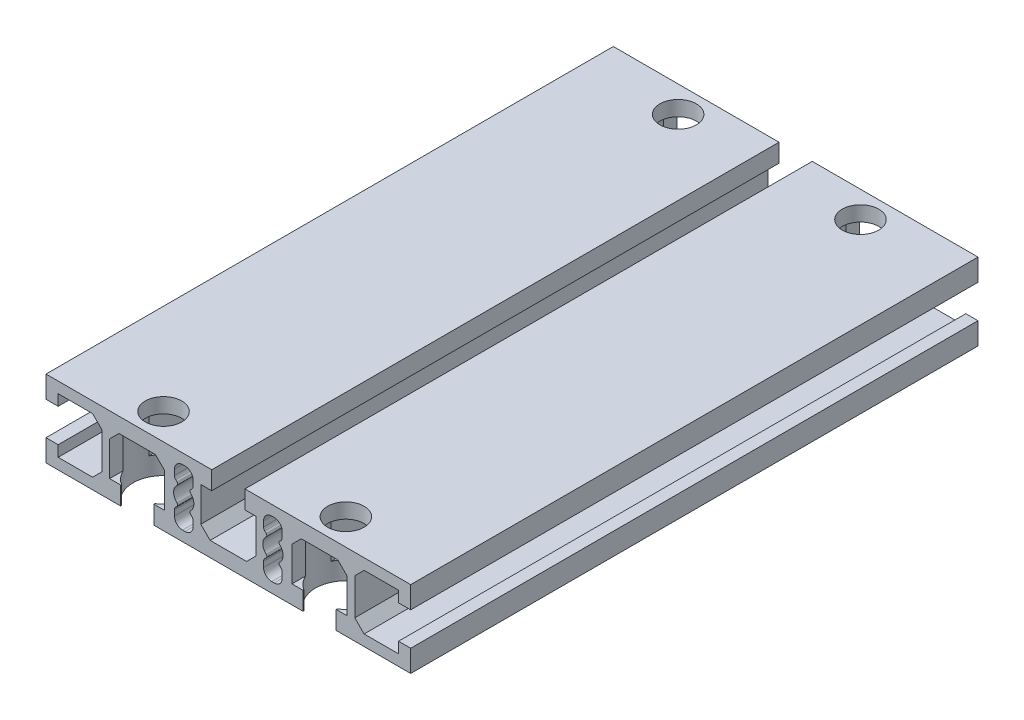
ISO-10303-21;
HEADER;
FILE_DESCRIPTION(('STEP AP214'),'2;1');
FILE_NAME('part.step','',(''),(''),'','','');
FILE_SCHEMA(('AUTOMOTIVE_DESIGN { 1 0 10303 214 1 1 1 1 }'));
ENDSEC;
DATA;
#1=APPLICATION_CONTEXT('core data for automotive mechanical design processes');
#2=APPLICATION_PROTOCOL_DEFINITION('international standard','automotive_design',2000,#1);
#3=PRODUCT_CONTEXT('',#1,'mechanical');
#4=PRODUCT('Part','Part','',(#3));
#5=PRODUCT_RELATED_PRODUCT_CATEGORY('part','',(#4));
#6=PRODUCT_DEFINITION_FORMATION('','',#4);
#7=PRODUCT_DEFINITION_CONTEXT('part definition',#1,'design');
#8=PRODUCT_DEFINITION('design','',#6,#7);
#9=PRODUCT_DEFINITION_SHAPE('','',#8);
#10=(LENGTH_UNIT() NAMED_UNIT(*) SI_UNIT(.MILLI.,.METRE.));
#11=(NAMED_UNIT(*) PLANE_ANGLE_UNIT() SI_UNIT($,.RADIAN.));
#12=(NAMED_UNIT(*) SI_UNIT($,.STERADIAN.) SOLID_ANGLE_UNIT());
#13=UNCERTAINTY_MEASURE_WITH_UNIT(LENGTH_MEASURE(1.E-05),#10,'distance_accuracy_value','');
#14=(GEOMETRIC_REPRESENTATION_CONTEXT(3) GLOBAL_UNCERTAINTY_ASSIGNED_CONTEXT((#13)) GLOBAL_UNIT_ASSIGNED_CONTEXT((#10,
#11,#12)) REPRESENTATION_CONTEXT('',''));
#15=CARTESIAN_POINT('',(0.,0.,0.));
#16=DIRECTION('',(0.,0.,1.));
#17=DIRECTION('',(1.,0.,0.));
#18=AXIS2_PLACEMENT_3D('',#15,#16,#17);
#19=CARTESIAN_POINT('',(-15.6999999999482,-5.,-70.));
#20=DIRECTION('',(0.,1.,0.));
#21=DIRECTION('',(0.,0.,1.));
#22=AXIS2_PLACEMENT_3D('',#19,#20,#21);
#23=PLANE('',#22);
#24=CARTESIAN_POINT('',(-22.5,-5.,63.5));
#25=DIRECTION('',(0.,1.,0.));
#26=DIRECTION('',(0.,0.,1.));
#27=AXIS2_PLACEMENT_3D('',#24,#25,#26);
#28=CIRCLE('',#27,7.5);
#29=CARTESIAN_POINT('',(-18.3999999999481,-5.,69.7801273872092));
#30=VERTEX_POINT('',#29);
#31=CARTESIAN_POINT('',(-15.6999999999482,-5.,66.6638584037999));
#32=VERTEX_POINT('',#31);
#33=EDGE_CURVE('E3159',#30,#32,#28,.T.);
#34=ORIENTED_EDGE('',*,*,#33,.F.);
#35=DIRECTION('',(0.,0.,1.));
#36=VECTOR('',#35,1.);
#37=CARTESIAN_POINT('',(-18.3999999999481,-5.,-70.));
#38=LINE('',#37,#36);
#39=CARTESIAN_POINT('',(-18.3999999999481,-5.,70.));
#40=VERTEX_POINT('',#39);
#41=EDGE_CURVE('E2044',#30,#40,#38,.T.);
#42=ORIENTED_EDGE('',*,*,#41,.T.);
#43=DIRECTION('',(-1.,0.,0.));
#44=VECTOR('',#43,1.);
#45=CARTESIAN_POINT('',(-15.6999999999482,-5.,70.));
#46=LINE('',#45,#44);
#47=CARTESIAN_POINT('',(-15.6999999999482,-5.,70.));
#48=VERTEX_POINT('',#47);
#49=EDGE_CURVE('E2079',#48,#40,#46,.T.);
#50=ORIENTED_EDGE('',*,*,#49,.F.);
#51=DIRECTION('',(0.,0.,1.));
#52=VECTOR('',#51,1.);
#53=CARTESIAN_POINT('',(-15.6999999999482,-5.,-70.));
#54=LINE('',#53,#52);
#55=EDGE_CURVE('E2048',#32,#48,#54,.T.);
#56=ORIENTED_EDGE('',*,*,#55,.F.);
#57=EDGE_LOOP('',(#34,#42,#50,#56));
#58=FACE_BOUND('',#57,.T.);
#59=ADVANCED_FACE('F969',(#58),#23,.T.);
#60=CARTESIAN_POINT('',(-17.9999999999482,5.8,-70.));
#61=DIRECTION('',(-0.707106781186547,-0.707106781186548,0.));
#62=DIRECTION('',(0.707106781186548,-0.707106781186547,0.));
#63=AXIS2_PLACEMENT_3D('',#60,#61,#62);
#64=PLANE('',#63);
#65=CARTESIAN_POINT('',(-22.5,10.3000000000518,63.5));
#66=DIRECTION('',(-0.707106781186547,-0.707106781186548,0.));
#67=DIRECTION('',(0.707106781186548,-0.707106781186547,0.));
#68=AXIS2_PLACEMENT_3D('',#65,#66,#67);
#69=ELLIPSE('',#68,10.6066017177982,7.5);
#70=CARTESIAN_POINT('',(-15.6999999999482,3.5,66.6638584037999));
#71=VERTEX_POINT('',#70);
#72=CARTESIAN_POINT('',(-17.9999999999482,5.79999999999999,69.4999999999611));
#73=VERTEX_POINT('',#72);
#74=EDGE_CURVE('E1846',#71,#73,#69,.T.);
#75=ORIENTED_EDGE('',*,*,#74,.F.);
#76=DIRECTION('',(0.,0.,1.));
#77=VECTOR('',#76,1.);
#78=CARTESIAN_POINT('',(-15.6999999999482,3.5,-70.));
#79=LINE('',#78,#77);
#80=CARTESIAN_POINT('',(-15.6999999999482,3.5,70.));
#81=VERTEX_POINT('',#80);
#82=EDGE_CURVE('E1873',#71,#81,#79,.T.);
#83=ORIENTED_EDGE('',*,*,#82,.T.);
#84=DIRECTION('',(0.707106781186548,-0.707106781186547,0.));
#85=VECTOR('',#84,1.);
#86=CARTESIAN_POINT('',(-17.9999999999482,5.8,70.));
#87=LINE('',#86,#85);
#88=CARTESIAN_POINT('',(-17.9999999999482,5.8,70.));
#89=VERTEX_POINT('',#88);
#90=EDGE_CURVE('E2067',#89,#81,#87,.T.);
#91=ORIENTED_EDGE('',*,*,#90,.F.);
#92=DIRECTION('',(0.,0.,1.));
#93=VECTOR('',#92,1.);
#94=CARTESIAN_POINT('',(-17.9999999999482,5.8,-70.));
#95=LINE('',#94,#93);
#96=EDGE_CURVE('E1871',#73,#89,#95,.T.);
#97=ORIENTED_EDGE('',*,*,#96,.F.);
#98=EDGE_LOOP('',(#75,#83,#91,#97));
#99=FACE_BOUND('',#98,.T.);
#100=ADVANCED_FACE('F2066',(#99),#64,.T.);
#101=CARTESIAN_POINT('',(-29.2999999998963,-5.00000000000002,-70.));
#102=DIRECTION('',(1.,0.,0.));
#103=DIRECTION('',(0.,0.,-1.));
#104=AXIS2_PLACEMENT_3D('',#101,#102,#103);
#105=PLANE('',#104);
#106=DIRECTION('',(0.,-1.,0.));
#107=VECTOR('',#106,1.);
#108=CARTESIAN_POINT('',(-29.2999999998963,-9.50000000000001,66.663858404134));
#109=LINE('',#108,#107);
#110=CARTESIAN_POINT('',(-29.2999999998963,3.50000000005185,66.663858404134));
#111=VERTEX_POINT('',#110);
#112=CARTESIAN_POINT('',(-29.2999999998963,-5.00000000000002,66.663858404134));
#113=VERTEX_POINT('',#112);
#114=EDGE_CURVE('E3141',#111,#113,#109,.T.);
#115=ORIENTED_EDGE('',*,*,#114,.F.);
#116=DIRECTION('',(0.,0.,1.));
#117=VECTOR('',#116,1.);
#118=CARTESIAN_POINT('',(-29.2999999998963,3.50000000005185,-70.));
#119=LINE('',#118,#117);
#120=CARTESIAN_POINT('',(-29.2999999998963,3.50000000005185,70.));
#121=VERTEX_POINT('',#120);
#122=EDGE_CURVE('E1887',#111,#121,#119,.T.);
#123=ORIENTED_EDGE('',*,*,#122,.T.);
#124=DIRECTION('',(0.,1.,0.));
#125=VECTOR('',#124,1.);
#126=CARTESIAN_POINT('',(-29.2999999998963,-5.00000000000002,70.));
#127=LINE('',#126,#125);
#128=CARTESIAN_POINT('',(-29.2999999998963,-5.00000000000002,70.));
#129=VERTEX_POINT('',#128);
#130=EDGE_CURVE('E2973',#129,#121,#127,.T.);
#131=ORIENTED_EDGE('',*,*,#130,.F.);
#132=DIRECTION('',(0.,0.,1.));
#133=VECTOR('',#132,1.);
#134=CARTESIAN_POINT('',(-29.2999999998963,-5.00000000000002,-70.));
#135=LINE('',#134,#133);
#136=EDGE_CURVE('E1892',#113,#129,#135,.T.);
#137=ORIENTED_EDGE('',*,*,#136,.F.);
#138=EDGE_LOOP('',(#115,#123,#131,#137));
#139=FACE_BOUND('',#138,.T.);
#140=ADVANCED_FACE('F3092',(#139),#105,.T.);
#141=CARTESIAN_POINT('',(-26.6,-5.00000000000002,-70.));
#142=DIRECTION('',(0.,1.,0.));
#143=DIRECTION('',(-1.,0.,0.));
#144=AXIS2_PLACEMENT_3D('',#141,#142,#143);
#145=PLANE('',#144);
#146=CARTESIAN_POINT('',(-22.5,-5.00000000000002,63.5));
#147=DIRECTION('',(0.,1.,0.));
#148=DIRECTION('',(-1.,0.,0.));
#149=AXIS2_PLACEMENT_3D('',#146,#147,#148);
#150=CIRCLE('',#149,7.5);
#151=CARTESIAN_POINT('',(-26.6,-5.00000000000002,69.780127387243));
#152=VERTEX_POINT('',#151);
#153=EDGE_CURVE('E3143',#113,#152,#150,.T.);
#154=ORIENTED_EDGE('',*,*,#153,.F.);
#155=ORIENTED_EDGE('',*,*,#136,.T.);
#156=DIRECTION('',(-1.,0.,0.));
#157=VECTOR('',#156,1.);
#158=CARTESIAN_POINT('',(-26.6,-5.00000000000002,70.));
#159=LINE('',#158,#157);
#160=CARTESIAN_POINT('',(-26.6,-5.00000000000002,70.));
#161=VERTEX_POINT('',#160);
#162=EDGE_CURVE('E2970',#161,#129,#159,.T.);
#163=ORIENTED_EDGE('',*,*,#162,.F.);
#164=DIRECTION('',(0.,0.,1.));
#165=VECTOR('',#164,1.);
#166=CARTESIAN_POINT('',(-26.6,-5.00000000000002,-70.));
#167=LINE('',#166,#165);
#168=EDGE_CURVE('E1897',#152,#161,#167,.T.);
#169=ORIENTED_EDGE('',*,*,#168,.F.);
#170=EDGE_LOOP('',(#154,#155,#163,#169));
#171=FACE_BOUND('',#170,.T.);
#172=ADVANCED_FACE('F3193',(#171),#145,.T.);
#173=CARTESIAN_POINT('',(-26.6,-9.50000000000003,-70.));
#174=DIRECTION('',(1.,0.,0.));
#175=DIRECTION('',(0.,0.,-1.));
#176=AXIS2_PLACEMENT_3D('',#173,#174,#175);
#177=PLANE('',#176);
#178=DIRECTION('',(0.,-1.,0.));
#179=VECTOR('',#178,1.);
#180=CARTESIAN_POINT('',(-26.6,-9.50000000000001,69.780127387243));
#181=LINE('',#180,#179);
#182=CARTESIAN_POINT('',(-26.6,-9.50000000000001,69.780127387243));
#183=VERTEX_POINT('',#182);
#184=EDGE_CURVE('E3148',#152,#183,#181,.T.);
#185=ORIENTED_EDGE('',*,*,#184,.F.);
#186=ORIENTED_EDGE('',*,*,#168,.T.);
#187=DIRECTION('',(0.,1.,0.));
#188=VECTOR('',#187,1.);
#189=CARTESIAN_POINT('',(-26.6,-9.50000000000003,70.));
#190=LINE('',#189,#188);
#191=CARTESIAN_POINT('',(-26.6,-9.50000000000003,70.));
#192=VERTEX_POINT('',#191);
#193=EDGE_CURVE('E2967',#192,#161,#190,.T.);
#194=ORIENTED_EDGE('',*,*,#193,.F.);
#195=DIRECTION('',(0.,0.,1.));
#196=VECTOR('',#195,1.);
#197=CARTESIAN_POINT('',(-26.6,-9.50000000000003,-70.));
#198=LINE('',#197,#196);
#199=EDGE_CURVE('E1902',#183,#192,#198,.T.);
#200=ORIENTED_EDGE('',*,*,#199,.F.);
#201=EDGE_LOOP('',(#185,#186,#194,#200));
#202=FACE_BOUND('',#201,.T.);
#203=ADVANCED_FACE('F3116',(#202),#177,.T.);
#204=CARTESIAN_POINT('',(-18.3999999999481,-5.,-70.));
#205=DIRECTION('',(-1.,0.,0.));
#206=DIRECTION('',(0.,0.,1.));
#207=AXIS2_PLACEMENT_3D('',#204,#205,#206);
#208=PLANE('',#207);
#209=DIRECTION('',(0.,-1.,0.));
#210=VECTOR('',#209,1.);
#211=CARTESIAN_POINT('',(-18.3999999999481,-9.50000000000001,57.2198726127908));
#212=LINE('',#211,#210);
#213=CARTESIAN_POINT('',(-18.3999999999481,-5.,57.2198726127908));
#214=VERTEX_POINT('',#213);
#215=CARTESIAN_POINT('',(-18.3999999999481,-9.50000000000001,57.2198726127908));
#216=VERTEX_POINT('',#215);
#217=EDGE_CURVE('E3164',#214,#216,#212,.T.);
#218=ORIENTED_EDGE('',*,*,#217,.F.);
#219=CARTESIAN_POINT('',(-18.3999999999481,-5.,-57.2198726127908));
#220=VERTEX_POINT('',#219);
#221=EDGE_CURVE('E2043',#220,#214,#38,.T.);
#222=ORIENTED_EDGE('',*,*,#221,.F.);
#223=DIRECTION('',(0.,-1.,0.));
#224=VECTOR('',#223,1.);
#225=CARTESIAN_POINT('',(-18.3999999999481,-9.50000000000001,-57.2198726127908));
#226=LINE('',#225,#224);
#227=CARTESIAN_POINT('',(-18.3999999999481,-9.50000000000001,-57.2198726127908));
#228=VERTEX_POINT('',#227);
#229=EDGE_CURVE('E2695',#228,#220,#226,.F.);
#230=ORIENTED_EDGE('',*,*,#229,.F.);
#231=DIRECTION('',(0.,0.,1.));
#232=VECTOR('',#231,1.);
#233=CARTESIAN_POINT('',(-18.3999999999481,-9.50000000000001,-70.));
#234=LINE('',#233,#232);
#235=EDGE_CURVE('E2039',#228,#216,#234,.T.);
#236=ORIENTED_EDGE('',*,*,#235,.T.);
#237=EDGE_LOOP('',(#218,#222,#230,#236));
#238=FACE_BOUND('',#237,.T.);
#239=ADVANCED_FACE('F3109',(#238),#208,.T.);
#240=CARTESIAN_POINT('',(-15.6999999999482,3.5,-70.));
#241=DIRECTION('',(-1.,0.,0.));
#242=DIRECTION('',(0.,0.,1.));
#243=AXIS2_PLACEMENT_3D('',#240,#241,#242);
#244=PLANE('',#243);
#245=DIRECTION('',(0.,-1.,0.));
#246=VECTOR('',#245,1.);
#247=CARTESIAN_POINT('',(-15.6999999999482,-9.50000000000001,60.3361415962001));
#248=LINE('',#247,#246);
#249=CARTESIAN_POINT('',(-15.6999999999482,3.5,60.3361415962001));
#250=VERTEX_POINT('',#249);
#251=CARTESIAN_POINT('',(-15.6999999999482,-5.,60.3361415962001));
#252=VERTEX_POINT('',#251);
#253=EDGE_CURVE('E1863',#250,#252,#248,.T.);
#254=ORIENTED_EDGE('',*,*,#253,.F.);
#255=CARTESIAN_POINT('',(-15.6999999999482,3.5,-60.3361415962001));
#256=VERTEX_POINT('',#255);
#257=EDGE_CURVE('E1861',#256,#250,#79,.T.);
#258=ORIENTED_EDGE('',*,*,#257,.F.);
#259=DIRECTION('',(0.,-1.,0.));
#260=VECTOR('',#259,1.);
#261=CARTESIAN_POINT('',(-15.6999999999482,-9.50000000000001,-60.3361415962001));
#262=LINE('',#261,#260);
#263=CARTESIAN_POINT('',(-15.6999999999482,-5.,-60.3361415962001));
#264=VERTEX_POINT('',#263);
#265=EDGE_CURVE('E2696',#264,#256,#262,.F.);
#266=ORIENTED_EDGE('',*,*,#265,.F.);
#267=EDGE_CURVE('E2047',#264,#252,#54,.T.);
#268=ORIENTED_EDGE('',*,*,#267,.T.);
#269=EDGE_LOOP('',(#254,#258,#266,#268));
#270=FACE_BOUND('',#269,.T.);
#271=ADVANCED_FACE('F3107',(#270),#244,.T.);
#272=CARTESIAN_POINT('',(-29.2999999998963,3.50000000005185,-70.));
#273=DIRECTION('',(0.707106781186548,-0.707106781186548,0.));
#274=DIRECTION('',(0.707106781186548,0.707106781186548,0.));
#275=AXIS2_PLACEMENT_3D('',#272,#273,#274);
#276=PLANE('',#275);
#277=CARTESIAN_POINT('',(-22.5,10.2999999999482,63.5));
#278=DIRECTION('',(0.707106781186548,-0.707106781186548,0.));
#279=DIRECTION('',(-0.707106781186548,-0.707106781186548,0.));
#280=AXIS2_PLACEMENT_3D('',#277,#278,#279);
#281=ELLIPSE('',#280,10.6066017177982,7.5);
#282=CARTESIAN_POINT('',(-29.2999999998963,3.50000000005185,60.3361415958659));
#283=VERTEX_POINT('',#282);
#284=CARTESIAN_POINT('',(-26.9999999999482,5.79999999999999,57.4999999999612));
#285=VERTEX_POINT('',#284);
#286=EDGE_CURVE('E2991',#283,#285,#281,.T.);
#287=ORIENTED_EDGE('',*,*,#286,.F.);
#288=CARTESIAN_POINT('',(-29.2999999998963,3.50000000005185,-60.336141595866));
#289=VERTEX_POINT('',#288);
#290=EDGE_CURVE('E1886',#289,#283,#119,.T.);
#291=ORIENTED_EDGE('',*,*,#290,.F.);
#292=CARTESIAN_POINT('',(-22.5,10.2999999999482,-63.5));
#293=DIRECTION('',(0.707106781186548,-0.707106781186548,0.));
#294=DIRECTION('',(-0.707106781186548,-0.707106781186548,0.));
#295=AXIS2_PLACEMENT_3D('',#292,#293,#294);
#296=ELLIPSE('',#295,10.6066017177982,7.5);
#297=CARTESIAN_POINT('',(-26.9999999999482,5.79999999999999,-57.4999999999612));
#298=VERTEX_POINT('',#297);
#299=EDGE_CURVE('E2993',#298,#289,#296,.T.);
#300=ORIENTED_EDGE('',*,*,#299,.F.);
#301=DIRECTION('',(0.,0.,1.));
#302=VECTOR('',#301,1.);
#303=CARTESIAN_POINT('',(-26.9999999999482,5.8,-70.));
#304=LINE('',#303,#302);
#305=EDGE_CURVE('E1881',#298,#285,#304,.T.);
#306=ORIENTED_EDGE('',*,*,#305,.T.);
#307=EDGE_LOOP('',(#287,#291,#300,#306));
#308=FACE_BOUND('',#307,.T.);
#309=ADVANCED_FACE('F2989',(#308),#276,.T.);
#310=DIRECTION('',(0.,-1.,0.));
#311=VECTOR('',#310,1.);
#312=CARTESIAN_POINT('',(-18.3999999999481,-9.50000000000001,-69.7801273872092));
#313=LINE('',#312,#311);
#314=CARTESIAN_POINT('',(-18.3999999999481,-5.,-69.7801273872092));
#315=VERTEX_POINT('',#314);
#316=CARTESIAN_POINT('',(-18.3999999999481,-9.50000000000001,-69.7801273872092));
#317=VERTEX_POINT('',#316);
#318=EDGE_CURVE('E2680',#315,#317,#313,.T.);
#319=ORIENTED_EDGE('',*,*,#318,.F.);
#320=CARTESIAN_POINT('',(-18.3999999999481,-5.,-70.));
#321=VERTEX_POINT('',#320);
#322=EDGE_CURVE('E2041',#321,#315,#38,.T.);
#323=ORIENTED_EDGE('',*,*,#322,.F.);
#324=DIRECTION('',(0.,-1.,0.));
#325=VECTOR('',#324,1.);
#326=CARTESIAN_POINT('',(-18.3999999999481,-5.,-70.));
#327=LINE('',#326,#325);
#328=CARTESIAN_POINT('',(-18.3999999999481,-9.50000000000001,-70.));
#329=VERTEX_POINT('',#328);
#330=EDGE_CURVE('E2454',#321,#329,#327,.T.);
#331=ORIENTED_EDGE('',*,*,#330,.T.);
#332=EDGE_CURVE('E2036',#329,#317,#234,.T.);
#333=ORIENTED_EDGE('',*,*,#332,.T.);
#334=EDGE_LOOP('',(#319,#323,#331,#333));
#335=FACE_BOUND('',#334,.T.);
#336=ADVANCED_FACE('F2679',(#335),#208,.T.);
#337=EDGE_CURVE('E1862',#252,#214,#28,.T.);
#338=ORIENTED_EDGE('',*,*,#337,.F.);
#339=ORIENTED_EDGE('',*,*,#267,.F.);
#340=CARTESIAN_POINT('',(-22.5,-5.,-63.5));
#341=DIRECTION('',(0.,1.,0.));
#342=DIRECTION('',(0.,0.,1.));
#343=AXIS2_PLACEMENT_3D('',#340,#341,#342);
#344=CIRCLE('',#343,7.5);
#345=EDGE_CURVE('E2690',#220,#264,#344,.T.);
#346=ORIENTED_EDGE('',*,*,#345,.F.);
#347=ORIENTED_EDGE('',*,*,#221,.T.);
#348=EDGE_LOOP('',(#338,#339,#346,#347));
#349=FACE_BOUND('',#348,.T.);
#350=ADVANCED_FACE('F3088',(#349),#23,.T.);
#351=DIRECTION('',(0.,-1.,0.));
#352=VECTOR('',#351,1.);
#353=CARTESIAN_POINT('',(-15.6999999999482,-9.50000000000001,-66.6638584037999));
#354=LINE('',#353,#352);
#355=CARTESIAN_POINT('',(-15.6999999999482,3.5,-66.6638584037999));
#356=VERTEX_POINT('',#355);
#357=CARTESIAN_POINT('',(-15.6999999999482,-5.,-66.6638584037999));
#358=VERTEX_POINT('',#357);
#359=EDGE_CURVE('E2688',#356,#358,#354,.T.);
#360=ORIENTED_EDGE('',*,*,#359,.F.);
#361=CARTESIAN_POINT('',(-15.6999999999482,3.5,-70.));
#362=VERTEX_POINT('',#361);
#363=EDGE_CURVE('E1877',#362,#356,#79,.T.);
#364=ORIENTED_EDGE('',*,*,#363,.F.);
#365=DIRECTION('',(0.,-1.,0.));
#366=VECTOR('',#365,1.);
#367=CARTESIAN_POINT('',(-15.6999999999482,3.5,-70.));
#368=LINE('',#367,#366);
#369=CARTESIAN_POINT('',(-15.6999999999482,-5.,-70.));
#370=VERTEX_POINT('',#369);
#371=EDGE_CURVE('E2449',#362,#370,#368,.T.);
#372=ORIENTED_EDGE('',*,*,#371,.T.);
#373=EDGE_CURVE('E2045',#370,#358,#54,.T.);
#374=ORIENTED_EDGE('',*,*,#373,.T.);
#375=EDGE_LOOP('',(#360,#364,#372,#374));
#376=FACE_BOUND('',#375,.T.);
#377=ADVANCED_FACE('F3099',(#376),#244,.T.);
#378=CARTESIAN_POINT('',(-17.9999999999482,5.79999999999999,57.5000000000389));
#379=VERTEX_POINT('',#378);
#380=EDGE_CURVE('E1843',#379,#250,#69,.T.);
#381=ORIENTED_EDGE('',*,*,#380,.F.);
#382=CARTESIAN_POINT('',(-17.9999999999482,5.79999999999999,-57.5000000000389));
#383=VERTEX_POINT('',#382);
#384=EDGE_CURVE('E1859',#383,#379,#95,.T.);
#385=ORIENTED_EDGE('',*,*,#384,.F.);
#386=CARTESIAN_POINT('',(-22.5,10.3000000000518,-63.5));
#387=DIRECTION('',(-0.707106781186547,-0.707106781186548,0.));
#388=DIRECTION('',(0.707106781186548,-0.707106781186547,0.));
#389=AXIS2_PLACEMENT_3D('',#386,#387,#388);
#390=ELLIPSE('',#389,10.6066017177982,7.5);
#391=EDGE_CURVE('E2691',#256,#383,#390,.T.);
#392=ORIENTED_EDGE('',*,*,#391,.F.);
#393=ORIENTED_EDGE('',*,*,#257,.T.);
#394=EDGE_LOOP('',(#381,#385,#392,#393));
#395=FACE_BOUND('',#394,.T.);
#396=ADVANCED_FACE('F1857',(#395),#64,.T.);
#397=CARTESIAN_POINT('',(-29.2999999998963,3.50000000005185,-66.663858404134));
#398=VERTEX_POINT('',#397);
#399=CARTESIAN_POINT('',(-26.9999999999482,5.79999999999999,-69.5000000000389));
#400=VERTEX_POINT('',#399);
#401=EDGE_CURVE('E3001',#398,#400,#296,.T.);
#402=ORIENTED_EDGE('',*,*,#401,.F.);
#403=CARTESIAN_POINT('',(-29.2999999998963,3.50000000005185,-70.));
#404=VERTEX_POINT('',#403);
#405=EDGE_CURVE('E1883',#404,#398,#119,.T.);
#406=ORIENTED_EDGE('',*,*,#405,.F.);
#407=DIRECTION('',(0.707106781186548,0.707106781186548,0.));
#408=VECTOR('',#407,1.);
#409=CARTESIAN_POINT('',(-29.2999999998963,3.50000000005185,-70.));
#410=LINE('',#409,#408);
#411=CARTESIAN_POINT('',(-26.9999999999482,5.8,-70.));
#412=VERTEX_POINT('',#411);
#413=EDGE_CURVE('E2442',#404,#412,#410,.T.);
#414=ORIENTED_EDGE('',*,*,#413,.T.);
#415=EDGE_CURVE('E1874',#412,#400,#304,.T.);
#416=ORIENTED_EDGE('',*,*,#415,.T.);
#417=EDGE_LOOP('',(#402,#406,#414,#416));
#418=FACE_BOUND('',#417,.T.);
#419=ADVANCED_FACE('F3000',(#418),#276,.T.);
#420=DIRECTION('',(0.,-1.,0.));
#421=VECTOR('',#420,1.);
#422=CARTESIAN_POINT('',(-29.2999999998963,-9.50000000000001,60.336141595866));
#423=LINE('',#422,#421);
#424=CARTESIAN_POINT('',(-29.2999999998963,-5.00000000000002,60.336141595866));
#425=VERTEX_POINT('',#424);
#426=EDGE_CURVE('E3147',#425,#283,#423,.F.);
#427=ORIENTED_EDGE('',*,*,#426,.F.);
#428=CARTESIAN_POINT('',(-29.2999999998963,-5.00000000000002,-60.336141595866));
#429=VERTEX_POINT('',#428);
#430=EDGE_CURVE('E1891',#429,#425,#135,.T.);
#431=ORIENTED_EDGE('',*,*,#430,.F.);
#432=DIRECTION('',(0.,-1.,0.));
#433=VECTOR('',#432,1.);
#434=CARTESIAN_POINT('',(-29.2999999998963,-9.50000000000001,-60.336141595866));
#435=LINE('',#434,#433);
#436=EDGE_CURVE('E3179',#289,#429,#435,.T.);
#437=ORIENTED_EDGE('',*,*,#436,.F.);
#438=ORIENTED_EDGE('',*,*,#290,.T.);
#439=EDGE_LOOP('',(#427,#431,#437,#438));
#440=FACE_BOUND('',#439,.T.);
#441=ADVANCED_FACE('F3131',(#440),#105,.T.);
#442=CARTESIAN_POINT('',(-26.6,-5.00000000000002,57.219872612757));
#443=VERTEX_POINT('',#442);
#444=EDGE_CURVE('E3149',#443,#425,#150,.T.);
#445=ORIENTED_EDGE('',*,*,#444,.F.);
#446=CARTESIAN_POINT('',(-26.6,-5.00000000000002,-57.219872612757));
#447=VERTEX_POINT('',#446);
#448=EDGE_CURVE('E1896',#447,#443,#167,.T.);
#449=ORIENTED_EDGE('',*,*,#448,.F.);
#450=CARTESIAN_POINT('',(-22.5,-5.00000000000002,-63.5));
#451=DIRECTION('',(0.,1.,0.));
#452=DIRECTION('',(-1.,0.,0.));
#453=AXIS2_PLACEMENT_3D('',#450,#451,#452);
#454=CIRCLE('',#453,7.5);
#455=EDGE_CURVE('E3175',#429,#447,#454,.T.);
#456=ORIENTED_EDGE('',*,*,#455,.F.);
#457=ORIENTED_EDGE('',*,*,#430,.T.);
#458=EDGE_LOOP('',(#445,#449,#456,#457));
#459=FACE_BOUND('',#458,.T.);
#460=ADVANCED_FACE('F3204',(#459),#145,.T.);
#461=DIRECTION('',(0.,-1.,0.));
#462=VECTOR('',#461,1.);
#463=CARTESIAN_POINT('',(-26.6,-9.50000000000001,57.219872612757));
#464=LINE('',#463,#462);
#465=CARTESIAN_POINT('',(-26.6,-9.50000000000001,57.219872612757));
#466=VERTEX_POINT('',#465);
#467=EDGE_CURVE('E3155',#466,#443,#464,.F.);
#468=ORIENTED_EDGE('',*,*,#467,.F.);
#469=CARTESIAN_POINT('',(-26.6,-9.50000000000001,-57.219872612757));
#470=VERTEX_POINT('',#469);
#471=EDGE_CURVE('E1901',#470,#466,#198,.T.);
#472=ORIENTED_EDGE('',*,*,#471,.F.);
#473=DIRECTION('',(0.,-1.,0.));
#474=VECTOR('',#473,1.);
#475=CARTESIAN_POINT('',(-26.6,-9.50000000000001,-57.219872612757));
#476=LINE('',#475,#474);
#477=EDGE_CURVE('E986',#447,#470,#476,.T.);
#478=ORIENTED_EDGE('',*,*,#477,.F.);
#479=ORIENTED_EDGE('',*,*,#448,.T.);
#480=EDGE_LOOP('',(#468,#472,#478,#479));
#481=FACE_BOUND('',#480,.T.);
#482=ADVANCED_FACE('F3201',(#481),#177,.T.);
#483=CARTESIAN_POINT('',(26.6000000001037,-4.99999999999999,-70.));
#484=DIRECTION('',(-1.,0.,0.));
#485=DIRECTION('',(0.,0.,1.));
#486=AXIS2_PLACEMENT_3D('',#483,#484,#485);
#487=PLANE('',#486);
#488=DIRECTION('',(0.,-1.,0.));
#489=VECTOR('',#488,1.);
#490=CARTESIAN_POINT('',(26.6000000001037,-9.50000000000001,-69.780127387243));
#491=LINE('',#490,#489);
#492=CARTESIAN_POINT('',(26.6000000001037,-4.99999999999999,-69.780127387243));
#493=VERTEX_POINT('',#492);
#494=CARTESIAN_POINT('',(26.6000000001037,-9.50000000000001,-69.780127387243));
#495=VERTEX_POINT('',#494);
#496=EDGE_CURVE('E2630',#493,#495,#491,.T.);
#497=ORIENTED_EDGE('',*,*,#496,.F.);
#498=DIRECTION('',(0.,0.,1.));
#499=VECTOR('',#498,1.);
#500=CARTESIAN_POINT('',(26.6000000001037,-4.99999999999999,-70.));
#501=LINE('',#500,#499);
#502=CARTESIAN_POINT('',(26.6000000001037,-4.99999999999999,-70.));
#503=VERTEX_POINT('',#502);
#504=EDGE_CURVE('E1991',#503,#493,#501,.T.);
#505=ORIENTED_EDGE('',*,*,#504,.F.);
#506=DIRECTION('',(0.,-1.,0.));
#507=VECTOR('',#506,1.);
#508=CARTESIAN_POINT('',(26.6000000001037,-4.99999999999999,-70.));
#509=LINE('',#508,#507);
#510=CARTESIAN_POINT('',(26.6000000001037,-9.49999999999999,-70.));
#511=VERTEX_POINT('',#510);
#512=EDGE_CURVE('E2483',#503,#511,#509,.T.);
#513=ORIENTED_EDGE('',*,*,#512,.T.);
#514=DIRECTION('',(0.,0.,1.));
#515=VECTOR('',#514,1.);
#516=CARTESIAN_POINT('',(26.6000000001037,-9.49999999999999,-70.));
#517=LINE('',#516,#515);
#518=EDGE_CURVE('E1986',#511,#495,#517,.T.);
#519=ORIENTED_EDGE('',*,*,#518,.T.);
#520=EDGE_LOOP('',(#497,#505,#513,#519));
#521=FACE_BOUND('',#520,.T.);
#522=ADVANCED_FACE('F2629',(#521),#487,.T.);
#523=CARTESIAN_POINT('',(29.3000000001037,3.50000000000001,-70.));
#524=DIRECTION('',(-1.,0.,0.));
#525=DIRECTION('',(0.,0.,1.));
#526=AXIS2_PLACEMENT_3D('',#523,#524,#525);
#527=PLANE('',#526);
#528=DIRECTION('',(0.,-1.,0.));
#529=VECTOR('',#528,1.);
#530=CARTESIAN_POINT('',(29.3000000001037,-9.50000000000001,-66.6638584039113));
#531=LINE('',#530,#529);
#532=CARTESIAN_POINT('',(29.3000000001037,3.50000000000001,-66.6638584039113));
#533=VERTEX_POINT('',#532);
#534=CARTESIAN_POINT('',(29.3000000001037,-4.99999999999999,-66.6638584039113));
#535=VERTEX_POINT('',#534);
#536=EDGE_CURVE('E2640',#533,#535,#531,.T.);
#537=ORIENTED_EDGE('',*,*,#536,.F.);
#538=DIRECTION('',(0.,0.,1.));
#539=VECTOR('',#538,1.);
#540=CARTESIAN_POINT('',(29.3000000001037,3.50000000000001,-70.));
#541=LINE('',#540,#539);
#542=CARTESIAN_POINT('',(29.3000000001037,3.50000000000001,-70.));
#543=VERTEX_POINT('',#542);
#544=EDGE_CURVE('E2001',#543,#533,#541,.T.);
#545=ORIENTED_EDGE('',*,*,#544,.F.);
#546=DIRECTION('',(0.,-1.,0.));
#547=VECTOR('',#546,1.);
#548=CARTESIAN_POINT('',(29.3000000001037,3.50000000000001,-70.));
#549=LINE('',#548,#547);
#550=CARTESIAN_POINT('',(29.3000000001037,-4.99999999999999,-70.));
#551=VERTEX_POINT('',#550);
#552=EDGE_CURVE('E2477',#543,#551,#549,.T.);
#553=ORIENTED_EDGE('',*,*,#552,.T.);
#554=DIRECTION('',(0.,0.,1.));
#555=VECTOR('',#554,1.);
#556=CARTESIAN_POINT('',(29.3000000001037,-4.99999999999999,-70.));
#557=LINE('',#556,#555);
#558=EDGE_CURVE('E1996',#551,#535,#557,.T.);
#559=ORIENTED_EDGE('',*,*,#558,.T.);
#560=EDGE_LOOP('',(#537,#545,#553,#559));
#561=FACE_BOUND('',#560,.T.);
#562=ADVANCED_FACE('F2639',(#561),#527,.T.);
#563=CARTESIAN_POINT('',(15.7000000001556,3.50000000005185,-70.));
#564=DIRECTION('',(0.707106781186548,-0.707106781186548,0.));
#565=DIRECTION('',(0.707106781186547,0.707106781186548,0.));
#566=AXIS2_PLACEMENT_3D('',#563,#564,#565);
#567=PLANE('',#566);
#568=CARTESIAN_POINT('',(22.5000000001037,10.3,-63.5));
#569=DIRECTION('',(0.707106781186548,-0.707106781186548,0.));
#570=DIRECTION('',(-0.707106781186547,-0.707106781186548,0.));
#571=AXIS2_PLACEMENT_3D('',#568,#569,#570);
#572=ELLIPSE('',#571,10.6066017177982,7.49999999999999);
#573=CARTESIAN_POINT('',(15.7000000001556,3.50000000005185,-66.6638584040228));
#574=VERTEX_POINT('',#573);
#575=CARTESIAN_POINT('',(18.0000000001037,5.79999999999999,-69.5));
#576=VERTEX_POINT('',#575);
#577=EDGE_CURVE('E2653',#574,#576,#572,.T.);
#578=ORIENTED_EDGE('',*,*,#577,.F.);
#579=DIRECTION('',(0.,0.,1.));
#580=VECTOR('',#579,1.);
#581=CARTESIAN_POINT('',(15.7000000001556,3.50000000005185,-70.));
#582=LINE('',#581,#580);
#583=CARTESIAN_POINT('',(15.7000000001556,3.50000000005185,-70.));
#584=VERTEX_POINT('',#583);
#585=EDGE_CURVE('E2016',#584,#574,#582,.T.);
#586=ORIENTED_EDGE('',*,*,#585,.F.);
#587=DIRECTION('',(0.707106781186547,0.707106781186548,0.));
#588=VECTOR('',#587,1.);
#589=CARTESIAN_POINT('',(15.7000000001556,3.50000000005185,-70.));
#590=LINE('',#589,#588);
#591=CARTESIAN_POINT('',(18.0000000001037,5.79999999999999,-70.));
#592=VERTEX_POINT('',#591);
#593=EDGE_CURVE('E2469',#584,#592,#590,.T.);
#594=ORIENTED_EDGE('',*,*,#593,.T.);
#595=DIRECTION('',(0.,0.,1.));
#596=VECTOR('',#595,1.);
#597=CARTESIAN_POINT('',(18.0000000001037,5.79999999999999,-70.));
#598=LINE('',#597,#596);
#599=EDGE_CURVE('E2011',#592,#576,#598,.T.);
#600=ORIENTED_EDGE('',*,*,#599,.T.);
#601=EDGE_LOOP('',(#578,#586,#594,#600));
#602=FACE_BOUND('',#601,.T.);
#603=ADVANCED_FACE('F2652',(#602),#567,.T.);
#604=CARTESIAN_POINT('',(18.4000000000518,-5.,-70.));
#605=DIRECTION('',(0.,1.,0.));
#606=DIRECTION('',(0.,0.,1.));
#607=AXIS2_PLACEMENT_3D('',#604,#605,#606);
#608=PLANE('',#607);
#609=CARTESIAN_POINT('',(22.5000000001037,-5.,-63.5));
#610=DIRECTION('',(0.,1.,0.));
#611=DIRECTION('',(0.,0.,1.));
#612=AXIS2_PLACEMENT_3D('',#609,#610,#611);
#613=CIRCLE('',#612,7.49999999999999);
#614=CARTESIAN_POINT('',(18.4000000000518,-5.,-69.7801273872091));
#615=VERTEX_POINT('',#614);
#616=CARTESIAN_POINT('',(15.7000000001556,-5.,-66.6638584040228));
#617=VERTEX_POINT('',#616);
#618=EDGE_CURVE('E2663',#615,#617,#613,.T.);
#619=ORIENTED_EDGE('',*,*,#618,.F.);
#620=DIRECTION('',(0.,0.,1.));
#621=VECTOR('',#620,1.);
#622=CARTESIAN_POINT('',(18.4000000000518,-5.,-70.));
#623=LINE('',#622,#621);
#624=CARTESIAN_POINT('',(18.4000000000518,-5.,-70.));
#625=VERTEX_POINT('',#624);
#626=EDGE_CURVE('E2026',#625,#615,#623,.T.);
#627=ORIENTED_EDGE('',*,*,#626,.F.);
#628=DIRECTION('',(-1.,0.,0.));
#629=VECTOR('',#628,1.);
#630=CARTESIAN_POINT('',(18.4000000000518,-5.,-70.));
#631=LINE('',#630,#629);
#632=CARTESIAN_POINT('',(15.7000000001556,-5.,-70.));
#633=VERTEX_POINT('',#632);
#634=EDGE_CURVE('E2463',#625,#633,#631,.T.);
#635=ORIENTED_EDGE('',*,*,#634,.T.);
#636=DIRECTION('',(0.,0.,1.));
#637=VECTOR('',#636,1.);
#638=CARTESIAN_POINT('',(15.7000000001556,-5.,-70.));
#639=LINE('',#638,#637);
#640=EDGE_CURVE('E2021',#633,#617,#639,.T.);
#641=ORIENTED_EDGE('',*,*,#640,.T.);
#642=EDGE_LOOP('',(#619,#627,#635,#641));
#643=FACE_BOUND('',#642,.T.);
#644=ADVANCED_FACE('F2662',(#643),#608,.T.);
#645=CARTESIAN_POINT('',(29.3000000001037,-4.99999999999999,-70.));
#646=DIRECTION('',(0.,1.,0.));
#647=DIRECTION('',(0.,0.,1.));
#648=AXIS2_PLACEMENT_3D('',#645,#646,#647);
#649=PLANE('',#648);
#650=CARTESIAN_POINT('',(22.5000000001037,-4.99999999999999,-63.5));
#651=DIRECTION('',(0.,1.,0.));
#652=DIRECTION('',(0.,0.,1.));
#653=AXIS2_PLACEMENT_3D('',#650,#651,#652);
#654=CIRCLE('',#653,7.49999999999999);
#655=CARTESIAN_POINT('',(26.6000000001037,-4.99999999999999,-57.219872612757));
#656=VERTEX_POINT('',#655);
#657=CARTESIAN_POINT('',(29.3000000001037,-4.99999999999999,-60.3361415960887));
#658=VERTEX_POINT('',#657);
#659=EDGE_CURVE('E2729',#656,#658,#654,.T.);
#660=ORIENTED_EDGE('',*,*,#659,.F.);
#661=CARTESIAN_POINT('',(26.6000000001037,-4.99999999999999,57.219872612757));
#662=VERTEX_POINT('',#661);
#663=EDGE_CURVE('E1994',#656,#662,#501,.T.);
#664=ORIENTED_EDGE('',*,*,#663,.T.);
#665=CARTESIAN_POINT('',(22.5000000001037,-4.99999999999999,63.5));
#666=DIRECTION('',(0.,1.,0.));
#667=DIRECTION('',(0.,0.,1.));
#668=AXIS2_PLACEMENT_3D('',#665,#666,#667);
#669=CIRCLE('',#668,7.49999999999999);
#670=CARTESIAN_POINT('',(29.3000000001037,-4.99999999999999,60.3361415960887));
#671=VERTEX_POINT('',#670);
#672=EDGE_CURVE('E2772',#671,#662,#669,.T.);
#673=ORIENTED_EDGE('',*,*,#672,.F.);
#674=EDGE_CURVE('E1999',#658,#671,#557,.T.);
#675=ORIENTED_EDGE('',*,*,#674,.F.);
#676=EDGE_LOOP('',(#660,#664,#673,#675));
#677=FACE_BOUND('',#676,.T.);
#678=ADVANCED_FACE('F3605',(#677),#649,.T.);
#679=CARTESIAN_POINT('',(27.0000000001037,5.79999999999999,-70.));
#680=DIRECTION('',(-0.707106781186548,-0.707106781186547,0.));
#681=DIRECTION('',(0.707106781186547,-0.707106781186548,0.));
#682=AXIS2_PLACEMENT_3D('',#679,#680,#681);
#683=PLANE('',#682);
#684=CARTESIAN_POINT('',(22.5000000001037,10.3,-63.5));
#685=DIRECTION('',(-0.707106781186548,-0.707106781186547,0.));
#686=DIRECTION('',(0.707106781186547,-0.707106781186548,0.));
#687=AXIS2_PLACEMENT_3D('',#684,#685,#686);
#688=ELLIPSE('',#687,10.6066017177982,7.49999999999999);
#689=CARTESIAN_POINT('',(29.3000000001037,3.50000000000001,-60.3361415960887));
#690=VERTEX_POINT('',#689);
#691=CARTESIAN_POINT('',(27.0000000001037,5.79999999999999,-57.5));
#692=VERTEX_POINT('',#691);
#693=EDGE_CURVE('E2726',#690,#692,#688,.T.);
#694=ORIENTED_EDGE('',*,*,#693,.F.);
#695=CARTESIAN_POINT('',(29.3000000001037,3.50000000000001,60.3361415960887));
#696=VERTEX_POINT('',#695);
#697=EDGE_CURVE('E2004',#690,#696,#541,.T.);
#698=ORIENTED_EDGE('',*,*,#697,.T.);
#699=CARTESIAN_POINT('',(22.5000000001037,10.3,63.5));
#700=DIRECTION('',(-0.707106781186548,-0.707106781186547,0.));
#701=DIRECTION('',(0.707106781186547,-0.707106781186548,0.));
#702=AXIS2_PLACEMENT_3D('',#699,#700,#701);
#703=ELLIPSE('',#702,10.6066017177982,7.49999999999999);
#704=CARTESIAN_POINT('',(27.0000000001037,5.79999999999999,57.5));
#705=VERTEX_POINT('',#704);
#706=EDGE_CURVE('E2765',#705,#696,#703,.T.);
#707=ORIENTED_EDGE('',*,*,#706,.F.);
#708=DIRECTION('',(0.,0.,1.));
#709=VECTOR('',#708,1.);
#710=CARTESIAN_POINT('',(27.0000000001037,5.79999999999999,-70.));
#711=LINE('',#710,#709);
#712=EDGE_CURVE('E2009',#692,#705,#711,.T.);
#713=ORIENTED_EDGE('',*,*,#712,.F.);
#714=EDGE_LOOP('',(#694,#698,#707,#713));
#715=FACE_BOUND('',#714,.T.);
#716=ADVANCED_FACE('F3541',(#715),#683,.T.);
#717=CARTESIAN_POINT('',(15.7000000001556,-5.,-70.));
#718=DIRECTION('',(1.,0.,0.));
#719=DIRECTION('',(0.,0.,-1.));
#720=AXIS2_PLACEMENT_3D('',#717,#718,#719);
#721=PLANE('',#720);
#722=DIRECTION('',(0.,-1.,0.));
#723=VECTOR('',#722,1.);
#724=CARTESIAN_POINT('',(15.7000000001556,-9.50000000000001,-60.3361415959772));
#725=LINE('',#724,#723);
#726=CARTESIAN_POINT('',(15.7000000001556,3.50000000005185,-60.3361415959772));
#727=VERTEX_POINT('',#726);
#728=CARTESIAN_POINT('',(15.7000000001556,-5.,-60.3361415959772));
#729=VERTEX_POINT('',#728);
#730=EDGE_CURVE('E2723',#727,#729,#725,.T.);
#731=ORIENTED_EDGE('',*,*,#730,.F.);
#732=CARTESIAN_POINT('',(15.7000000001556,3.50000000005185,60.3361415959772));
#733=VERTEX_POINT('',#732);
#734=EDGE_CURVE('E2019',#727,#733,#582,.T.);
#735=ORIENTED_EDGE('',*,*,#734,.T.);
#736=DIRECTION('',(0.,-1.,0.));
#737=VECTOR('',#736,1.);
#738=CARTESIAN_POINT('',(15.7000000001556,-9.50000000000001,60.3361415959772));
#739=LINE('',#738,#737);
#740=CARTESIAN_POINT('',(15.7000000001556,-5.,60.3361415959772));
#741=VERTEX_POINT('',#740);
#742=EDGE_CURVE('E2754',#741,#733,#739,.F.);
#743=ORIENTED_EDGE('',*,*,#742,.F.);
#744=EDGE_CURVE('E2024',#729,#741,#639,.T.);
#745=ORIENTED_EDGE('',*,*,#744,.F.);
#746=EDGE_LOOP('',(#731,#735,#743,#745));
#747=FACE_BOUND('',#746,.T.);
#748=ADVANCED_FACE('F3531',(#747),#721,.T.);
#749=CARTESIAN_POINT('',(18.4000000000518,-9.50000000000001,-70.));
#750=DIRECTION('',(1.,0.,0.));
#751=DIRECTION('',(0.,0.,-1.));
#752=AXIS2_PLACEMENT_3D('',#749,#750,#751);
#753=PLANE('',#752);
#754=DIRECTION('',(0.,-1.,0.));
#755=VECTOR('',#754,1.);
#756=CARTESIAN_POINT('',(18.4000000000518,-9.50000000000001,-57.2198726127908));
#757=LINE('',#756,#755);
#758=CARTESIAN_POINT('',(18.4000000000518,-5.,-57.2198726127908));
#759=VERTEX_POINT('',#758);
#760=CARTESIAN_POINT('',(18.4000000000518,-9.50000000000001,-57.2198726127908));
#761=VERTEX_POINT('',#760);
#762=EDGE_CURVE('E2720',#759,#761,#757,.T.);
#763=ORIENTED_EDGE('',*,*,#762,.F.);
#764=CARTESIAN_POINT('',(18.4000000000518,-5.,57.2198726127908));
#765=VERTEX_POINT('',#764);
#766=EDGE_CURVE('E2029',#759,#765,#623,.T.);
#767=ORIENTED_EDGE('',*,*,#766,.T.);
#768=DIRECTION('',(0.,-1.,0.));
#769=VECTOR('',#768,1.);
#770=CARTESIAN_POINT('',(18.4000000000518,-9.50000000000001,57.2198726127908));
#771=LINE('',#770,#769);
#772=CARTESIAN_POINT('',(18.4000000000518,-9.50000000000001,57.2198726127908));
#773=VERTEX_POINT('',#772);
#774=EDGE_CURVE('E2748',#773,#765,#771,.F.);
#775=ORIENTED_EDGE('',*,*,#774,.F.);
#776=DIRECTION('',(0.,0.,1.));
#777=VECTOR('',#776,1.);
#778=CARTESIAN_POINT('',(18.4000000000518,-9.50000000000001,-70.));
#779=LINE('',#778,#777);
#780=EDGE_CURVE('E2034',#761,#773,#779,.T.);
#781=ORIENTED_EDGE('',*,*,#780,.F.);
#782=EDGE_LOOP('',(#763,#767,#775,#781));
#783=FACE_BOUND('',#782,.T.);
#784=ADVANCED_FACE('F3458',(#783),#753,.T.);
#785=DIRECTION('',(0.,-1.,0.));
#786=VECTOR('',#785,1.);
#787=CARTESIAN_POINT('',(26.6000000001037,-9.50000000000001,-57.219872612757));
#788=LINE('',#787,#786);
#789=CARTESIAN_POINT('',(26.6000000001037,-9.50000000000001,-57.219872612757));
#790=VERTEX_POINT('',#789);
#791=EDGE_CURVE('E2733',#790,#656,#788,.F.);
#792=ORIENTED_EDGE('',*,*,#791,.F.);
#793=CARTESIAN_POINT('',(26.6000000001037,-9.50000000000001,57.219872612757));
#794=VERTEX_POINT('',#793);
#795=EDGE_CURVE('E1989',#790,#794,#517,.T.);
#796=ORIENTED_EDGE('',*,*,#795,.T.);
#797=DIRECTION('',(0.,-1.,0.));
#798=VECTOR('',#797,1.);
#799=CARTESIAN_POINT('',(26.6000000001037,-9.50000000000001,57.219872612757));
#800=LINE('',#799,#798);
#801=EDGE_CURVE('E2775',#662,#794,#800,.T.);
#802=ORIENTED_EDGE('',*,*,#801,.F.);
#803=ORIENTED_EDGE('',*,*,#663,.F.);
#804=EDGE_LOOP('',(#792,#796,#802,#803));
#805=FACE_BOUND('',#804,.T.);
#806=ADVANCED_FACE('F3530',(#805),#487,.T.);
#807=CARTESIAN_POINT('',(26.6000000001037,-4.99999999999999,69.780127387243));
#808=VERTEX_POINT('',#807);
#809=CARTESIAN_POINT('',(29.3000000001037,-4.99999999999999,66.6638584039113));
#810=VERTEX_POINT('',#809);
#811=EDGE_CURVE('E2776',#808,#810,#669,.T.);
#812=ORIENTED_EDGE('',*,*,#811,.F.);
#813=CARTESIAN_POINT('',(26.6000000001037,-4.99999999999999,70.));
#814=VERTEX_POINT('',#813);
#815=EDGE_CURVE('E1995',#808,#814,#501,.T.);
#816=ORIENTED_EDGE('',*,*,#815,.T.);
#817=DIRECTION('',(-1.,0.,0.));
#818=VECTOR('',#817,1.);
#819=CARTESIAN_POINT('',(29.3000000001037,-4.99999999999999,70.));
#820=LINE('',#819,#818);
#821=CARTESIAN_POINT('',(29.3000000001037,-4.99999999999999,70.));
#822=VERTEX_POINT('',#821);
#823=EDGE_CURVE('E2110',#822,#814,#820,.T.);
#824=ORIENTED_EDGE('',*,*,#823,.F.);
#825=EDGE_CURVE('E2000',#810,#822,#557,.T.);
#826=ORIENTED_EDGE('',*,*,#825,.F.);
#827=EDGE_LOOP('',(#812,#816,#824,#826));
#828=FACE_BOUND('',#827,.T.);
#829=ADVANCED_FACE('F3537',(#828),#649,.T.);
#830=DIRECTION('',(0.,-1.,0.));
#831=VECTOR('',#830,1.);
#832=CARTESIAN_POINT('',(29.3000000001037,-9.50000000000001,-60.3361415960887));
#833=LINE('',#832,#831);
#834=EDGE_CURVE('E2731',#658,#690,#833,.F.);
#835=ORIENTED_EDGE('',*,*,#834,.F.);
#836=ORIENTED_EDGE('',*,*,#674,.T.);
#837=DIRECTION('',(0.,-1.,0.));
#838=VECTOR('',#837,1.);
#839=CARTESIAN_POINT('',(29.3000000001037,-9.50000000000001,60.3361415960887));
#840=LINE('',#839,#838);
#841=EDGE_CURVE('E2768',#696,#671,#840,.T.);
#842=ORIENTED_EDGE('',*,*,#841,.F.);
#843=ORIENTED_EDGE('',*,*,#697,.F.);
#844=EDGE_LOOP('',(#835,#836,#842,#843));
#845=FACE_BOUND('',#844,.T.);
#846=ADVANCED_FACE('F3597',(#845),#527,.T.);
#847=CARTESIAN_POINT('',(29.3000000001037,3.50000000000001,66.6638584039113));
#848=VERTEX_POINT('',#847);
#849=CARTESIAN_POINT('',(27.0000000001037,5.79999999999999,69.5));
#850=VERTEX_POINT('',#849);
#851=EDGE_CURVE('E2769',#848,#850,#703,.T.);
#852=ORIENTED_EDGE('',*,*,#851,.F.);
#853=CARTESIAN_POINT('',(29.3000000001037,3.50000000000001,70.));
#854=VERTEX_POINT('',#853);
#855=EDGE_CURVE('E2005',#848,#854,#541,.T.);
#856=ORIENTED_EDGE('',*,*,#855,.T.);
#857=DIRECTION('',(0.707106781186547,-0.707106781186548,0.));
#858=VECTOR('',#857,1.);
#859=CARTESIAN_POINT('',(27.0000000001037,5.79999999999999,70.));
#860=LINE('',#859,#858);
#861=CARTESIAN_POINT('',(27.0000000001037,5.79999999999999,70.));
#862=VERTEX_POINT('',#861);
#863=EDGE_CURVE('E2104',#862,#854,#860,.T.);
#864=ORIENTED_EDGE('',*,*,#863,.F.);
#865=EDGE_CURVE('E2010',#850,#862,#711,.T.);
#866=ORIENTED_EDGE('',*,*,#865,.F.);
#867=EDGE_LOOP('',(#852,#856,#864,#866));
#868=FACE_BOUND('',#867,.T.);
#869=ADVANCED_FACE('F3583',(#868),#683,.T.);
#870=CARTESIAN_POINT('',(18.0000000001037,5.79999999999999,-57.5));
#871=VERTEX_POINT('',#870);
#872=EDGE_CURVE('E2721',#871,#727,#572,.T.);
#873=ORIENTED_EDGE('',*,*,#872,.F.);
#874=CARTESIAN_POINT('',(18.0000000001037,5.79999999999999,57.5));
#875=VERTEX_POINT('',#874);
#876=EDGE_CURVE('E2014',#871,#875,#598,.T.);
#877=ORIENTED_EDGE('',*,*,#876,.T.);
#878=CARTESIAN_POINT('',(22.5000000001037,10.3,63.5));
#879=DIRECTION('',(0.707106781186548,-0.707106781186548,0.));
#880=DIRECTION('',(-0.707106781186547,-0.707106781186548,0.));
#881=AXIS2_PLACEMENT_3D('',#878,#879,#880);
#882=ELLIPSE('',#881,10.6066017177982,7.49999999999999);
#883=EDGE_CURVE('E2758',#733,#875,#882,.T.);
#884=ORIENTED_EDGE('',*,*,#883,.F.);
#885=ORIENTED_EDGE('',*,*,#734,.F.);
#886=EDGE_LOOP('',(#873,#877,#884,#885));
#887=FACE_BOUND('',#886,.T.);
#888=ADVANCED_FACE('F4258',(#887),#567,.T.);
#889=DIRECTION('',(0.,-1.,0.));
#890=VECTOR('',#889,1.);
#891=CARTESIAN_POINT('',(15.7000000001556,-9.50000000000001,66.6638584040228));
#892=LINE('',#891,#890);
#893=CARTESIAN_POINT('',(15.7000000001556,3.50000000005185,66.6638584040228));
#894=VERTEX_POINT('',#893);
#895=CARTESIAN_POINT('',(15.7000000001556,-5.,66.6638584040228));
#896=VERTEX_POINT('',#895);
#897=EDGE_CURVE('E2763',#894,#896,#892,.T.);
#898=ORIENTED_EDGE('',*,*,#897,.F.);
#899=CARTESIAN_POINT('',(15.7000000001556,3.50000000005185,70.));
#900=VERTEX_POINT('',#899);
#901=EDGE_CURVE('E2020',#894,#900,#582,.T.);
#902=ORIENTED_EDGE('',*,*,#901,.T.);
#903=DIRECTION('',(0.,1.,0.));
#904=VECTOR('',#903,1.);
#905=CARTESIAN_POINT('',(15.7000000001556,-5.,70.));
#906=LINE('',#905,#904);
#907=CARTESIAN_POINT('',(15.7000000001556,-5.,70.));
#908=VERTEX_POINT('',#907);
#909=EDGE_CURVE('E2096',#908,#900,#906,.T.);
#910=ORIENTED_EDGE('',*,*,#909,.F.);
#911=EDGE_CURVE('E2025',#896,#908,#639,.T.);
#912=ORIENTED_EDGE('',*,*,#911,.F.);
#913=EDGE_LOOP('',(#898,#902,#910,#912));
#914=FACE_BOUND('',#913,.T.);
#915=ADVANCED_FACE('F3524',(#914),#721,.T.);
#916=EDGE_CURVE('E2717',#729,#759,#613,.T.);
#917=ORIENTED_EDGE('',*,*,#916,.F.);
#918=ORIENTED_EDGE('',*,*,#744,.T.);
#919=CARTESIAN_POINT('',(22.5000000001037,-5.,63.5));
#920=DIRECTION('',(0.,1.,0.));
#921=DIRECTION('',(0.,0.,1.));
#922=AXIS2_PLACEMENT_3D('',#919,#920,#921);
#923=CIRCLE('',#922,7.49999999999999);
#924=EDGE_CURVE('E2751',#765,#741,#923,.T.);
#925=ORIENTED_EDGE('',*,*,#924,.F.);
#926=ORIENTED_EDGE('',*,*,#766,.F.);
#927=EDGE_LOOP('',(#917,#918,#925,#926));
#928=FACE_BOUND('',#927,.T.);
#929=ADVANCED_FACE('F3455',(#928),#608,.T.);
#930=DIRECTION('',(0.,-1.,0.));
#931=VECTOR('',#930,1.);
#932=CARTESIAN_POINT('',(18.4000000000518,-9.50000000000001,69.7801273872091));
#933=LINE('',#932,#931);
#934=CARTESIAN_POINT('',(18.4000000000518,-5.,69.7801273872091));
#935=VERTEX_POINT('',#934);
#936=CARTESIAN_POINT('',(18.4000000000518,-9.50000000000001,69.7801273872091));
#937=VERTEX_POINT('',#936);
#938=EDGE_CURVE('E994',#935,#937,#933,.T.);
#939=ORIENTED_EDGE('',*,*,#938,.F.);
#940=CARTESIAN_POINT('',(18.4000000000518,-5.,70.));
#941=VERTEX_POINT('',#940);
#942=EDGE_CURVE('E2030',#935,#941,#623,.T.);
#943=ORIENTED_EDGE('',*,*,#942,.T.);
#944=DIRECTION('',(0.,1.,0.));
#945=VECTOR('',#944,1.);
#946=CARTESIAN_POINT('',(18.4000000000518,-9.50000000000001,70.));
#947=LINE('',#946,#945);
#948=CARTESIAN_POINT('',(18.4000000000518,-9.50000000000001,70.));
#949=VERTEX_POINT('',#948);
#950=EDGE_CURVE('E2090',#949,#941,#947,.T.);
#951=ORIENTED_EDGE('',*,*,#950,.F.);
#952=EDGE_CURVE('E2035',#937,#949,#779,.T.);
#953=ORIENTED_EDGE('',*,*,#952,.F.);
#954=EDGE_LOOP('',(#939,#943,#951,#953));
#955=FACE_BOUND('',#954,.T.);
#956=ADVANCED_FACE('F3449',(#955),#753,.T.);
#957=CARTESIAN_POINT('',(0.,0.,-70.));
#958=DIRECTION('',(0.,0.,1.));
#959=DIRECTION('',(1.,0.,0.));
#960=AXIS2_PLACEMENT_3D('',#957,#958,#959);
#961=PLANE('',#960);
#962=DIRECTION('',(0.,1.,0.));
#963=VECTOR('',#962,1.);
#964=CARTESIAN_POINT('',(-13.2999707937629,-4.99997510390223,-70.));
#965=LINE('',#964,#963);
#966=CARTESIAN_POINT('',(-13.2999707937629,-4.99997510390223,-70.));
#967=VERTEX_POINT('',#966);
#968=CARTESIAN_POINT('',(-13.2999707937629,-3.65737373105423,-70.));
#969=VERTEX_POINT('',#968);
#970=EDGE_CURVE('E2286',#967,#969,#965,.T.);
#971=ORIENTED_EDGE('',*,*,#970,.F.);
#972=CARTESIAN_POINT('',(-11.2999707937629,-4.99997510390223,-70.));
#973=DIRECTION('',(0.,0.,1.));
#974=DIRECTION('',(1.,0.,0.));
#975=AXIS2_PLACEMENT_3D('',#972,#973,#974);
#976=CIRCLE('',#975,2.);
#977=CARTESIAN_POINT('',(-11.2999707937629,-6.99997510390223,-70.));
#978=VERTEX_POINT('',#977);
#979=EDGE_CURVE('E2342',#967,#978,#976,.T.);
#980=ORIENTED_EDGE('',*,*,#979,.T.);
#981=DIRECTION('',(-1.,0.,0.));
#982=VECTOR('',#981,1.);
#983=CARTESIAN_POINT('',(-10.6999707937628,-6.99997510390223,-70.));
#984=LINE('',#983,#982);
#985=CARTESIAN_POINT('',(-10.6999707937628,-6.99997510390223,-70.));
#986=VERTEX_POINT('',#985);
#987=EDGE_CURVE('E2339',#986,#978,#984,.T.);
#988=ORIENTED_EDGE('',*,*,#987,.F.);
#989=CARTESIAN_POINT('',(-10.6999707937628,-4.99997510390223,-70.));
#990=DIRECTION('',(0.,0.,1.));
#991=DIRECTION('',(1.,0.,0.));
#992=AXIS2_PLACEMENT_3D('',#989,#990,#991);
#993=CIRCLE('',#992,2.);
#994=CARTESIAN_POINT('',(-8.69997079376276,-4.99997510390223,-70.));
#995=VERTEX_POINT('',#994);
#996=EDGE_CURVE('E2336',#986,#995,#993,.T.);
#997=ORIENTED_EDGE('',*,*,#996,.T.);
#998=DIRECTION('',(0.,-1.,0.));
#999=VECTOR('',#998,1.);
#1000=CARTESIAN_POINT('',(-8.69997079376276,-3.65737373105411,-70.));
#1001=LINE('',#1000,#999);
#1002=CARTESIAN_POINT('',(-8.69997079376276,-3.65737373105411,-70.));
#1003=VERTEX_POINT('',#1002);
#1004=EDGE_CURVE('E2334',#1003,#995,#1001,.T.);
#1005=ORIENTED_EDGE('',*,*,#1004,.F.);
#1006=CARTESIAN_POINT('',(-9.69997079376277,-3.65737373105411,-70.));
#1007=DIRECTION('',(0.,0.,1.));
#1008=DIRECTION('',(1.,0.,0.));
#1009=AXIS2_PLACEMENT_3D('',#1006,#1007,#1008);
#1010=CIRCLE('',#1009,1.00000000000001);
#1011=CARTESIAN_POINT('',(-8.99286401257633,-2.95026694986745,-70.));
#1012=VERTEX_POINT('',#1011);
#1013=EDGE_CURVE('E2331',#1003,#1012,#1010,.T.);
#1014=ORIENTED_EDGE('',*,*,#1013,.T.);
#1015=DIRECTION('',(0.707106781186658,-0.707106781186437,0.));
#1016=VECTOR('',#1015,1.);
#1017=CARTESIAN_POINT('',(-9.35352418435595,-2.58960677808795,-70.));
#1018=LINE('',#1017,#1016);
#1019=CARTESIAN_POINT('',(-9.35352418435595,-2.58960677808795,-70.));
#1020=VERTEX_POINT('',#1019);
#1021=EDGE_CURVE('E2329',#1020,#1012,#1018,.T.);
#1022=ORIENTED_EDGE('',*,*,#1021,.F.);
#1023=CARTESIAN_POINT('',(-8.99997079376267,-2.23605338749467,-70.));
#1024=DIRECTION('',(0.,0.,1.));
#1025=DIRECTION('',(1.,0.,0.));
#1026=AXIS2_PLACEMENT_3D('',#1023,#1024,#1025);
#1027=CIRCLE('',#1026,0.500000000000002);
#1028=CARTESIAN_POINT('',(-9.33330412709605,-1.86337539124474,-70.));
#1029=VERTEX_POINT('',#1028);
#1030=EDGE_CURVE('E2327',#1029,#1020,#1027,.T.);
#1031=ORIENTED_EDGE('',*,*,#1030,.F.);
#1032=CARTESIAN_POINT('',(-10.9999707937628,1.45900051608E-05,-70.));
#1033=DIRECTION('',(0.,0.,1.));
#1034=DIRECTION('',(1.,0.,0.));
#1035=AXIS2_PLACEMENT_3D('',#1032,#1033,#1034);
#1036=CIRCLE('',#1035,2.50000000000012);
#1037=CARTESIAN_POINT('',(-9.33330412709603,1.86340457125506,-70.));
#1038=VERTEX_POINT('',#1037);
#1039=EDGE_CURVE('E2324',#1029,#1038,#1036,.T.);
#1040=ORIENTED_EDGE('',*,*,#1039,.T.);
#1041=CARTESIAN_POINT('',(-8.99997079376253,2.23608256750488,-70.));
#1042=DIRECTION('',(0.,0.,1.));
#1043=DIRECTION('',(1.,0.,0.));
#1044=AXIS2_PLACEMENT_3D('',#1041,#1042,#1043);
#1045=CIRCLE('',#1044,0.500000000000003);
#1046=CARTESIAN_POINT('',(-9.35352418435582,2.58963595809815,-70.));
#1047=VERTEX_POINT('',#1046);
#1048=EDGE_CURVE('E2322',#1047,#1038,#1045,.T.);
#1049=ORIENTED_EDGE('',*,*,#1048,.F.);
#1050=DIRECTION('',(-0.707106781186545,-0.70710678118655,0.));
#1051=VECTOR('',#1050,1.);
#1052=CARTESIAN_POINT('',(-8.99286401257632,2.95029612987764,-70.));
#1053=LINE('',#1052,#1051);
#1054=CARTESIAN_POINT('',(-8.99286401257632,2.95029612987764,-70.));
#1055=VERTEX_POINT('',#1054);
#1056=EDGE_CURVE('E2320',#1055,#1047,#1053,.T.);
#1057=ORIENTED_EDGE('',*,*,#1056,.F.);
#1058=CARTESIAN_POINT('',(-9.69997079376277,3.65740291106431,-70.));
#1059=DIRECTION('',(0.,0.,1.));
#1060=DIRECTION('',(1.,0.,0.));
#1061=AXIS2_PLACEMENT_3D('',#1058,#1059,#1060);
#1062=CIRCLE('',#1061,1.00000000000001);
#1063=CARTESIAN_POINT('',(-8.69997079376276,3.65740291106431,-70.));
#1064=VERTEX_POINT('',#1063);
#1065=EDGE_CURVE('E2317',#1055,#1064,#1062,.T.);
#1066=ORIENTED_EDGE('',*,*,#1065,.T.);
#1067=DIRECTION('',(0.,-1.,0.));
#1068=VECTOR('',#1067,1.);
#1069=CARTESIAN_POINT('',(-8.69997079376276,5.0000042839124,-70.));
#1070=LINE('',#1069,#1068);
#1071=CARTESIAN_POINT('',(-8.69997079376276,5.0000042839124,-70.));
#1072=VERTEX_POINT('',#1071);
#1073=EDGE_CURVE('E2315',#1072,#1064,#1070,.T.);
#1074=ORIENTED_EDGE('',*,*,#1073,.F.);
#1075=CARTESIAN_POINT('',(-10.6999707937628,5.0000042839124,-70.));
#1076=DIRECTION('',(0.,0.,1.));
#1077=DIRECTION('',(1.,0.,0.));
#1078=AXIS2_PLACEMENT_3D('',#1075,#1076,#1077);
#1079=CIRCLE('',#1078,2.);
#1080=CARTESIAN_POINT('',(-10.6999707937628,7.0000042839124,-70.));
#1081=VERTEX_POINT('',#1080);
#1082=EDGE_CURVE('E2312',#1072,#1081,#1079,.T.);
#1083=ORIENTED_EDGE('',*,*,#1082,.T.);
#1084=DIRECTION('',(1.,0.,0.));
#1085=VECTOR('',#1084,1.);
#1086=CARTESIAN_POINT('',(-11.2999707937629,7.0000042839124,-70.));
#1087=LINE('',#1086,#1085);
#1088=CARTESIAN_POINT('',(-11.2999707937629,7.0000042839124,-70.));
#1089=VERTEX_POINT('',#1088);
#1090=EDGE_CURVE('E2310',#1089,#1081,#1087,.T.);
#1091=ORIENTED_EDGE('',*,*,#1090,.F.);
#1092=CARTESIAN_POINT('',(-11.2999707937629,5.0000042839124,-70.));
#1093=DIRECTION('',(0.,0.,1.));
#1094=DIRECTION('',(1.,0.,0.));
#1095=AXIS2_PLACEMENT_3D('',#1092,#1093,#1094);
#1096=CIRCLE('',#1095,2.);
#1097=CARTESIAN_POINT('',(-13.2999707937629,5.0000042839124,-70.));
#1098=VERTEX_POINT('',#1097);
#1099=EDGE_CURVE('E2307',#1089,#1098,#1096,.T.);
#1100=ORIENTED_EDGE('',*,*,#1099,.T.);
#1101=DIRECTION('',(0.,1.,0.));
#1102=VECTOR('',#1101,1.);
#1103=CARTESIAN_POINT('',(-13.2999707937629,3.65740291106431,-70.));
#1104=LINE('',#1103,#1102);
#1105=CARTESIAN_POINT('',(-13.2999707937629,3.65740291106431,-70.));
#1106=VERTEX_POINT('',#1105);
#1107=EDGE_CURVE('E2305',#1106,#1098,#1104,.T.);
#1108=ORIENTED_EDGE('',*,*,#1107,.F.);
#1109=CARTESIAN_POINT('',(-12.2999707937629,3.65740291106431,-70.));
#1110=DIRECTION('',(0.,0.,1.));
#1111=DIRECTION('',(1.,0.,0.));
#1112=AXIS2_PLACEMENT_3D('',#1109,#1110,#1111);
#1113=CIRCLE('',#1112,0.999999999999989);
#1114=CARTESIAN_POINT('',(-13.0070775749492,2.95029612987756,-70.));
#1115=VERTEX_POINT('',#1114);
#1116=EDGE_CURVE('E2302',#1106,#1115,#1113,.T.);
#1117=ORIENTED_EDGE('',*,*,#1116,.T.);
#1118=DIRECTION('',(-0.707106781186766,0.707106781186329,0.));
#1119=VECTOR('',#1118,1.);
#1120=CARTESIAN_POINT('',(-12.6464174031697,2.5896359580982,-70.));
#1121=LINE('',#1120,#1119);
#1122=CARTESIAN_POINT('',(-12.6464174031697,2.5896359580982,-70.));
#1123=VERTEX_POINT('',#1122);
#1124=EDGE_CURVE('E2300',#1123,#1115,#1121,.T.);
#1125=ORIENTED_EDGE('',*,*,#1124,.F.);
#1126=CARTESIAN_POINT('',(-12.9999707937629,2.23608256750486,-70.));
#1127=DIRECTION('',(0.,0.,1.));
#1128=DIRECTION('',(1.,0.,0.));
#1129=AXIS2_PLACEMENT_3D('',#1126,#1127,#1128);
#1130=CIRCLE('',#1129,0.5);
#1131=CARTESIAN_POINT('',(-12.6666374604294,1.86340457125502,-70.));
#1132=VERTEX_POINT('',#1131);
#1133=EDGE_CURVE('E2298',#1132,#1123,#1130,.T.);
#1134=ORIENTED_EDGE('',*,*,#1133,.F.);
#1135=CARTESIAN_POINT('',(-10.9999707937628,1.45900051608E-05,-70.));
#1136=DIRECTION('',(0.,0.,1.));
#1137=DIRECTION('',(1.,0.,0.));
#1138=AXIS2_PLACEMENT_3D('',#1135,#1136,#1137);
#1139=CIRCLE('',#1138,2.5);
#1140=CARTESIAN_POINT('',(-12.6666374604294,-1.86337539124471,-70.));
#1141=VERTEX_POINT('',#1140);
#1142=EDGE_CURVE('E2295',#1132,#1141,#1139,.T.);
#1143=ORIENTED_EDGE('',*,*,#1142,.T.);
#1144=CARTESIAN_POINT('',(-12.9999707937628,-2.23605338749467,-70.));
#1145=DIRECTION('',(0.,0.,1.));
#1146=DIRECTION('',(1.,0.,0.));
#1147=AXIS2_PLACEMENT_3D('',#1144,#1145,#1146);
#1148=CIRCLE('',#1147,0.499999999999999);
#1149=CARTESIAN_POINT('',(-12.6464174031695,-2.58960677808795,-70.));
#1150=VERTEX_POINT('',#1149);
#1151=EDGE_CURVE('E2293',#1150,#1141,#1148,.T.);
#1152=ORIENTED_EDGE('',*,*,#1151,.F.);
#1153=DIRECTION('',(0.707106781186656,0.707106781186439,0.));
#1154=VECTOR('',#1153,1.);
#1155=CARTESIAN_POINT('',(-13.0070775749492,-2.95026694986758,-70.));
#1156=LINE('',#1155,#1154);
#1157=CARTESIAN_POINT('',(-13.0070775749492,-2.95026694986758,-70.));
#1158=VERTEX_POINT('',#1157);
#1159=EDGE_CURVE('E2291',#1158,#1150,#1156,.T.);
#1160=ORIENTED_EDGE('',*,*,#1159,.F.);
#1161=CARTESIAN_POINT('',(-12.2999707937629,-3.65737373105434,-70.));
#1162=DIRECTION('',(0.,0.,1.));
#1163=DIRECTION('',(1.,0.,0.));
#1164=AXIS2_PLACEMENT_3D('',#1161,#1162,#1163);
#1165=CIRCLE('',#1164,0.99999999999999);
#1166=EDGE_CURVE('E2288',#1158,#969,#1165,.T.);
#1167=ORIENTED_EDGE('',*,*,#1166,.T.);
#1168=EDGE_LOOP('',(#971,#980,#988,#997,#1005,#1014,#1022,#1031,#1040,#1049,#1057,#1066,#1074,
#1083,#1091,#1100,#1108,#1117,#1125,#1134,#1143,#1152,#1160,#1167));
#1169=FACE_BOUND('',#1168,.T.);
#1170=DIRECTION('',(0.,1.,0.));
#1171=VECTOR('',#1170,1.);
#1172=CARTESIAN_POINT('',(-4.09999999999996,5.00000000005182,-70.));
#1173=LINE('',#1172,#1171);
#1174=CARTESIAN_POINT('',(-4.09999999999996,5.00000000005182,-70.));
#1175=VERTEX_POINT('',#1174);
#1176=CARTESIAN_POINT('',(-4.09999999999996,9.50000000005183,-70.));
#1177=VERTEX_POINT('',#1176);
#1178=EDGE_CURVE('E2393',#1175,#1177,#1173,.T.);
#1179=ORIENTED_EDGE('',*,*,#1178,.F.);
#1180=DIRECTION('',(1.,0.,0.));
#1181=VECTOR('',#1180,1.);
#1182=CARTESIAN_POINT('',(-6.80000000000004,5.00000000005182,-70.));
#1183=LINE('',#1182,#1181);
#1184=CARTESIAN_POINT('',(-6.80000000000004,5.00000000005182,-70.));
#1185=VERTEX_POINT('',#1184);
#1186=EDGE_CURVE('E1929',#1185,#1175,#1183,.T.);
#1187=ORIENTED_EDGE('',*,*,#1186,.F.);
#1188=DIRECTION('',(0.,1.,0.));
#1189=VECTOR('',#1188,1.);
#1190=CARTESIAN_POINT('',(-6.80000000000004,-3.49999999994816,-70.));
#1191=LINE('',#1190,#1189);
#1192=CARTESIAN_POINT('',(-6.80000000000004,-3.49999999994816,-70.));
#1193=VERTEX_POINT('',#1192);
#1194=EDGE_CURVE('E1934',#1193,#1185,#1191,.T.);
#1195=ORIENTED_EDGE('',*,*,#1194,.F.);
#1196=DIRECTION('',(-0.707106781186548,0.707106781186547,0.));
#1197=VECTOR('',#1196,1.);
#1198=CARTESIAN_POINT('',(-4.50000000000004,-5.79999999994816,-70.));
#1199=LINE('',#1198,#1197);
#1200=CARTESIAN_POINT('',(-4.50000000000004,-5.79999999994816,-70.));
#1201=VERTEX_POINT('',#1200);
#1202=EDGE_CURVE('E1939',#1201,#1193,#1199,.T.);
#1203=ORIENTED_EDGE('',*,*,#1202,.F.);
#1204=DIRECTION('',(-1.,0.,0.));
#1205=VECTOR('',#1204,1.);
#1206=CARTESIAN_POINT('',(4.49999999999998,-5.79999999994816,-70.));
#1207=LINE('',#1206,#1205);
#1208=CARTESIAN_POINT('',(4.49999999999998,-5.79999999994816,-70.));
#1209=VERTEX_POINT('',#1208);
#1210=EDGE_CURVE('E2537',#1209,#1201,#1207,.T.);
#1211=ORIENTED_EDGE('',*,*,#1210,.F.);
#1212=DIRECTION('',(-0.707106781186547,-0.707106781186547,0.));
#1213=VECTOR('',#1212,1.);
#1214=CARTESIAN_POINT('',(6.79999999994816,-3.49999999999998,-70.));
#1215=LINE('',#1214,#1213);
#1216=CARTESIAN_POINT('',(6.79999999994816,-3.49999999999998,-70.));
#1217=VERTEX_POINT('',#1216);
#1218=EDGE_CURVE('E2534',#1217,#1209,#1215,.T.);
#1219=ORIENTED_EDGE('',*,*,#1218,.F.);
#1220=DIRECTION('',(0.,-1.,0.));
#1221=VECTOR('',#1220,1.);
#1222=CARTESIAN_POINT('',(6.79999999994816,5.00000000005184,-70.));
#1223=LINE('',#1222,#1221);
#1224=CARTESIAN_POINT('',(6.79999999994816,5.00000000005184,-70.));
#1225=VERTEX_POINT('',#1224);
#1226=EDGE_CURVE('E2531',#1225,#1217,#1223,.T.);
#1227=ORIENTED_EDGE('',*,*,#1226,.F.);
#1228=DIRECTION('',(1.,0.,0.));
#1229=VECTOR('',#1228,1.);
#1230=CARTESIAN_POINT('',(4.10000000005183,5.00000000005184,-70.));
#1231=LINE('',#1230,#1229);
#1232=CARTESIAN_POINT('',(4.10000000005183,5.00000000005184,-70.));
#1233=VERTEX_POINT('',#1232);
#1234=EDGE_CURVE('E2528',#1233,#1225,#1231,.T.);
#1235=ORIENTED_EDGE('',*,*,#1234,.F.);
#1236=DIRECTION('',(0.,-1.,0.));
#1237=VECTOR('',#1236,1.);
#1238=CARTESIAN_POINT('',(4.10000000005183,9.50000000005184,-70.));
#1239=LINE('',#1238,#1237);
#1240=CARTESIAN_POINT('',(4.10000000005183,9.50000000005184,-70.));
#1241=VERTEX_POINT('',#1240);
#1242=EDGE_CURVE('E2525',#1241,#1233,#1239,.T.);
#1243=ORIENTED_EDGE('',*,*,#1242,.F.);
#1244=DIRECTION('',(-1.,0.,0.));
#1245=VECTOR('',#1244,1.);
#1246=CARTESIAN_POINT('',(45.0000000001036,9.50000000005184,-70.));
#1247=LINE('',#1246,#1245);
#1248=CARTESIAN_POINT('',(45.0000000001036,9.50000000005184,-70.));
#1249=VERTEX_POINT('',#1248);
#1250=EDGE_CURVE('E2522',#1249,#1241,#1247,.T.);
#1251=ORIENTED_EDGE('',*,*,#1250,.F.);
#1252=DIRECTION('',(0.,1.,0.));
#1253=VECTOR('',#1252,1.);
#1254=CARTESIAN_POINT('',(45.0000000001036,4.10000000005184,-70.));
#1255=LINE('',#1254,#1253);
#1256=CARTESIAN_POINT('',(45.0000000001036,4.10000000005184,-70.));
#1257=VERTEX_POINT('',#1256);
#1258=EDGE_CURVE('E2519',#1257,#1249,#1255,.T.);
#1259=ORIENTED_EDGE('',*,*,#1258,.F.);
#1260=DIRECTION('',(1.,0.,0.));
#1261=VECTOR('',#1260,1.);
#1262=CARTESIAN_POINT('',(42.0000000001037,4.10000000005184,-70.));
#1263=LINE('',#1262,#1261);
#1264=CARTESIAN_POINT('',(42.0000000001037,4.10000000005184,-70.));
#1265=VERTEX_POINT('',#1264);
#1266=EDGE_CURVE('E2516',#1265,#1257,#1263,.T.);
#1267=ORIENTED_EDGE('',*,*,#1266,.F.);
#1268=DIRECTION('',(0.,-1.,0.));
#1269=VECTOR('',#1268,1.);
#1270=CARTESIAN_POINT('',(42.0000000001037,6.80000000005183,-70.));
#1271=LINE('',#1270,#1269);
#1272=CARTESIAN_POINT('',(42.0000000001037,6.80000000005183,-70.));
#1273=VERTEX_POINT('',#1272);
#1274=EDGE_CURVE('E2513',#1273,#1265,#1271,.T.);
#1275=ORIENTED_EDGE('',*,*,#1274,.F.);
#1276=DIRECTION('',(1.,0.,0.));
#1277=VECTOR('',#1276,1.);
#1278=CARTESIAN_POINT('',(33.5000000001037,6.80000000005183,-70.));
#1279=LINE('',#1278,#1277);
#1280=CARTESIAN_POINT('',(33.5000000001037,6.80000000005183,-70.));
#1281=VERTEX_POINT('',#1280);
#1282=EDGE_CURVE('E2510',#1281,#1273,#1279,.T.);
#1283=ORIENTED_EDGE('',*,*,#1282,.F.);
#1284=DIRECTION('',(0.707106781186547,0.707106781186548,0.));
#1285=VECTOR('',#1284,1.);
#1286=CARTESIAN_POINT('',(31.2000000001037,4.50000000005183,-70.));
#1287=LINE('',#1286,#1285);
#1288=CARTESIAN_POINT('',(31.2000000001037,4.50000000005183,-70.));
#1289=VERTEX_POINT('',#1288);
#1290=EDGE_CURVE('E2507',#1289,#1281,#1287,.T.);
#1291=ORIENTED_EDGE('',*,*,#1290,.F.);
#1292=DIRECTION('',(0.,1.,0.));
#1293=VECTOR('',#1292,1.);
#1294=CARTESIAN_POINT('',(31.2000000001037,-4.49999999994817,-70.));
#1295=LINE('',#1294,#1293);
#1296=CARTESIAN_POINT('',(31.2000000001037,-4.49999999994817,-70.));
#1297=VERTEX_POINT('',#1296);
#1298=EDGE_CURVE('E2504',#1297,#1289,#1295,.T.);
#1299=ORIENTED_EDGE('',*,*,#1298,.F.);
#1300=DIRECTION('',(-0.707106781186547,0.707106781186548,0.));
#1301=VECTOR('',#1300,1.);
#1302=CARTESIAN_POINT('',(33.5000000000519,-6.79999999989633,-70.));
#1303=LINE('',#1302,#1301);
#1304=CARTESIAN_POINT('',(33.5000000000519,-6.79999999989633,-70.));
#1305=VERTEX_POINT('',#1304);
#1306=EDGE_CURVE('E2501',#1305,#1297,#1303,.T.);
#1307=ORIENTED_EDGE('',*,*,#1306,.F.);
#1308=DIRECTION('',(-1.,0.,0.));
#1309=VECTOR('',#1308,1.);
#1310=CARTESIAN_POINT('',(42.0000000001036,-6.79999999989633,-70.));
#1311=LINE('',#1310,#1309);
#1312=CARTESIAN_POINT('',(42.0000000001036,-6.79999999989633,-70.));
#1313=VERTEX_POINT('',#1312);
#1314=EDGE_CURVE('E2498',#1313,#1305,#1311,.T.);
#1315=ORIENTED_EDGE('',*,*,#1314,.F.);
#1316=DIRECTION('',(0.,-1.,0.));
#1317=VECTOR('',#1316,1.);
#1318=CARTESIAN_POINT('',(42.0000000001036,-4.1,-70.));
#1319=LINE('',#1318,#1317);
#1320=CARTESIAN_POINT('',(42.0000000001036,-4.1,-70.));
#1321=VERTEX_POINT('',#1320);
#1322=EDGE_CURVE('E2495',#1321,#1313,#1319,.T.);
#1323=ORIENTED_EDGE('',*,*,#1322,.F.);
#1324=DIRECTION('',(-1.,0.,0.));
#1325=VECTOR('',#1324,1.);
#1326=CARTESIAN_POINT('',(45.0000000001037,-4.1,-70.));
#1327=LINE('',#1326,#1325);
#1328=CARTESIAN_POINT('',(45.0000000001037,-4.1,-70.));
#1329=VERTEX_POINT('',#1328);
#1330=EDGE_CURVE('E2492',#1329,#1321,#1327,.T.);
#1331=ORIENTED_EDGE('',*,*,#1330,.F.);
#1332=DIRECTION('',(0.,1.,0.));
#1333=VECTOR('',#1332,1.);
#1334=CARTESIAN_POINT('',(45.0000000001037,-9.49999999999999,-70.));
#1335=LINE('',#1334,#1333);
#1336=CARTESIAN_POINT('',(45.0000000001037,-9.49999999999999,-70.));
#1337=VERTEX_POINT('',#1336);
#1338=EDGE_CURVE('E2489',#1337,#1329,#1335,.T.);
#1339=ORIENTED_EDGE('',*,*,#1338,.F.);
#1340=DIRECTION('',(1.,0.,0.));
#1341=VECTOR('',#1340,1.);
#1342=CARTESIAN_POINT('',(26.6000000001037,-9.49999999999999,-70.));
#1343=LINE('',#1342,#1341);
#1344=EDGE_CURVE('E2486',#511,#1337,#1343,.T.);
#1345=ORIENTED_EDGE('',*,*,#1344,.F.);
#1346=ORIENTED_EDGE('',*,*,#512,.F.);
#1347=DIRECTION('',(-1.,0.,0.));
#1348=VECTOR('',#1347,1.);
#1349=CARTESIAN_POINT('',(29.3000000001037,-4.99999999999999,-70.));
#1350=LINE('',#1349,#1348);
#1351=EDGE_CURVE('E2480',#551,#503,#1350,.T.);
#1352=ORIENTED_EDGE('',*,*,#1351,.F.);
#1353=ORIENTED_EDGE('',*,*,#552,.F.);
#1354=DIRECTION('',(0.707106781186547,-0.707106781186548,0.));
#1355=VECTOR('',#1354,1.);
#1356=CARTESIAN_POINT('',(27.0000000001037,5.79999999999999,-70.));
#1357=LINE('',#1356,#1355);
#1358=CARTESIAN_POINT('',(27.0000000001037,5.79999999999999,-70.));
#1359=VERTEX_POINT('',#1358);
#1360=EDGE_CURVE('E2474',#1359,#543,#1357,.T.);
#1361=ORIENTED_EDGE('',*,*,#1360,.F.);
#1362=DIRECTION('',(1.,0.,0.));
#1363=VECTOR('',#1362,1.);
#1364=CARTESIAN_POINT('',(18.0000000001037,5.79999999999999,-70.));
#1365=LINE('',#1364,#1363);
#1366=EDGE_CURVE('E2472',#592,#1359,#1365,.T.);
#1367=ORIENTED_EDGE('',*,*,#1366,.F.);
#1368=ORIENTED_EDGE('',*,*,#593,.F.);
#1369=DIRECTION('',(0.,1.,0.));
#1370=VECTOR('',#1369,1.);
#1371=CARTESIAN_POINT('',(15.7000000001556,-5.,-70.));
#1372=LINE('',#1371,#1370);
#1373=EDGE_CURVE('E2466',#633,#584,#1372,.T.);
#1374=ORIENTED_EDGE('',*,*,#1373,.F.);
#1375=ORIENTED_EDGE('',*,*,#634,.F.);
#1376=DIRECTION('',(0.,1.,0.));
#1377=VECTOR('',#1376,1.);
#1378=CARTESIAN_POINT('',(18.4000000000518,-9.50000000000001,-70.));
#1379=LINE('',#1378,#1377);
#1380=CARTESIAN_POINT('',(18.4000000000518,-9.50000000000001,-70.));
#1381=VERTEX_POINT('',#1380);
#1382=EDGE_CURVE('E2460',#1381,#625,#1379,.T.);
#1383=ORIENTED_EDGE('',*,*,#1382,.F.);
#1384=DIRECTION('',(1.,0.,0.));
#1385=VECTOR('',#1384,1.);
#1386=CARTESIAN_POINT('',(-18.3999999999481,-9.50000000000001,-70.));
#1387=LINE('',#1386,#1385);
#1388=EDGE_CURVE('E2457',#329,#1381,#1387,.T.);
#1389=ORIENTED_EDGE('',*,*,#1388,.F.);
#1390=ORIENTED_EDGE('',*,*,#330,.F.);
#1391=DIRECTION('',(-1.,0.,0.));
#1392=VECTOR('',#1391,1.);
#1393=CARTESIAN_POINT('',(-15.6999999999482,-5.,-70.));
#1394=LINE('',#1393,#1392);
#1395=EDGE_CURVE('E2451',#370,#321,#1394,.T.);
#1396=ORIENTED_EDGE('',*,*,#1395,.F.);
#1397=ORIENTED_EDGE('',*,*,#371,.F.);
#1398=DIRECTION('',(0.707106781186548,-0.707106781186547,0.));
#1399=VECTOR('',#1398,1.);
#1400=CARTESIAN_POINT('',(-17.9999999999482,5.8,-70.));
#1401=LINE('',#1400,#1399);
#1402=CARTESIAN_POINT('',(-17.9999999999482,5.8,-70.));
#1403=VERTEX_POINT('',#1402);
#1404=EDGE_CURVE('E2447',#1403,#362,#1401,.T.);
#1405=ORIENTED_EDGE('',*,*,#1404,.F.);
#1406=DIRECTION('',(1.,0.,0.));
#1407=VECTOR('',#1406,1.);
#1408=CARTESIAN_POINT('',(-26.9999999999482,5.8,-70.));
#1409=LINE('',#1408,#1407);
#1410=EDGE_CURVE('E2445',#412,#1403,#1409,.T.);
#1411=ORIENTED_EDGE('',*,*,#1410,.F.);
#1412=ORIENTED_EDGE('',*,*,#413,.F.);
#1413=DIRECTION('',(0.,1.,0.));
#1414=VECTOR('',#1413,1.);
#1415=CARTESIAN_POINT('',(-29.2999999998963,-5.00000000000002,-70.));
#1416=LINE('',#1415,#1414);
#1417=CARTESIAN_POINT('',(-29.2999999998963,-5.00000000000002,-70.));
#1418=VERTEX_POINT('',#1417);
#1419=EDGE_CURVE('E2439',#1418,#404,#1416,.T.);
#1420=ORIENTED_EDGE('',*,*,#1419,.F.);
#1421=DIRECTION('',(-1.,0.,0.));
#1422=VECTOR('',#1421,1.);
#1423=CARTESIAN_POINT('',(-26.6,-5.00000000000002,-70.));
#1424=LINE('',#1423,#1422);
#1425=CARTESIAN_POINT('',(-26.6,-5.00000000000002,-70.));
#1426=VERTEX_POINT('',#1425);
#1427=EDGE_CURVE('E2436',#1426,#1418,#1424,.T.);
#1428=ORIENTED_EDGE('',*,*,#1427,.F.);
#1429=DIRECTION('',(0.,1.,0.));
#1430=VECTOR('',#1429,1.);
#1431=CARTESIAN_POINT('',(-26.6,-9.50000000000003,-70.));
#1432=LINE('',#1431,#1430);
#1433=CARTESIAN_POINT('',(-26.6,-9.50000000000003,-70.));
#1434=VERTEX_POINT('',#1433);
#1435=EDGE_CURVE('E2433',#1434,#1426,#1432,.T.);
#1436=ORIENTED_EDGE('',*,*,#1435,.F.);
#1437=DIRECTION('',(1.,0.,0.));
#1438=VECTOR('',#1437,1.);
#1439=CARTESIAN_POINT('',(-45.,-9.50000000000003,-70.));
#1440=LINE('',#1439,#1438);
#1441=CARTESIAN_POINT('',(-45.,-9.50000000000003,-70.));
#1442=VERTEX_POINT('',#1441);
#1443=EDGE_CURVE('E2430',#1442,#1434,#1440,.T.);
#1444=ORIENTED_EDGE('',*,*,#1443,.F.);
#1445=DIRECTION('',(0.,-1.,0.));
#1446=VECTOR('',#1445,1.);
#1447=CARTESIAN_POINT('',(-45.,-4.10000000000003,-70.));
#1448=LINE('',#1447,#1446);
#1449=CARTESIAN_POINT('',(-45.,-4.10000000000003,-70.));
#1450=VERTEX_POINT('',#1449);
#1451=EDGE_CURVE('E2427',#1450,#1442,#1448,.T.);
#1452=ORIENTED_EDGE('',*,*,#1451,.F.);
#1453=DIRECTION('',(-1.,0.,0.));
#1454=VECTOR('',#1453,1.);
#1455=CARTESIAN_POINT('',(-42.,-4.10000000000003,-70.));
#1456=LINE('',#1455,#1454);
#1457=CARTESIAN_POINT('',(-42.,-4.10000000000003,-70.));
#1458=VERTEX_POINT('',#1457);
#1459=EDGE_CURVE('E2424',#1458,#1450,#1456,.T.);
#1460=ORIENTED_EDGE('',*,*,#1459,.F.);
#1461=DIRECTION('',(0.,1.,0.));
#1462=VECTOR('',#1461,1.);
#1463=CARTESIAN_POINT('',(-42.,-6.8,-70.));
#1464=LINE('',#1463,#1462);
#1465=CARTESIAN_POINT('',(-42.,-6.8,-70.));
#1466=VERTEX_POINT('',#1465);
#1467=EDGE_CURVE('E2421',#1466,#1458,#1464,.T.);
#1468=ORIENTED_EDGE('',*,*,#1467,.F.);
#1469=DIRECTION('',(-1.,0.,0.));
#1470=VECTOR('',#1469,1.);
#1471=CARTESIAN_POINT('',(-33.5,-6.8,-70.));
#1472=LINE('',#1471,#1470);
#1473=CARTESIAN_POINT('',(-33.5,-6.8,-70.));
#1474=VERTEX_POINT('',#1473);
#1475=EDGE_CURVE('E2418',#1474,#1466,#1472,.T.);
#1476=ORIENTED_EDGE('',*,*,#1475,.F.);
#1477=DIRECTION('',(-0.707106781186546,-0.707106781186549,0.));
#1478=VECTOR('',#1477,1.);
#1479=CARTESIAN_POINT('',(-31.2,-4.50000000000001,-70.));
#1480=LINE('',#1479,#1478);
#1481=CARTESIAN_POINT('',(-31.2,-4.50000000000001,-70.));
#1482=VERTEX_POINT('',#1481);
#1483=EDGE_CURVE('E2415',#1482,#1474,#1480,.T.);
#1484=ORIENTED_EDGE('',*,*,#1483,.F.);
#1485=DIRECTION('',(0.,-1.,0.));
#1486=VECTOR('',#1485,1.);
#1487=CARTESIAN_POINT('',(-31.2,4.50000000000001,-70.));
#1488=LINE('',#1487,#1486);
#1489=CARTESIAN_POINT('',(-31.2,4.50000000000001,-70.));
#1490=VERTEX_POINT('',#1489);
#1491=EDGE_CURVE('E2412',#1490,#1482,#1488,.T.);
#1492=ORIENTED_EDGE('',*,*,#1491,.F.);
#1493=DIRECTION('',(0.707106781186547,-0.707106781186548,0.));
#1494=VECTOR('',#1493,1.);
#1495=CARTESIAN_POINT('',(-33.4999999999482,6.79999999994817,-70.));
#1496=LINE('',#1495,#1494);
#1497=CARTESIAN_POINT('',(-33.4999999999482,6.79999999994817,-70.));
#1498=VERTEX_POINT('',#1497);
#1499=EDGE_CURVE('E2409',#1498,#1490,#1496,.T.);
#1500=ORIENTED_EDGE('',*,*,#1499,.F.);
#1501=DIRECTION('',(1.,0.,0.));
#1502=VECTOR('',#1501,1.);
#1503=CARTESIAN_POINT('',(-42.,6.79999999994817,-70.));
#1504=LINE('',#1503,#1502);
#1505=CARTESIAN_POINT('',(-42.,6.79999999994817,-70.));
#1506=VERTEX_POINT('',#1505);
#1507=EDGE_CURVE('E2406',#1506,#1498,#1504,.T.);
#1508=ORIENTED_EDGE('',*,*,#1507,.F.);
#1509=DIRECTION('',(0.,1.,0.));
#1510=VECTOR('',#1509,1.);
#1511=CARTESIAN_POINT('',(-42.,4.10000000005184,-70.));
#1512=LINE('',#1511,#1510);
#1513=CARTESIAN_POINT('',(-42.,4.10000000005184,-70.));
#1514=VERTEX_POINT('',#1513);
#1515=EDGE_CURVE('E2403',#1514,#1506,#1512,.T.);
#1516=ORIENTED_EDGE('',*,*,#1515,.F.);
#1517=DIRECTION('',(1.,0.,0.));
#1518=VECTOR('',#1517,1.);
#1519=CARTESIAN_POINT('',(-45.,4.10000000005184,-70.));
#1520=LINE('',#1519,#1518);
#1521=CARTESIAN_POINT('',(-45.,4.10000000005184,-70.));
#1522=VERTEX_POINT('',#1521);
#1523=EDGE_CURVE('E2400',#1522,#1514,#1520,.T.);
#1524=ORIENTED_EDGE('',*,*,#1523,.F.);
#1525=DIRECTION('',(0.,-1.,0.));
#1526=VECTOR('',#1525,1.);
#1527=CARTESIAN_POINT('',(-45.,9.50000000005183,-70.));
#1528=LINE('',#1527,#1526);
#1529=CARTESIAN_POINT('',(-45.,9.50000000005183,-70.));
#1530=VERTEX_POINT('',#1529);
#1531=EDGE_CURVE('E2397',#1530,#1522,#1528,.T.);
#1532=ORIENTED_EDGE('',*,*,#1531,.F.);
#1533=DIRECTION('',(-1.,0.,0.));
#1534=VECTOR('',#1533,1.);
#1535=CARTESIAN_POINT('',(-4.09999999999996,9.50000000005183,-70.));
#1536=LINE('',#1535,#1534);
#1537=EDGE_CURVE('E2395',#1177,#1530,#1536,.T.);
#1538=ORIENTED_EDGE('',*,*,#1537,.F.);
#1539=EDGE_LOOP('',(#1179,#1187,#1195,#1203,#1211,#1219,#1227,#1235,#1243,#1251,#1259,#1267,
#1275,#1283,#1291,#1299,#1307,#1315,#1323,#1331,#1339,#1345,#1346,#1352,#1353,#1361,#1367,#1368,
#1374,#1375,#1383,#1389,#1390,#1396,#1397,#1405,#1411,#1412,#1420,#1428,#1436,#1444,#1452,#1460,
#1468,#1476,#1484,#1492,#1500,#1508,#1516,#1524,#1532,#1538));
#1540=FACE_BOUND('',#1539,.T.);
#1541=DIRECTION('',(0.,1.,0.));
#1542=VECTOR('',#1541,1.);
#1543=CARTESIAN_POINT('',(8.69997079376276,-4.99997510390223,-70.));
#1544=LINE('',#1543,#1542);
#1545=CARTESIAN_POINT('',(8.69997079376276,-4.99997510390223,-70.));
#1546=VERTEX_POINT('',#1545);
#1547=CARTESIAN_POINT('',(8.69997079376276,-3.65737373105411,-70.));
#1548=VERTEX_POINT('',#1547);
#1549=EDGE_CURVE('E2179',#1546,#1548,#1544,.T.);
#1550=ORIENTED_EDGE('',*,*,#1549,.F.);
#1551=CARTESIAN_POINT('',(10.6999707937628,-4.99997510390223,-70.));
#1552=DIRECTION('',(0.,0.,1.));
#1553=DIRECTION('',(1.,0.,0.));
#1554=AXIS2_PLACEMENT_3D('',#1551,#1552,#1553);
#1555=CIRCLE('',#1554,2.);
#1556=CARTESIAN_POINT('',(10.6999707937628,-6.99997510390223,-70.));
#1557=VERTEX_POINT('',#1556);
#1558=EDGE_CURVE('E2235',#1546,#1557,#1555,.T.);
#1559=ORIENTED_EDGE('',*,*,#1558,.T.);
#1560=DIRECTION('',(-1.,0.,0.));
#1561=VECTOR('',#1560,1.);
#1562=CARTESIAN_POINT('',(11.2999707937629,-6.99997510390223,-70.));
#1563=LINE('',#1562,#1561);
#1564=CARTESIAN_POINT('',(11.2999707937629,-6.99997510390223,-70.));
#1565=VERTEX_POINT('',#1564);
#1566=EDGE_CURVE('E2232',#1565,#1557,#1563,.T.);
#1567=ORIENTED_EDGE('',*,*,#1566,.F.);
#1568=CARTESIAN_POINT('',(11.2999707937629,-4.99997510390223,-70.));
#1569=DIRECTION('',(0.,0.,1.));
#1570=DIRECTION('',(1.,0.,0.));
#1571=AXIS2_PLACEMENT_3D('',#1568,#1569,#1570);
#1572=CIRCLE('',#1571,2.);
#1573=CARTESIAN_POINT('',(13.2999707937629,-4.99997510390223,-70.));
#1574=VERTEX_POINT('',#1573);
#1575=EDGE_CURVE('E2229',#1565,#1574,#1572,.T.);
#1576=ORIENTED_EDGE('',*,*,#1575,.T.);
#1577=DIRECTION('',(0.,-1.,0.));
#1578=VECTOR('',#1577,1.);
#1579=CARTESIAN_POINT('',(13.2999707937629,-3.65737373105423,-70.));
#1580=LINE('',#1579,#1578);
#1581=CARTESIAN_POINT('',(13.2999707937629,-3.65737373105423,-70.));
#1582=VERTEX_POINT('',#1581);
#1583=EDGE_CURVE('E2227',#1582,#1574,#1580,.T.);
#1584=ORIENTED_EDGE('',*,*,#1583,.F.);
#1585=CARTESIAN_POINT('',(12.2999707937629,-3.65737373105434,-70.));
#1586=DIRECTION('',(0.,0.,1.));
#1587=DIRECTION('',(1.,0.,0.));
#1588=AXIS2_PLACEMENT_3D('',#1585,#1586,#1587);
#1589=CIRCLE('',#1588,0.999999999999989);
#1590=CARTESIAN_POINT('',(13.0070775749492,-2.95026694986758,-70.));
#1591=VERTEX_POINT('',#1590);
#1592=EDGE_CURVE('E2224',#1582,#1591,#1589,.T.);
#1593=ORIENTED_EDGE('',*,*,#1592,.T.);
#1594=DIRECTION('',(0.707106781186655,-0.70710678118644,0.));
#1595=VECTOR('',#1594,1.);
#1596=CARTESIAN_POINT('',(12.6464174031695,-2.58960677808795,-70.));
#1597=LINE('',#1596,#1595);
#1598=CARTESIAN_POINT('',(12.6464174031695,-2.58960677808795,-70.));
#1599=VERTEX_POINT('',#1598);
#1600=EDGE_CURVE('E2222',#1599,#1591,#1597,.T.);
#1601=ORIENTED_EDGE('',*,*,#1600,.F.);
#1602=CARTESIAN_POINT('',(12.9999707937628,-2.23605338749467,-70.));
#1603=DIRECTION('',(0.,0.,1.));
#1604=DIRECTION('',(1.,0.,0.));
#1605=AXIS2_PLACEMENT_3D('',#1602,#1603,#1604);
#1606=CIRCLE('',#1605,0.499999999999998);
#1607=CARTESIAN_POINT('',(12.6666374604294,-1.86337539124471,-70.));
#1608=VERTEX_POINT('',#1607);
#1609=EDGE_CURVE('E2220',#1608,#1599,#1606,.T.);
#1610=ORIENTED_EDGE('',*,*,#1609,.F.);
#1611=CARTESIAN_POINT('',(10.9999707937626,1.45900051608E-05,-70.));
#1612=DIRECTION('',(0.,0.,1.));
#1613=DIRECTION('',(1.,0.,0.));
#1614=AXIS2_PLACEMENT_3D('',#1611,#1612,#1613);
#1615=CIRCLE('',#1614,2.50000000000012);
#1616=CARTESIAN_POINT('',(12.6666374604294,1.86340457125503,-70.));
#1617=VERTEX_POINT('',#1616);
#1618=EDGE_CURVE('E2217',#1608,#1617,#1615,.T.);
#1619=ORIENTED_EDGE('',*,*,#1618,.T.);
#1620=CARTESIAN_POINT('',(12.9999707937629,2.23608256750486,-70.));
#1621=DIRECTION('',(0.,0.,1.));
#1622=DIRECTION('',(1.,0.,0.));
#1623=AXIS2_PLACEMENT_3D('',#1620,#1621,#1622);
#1624=CIRCLE('',#1623,0.499999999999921);
#1625=CARTESIAN_POINT('',(12.6464174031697,2.58963595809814,-70.));
#1626=VERTEX_POINT('',#1625);
#1627=EDGE_CURVE('E2215',#1626,#1617,#1624,.T.);
#1628=ORIENTED_EDGE('',*,*,#1627,.F.);
#1629=DIRECTION('',(-0.707106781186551,-0.707106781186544,0.));
#1630=VECTOR('',#1629,1.);
#1631=CARTESIAN_POINT('',(13.0070775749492,2.95029612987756,-70.));
#1632=LINE('',#1631,#1630);
#1633=CARTESIAN_POINT('',(13.0070775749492,2.95029612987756,-70.));
#1634=VERTEX_POINT('',#1633);
#1635=EDGE_CURVE('E2213',#1634,#1626,#1632,.T.);
#1636=ORIENTED_EDGE('',*,*,#1635,.F.);
#1637=CARTESIAN_POINT('',(12.2999707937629,3.65740291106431,-70.));
#1638=DIRECTION('',(0.,0.,1.));
#1639=DIRECTION('',(1.,0.,0.));
#1640=AXIS2_PLACEMENT_3D('',#1637,#1638,#1639);
#1641=CIRCLE('',#1640,0.99999999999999);
#1642=CARTESIAN_POINT('',(13.2999707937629,3.65740291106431,-70.));
#1643=VERTEX_POINT('',#1642);
#1644=EDGE_CURVE('E2210',#1634,#1643,#1641,.T.);
#1645=ORIENTED_EDGE('',*,*,#1644,.T.);
#1646=DIRECTION('',(0.,-1.,0.));
#1647=VECTOR('',#1646,1.);
#1648=CARTESIAN_POINT('',(13.2999707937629,5.0000042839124,-70.));
#1649=LINE('',#1648,#1647);
#1650=CARTESIAN_POINT('',(13.2999707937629,5.0000042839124,-70.));
#1651=VERTEX_POINT('',#1650);
#1652=EDGE_CURVE('E2208',#1651,#1643,#1649,.T.);
#1653=ORIENTED_EDGE('',*,*,#1652,.F.);
#1654=CARTESIAN_POINT('',(11.2999707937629,5.0000042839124,-70.));
#1655=DIRECTION('',(0.,0.,1.));
#1656=DIRECTION('',(1.,0.,0.));
#1657=AXIS2_PLACEMENT_3D('',#1654,#1655,#1656);
#1658=CIRCLE('',#1657,2.);
#1659=CARTESIAN_POINT('',(11.2999707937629,7.0000042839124,-70.));
#1660=VERTEX_POINT('',#1659);
#1661=EDGE_CURVE('E2205',#1651,#1660,#1658,.T.);
#1662=ORIENTED_EDGE('',*,*,#1661,.T.);
#1663=DIRECTION('',(1.,0.,0.));
#1664=VECTOR('',#1663,1.);
#1665=CARTESIAN_POINT('',(10.6999707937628,7.0000042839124,-70.));
#1666=LINE('',#1665,#1664);
#1667=CARTESIAN_POINT('',(10.6999707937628,7.0000042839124,-70.));
#1668=VERTEX_POINT('',#1667);
#1669=EDGE_CURVE('E2203',#1668,#1660,#1666,.T.);
#1670=ORIENTED_EDGE('',*,*,#1669,.F.);
#1671=CARTESIAN_POINT('',(10.6999707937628,5.0000042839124,-70.));
#1672=DIRECTION('',(0.,0.,1.));
#1673=DIRECTION('',(1.,0.,0.));
#1674=AXIS2_PLACEMENT_3D('',#1671,#1672,#1673);
#1675=CIRCLE('',#1674,2.);
#1676=CARTESIAN_POINT('',(8.69997079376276,5.0000042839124,-70.));
#1677=VERTEX_POINT('',#1676);
#1678=EDGE_CURVE('E2200',#1668,#1677,#1675,.T.);
#1679=ORIENTED_EDGE('',*,*,#1678,.T.);
#1680=DIRECTION('',(0.,1.,0.));
#1681=VECTOR('',#1680,1.);
#1682=CARTESIAN_POINT('',(8.69997079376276,3.65740291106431,-70.));
#1683=LINE('',#1682,#1681);
#1684=CARTESIAN_POINT('',(8.69997079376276,3.65740291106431,-70.));
#1685=VERTEX_POINT('',#1684);
#1686=EDGE_CURVE('E2198',#1685,#1677,#1683,.T.);
#1687=ORIENTED_EDGE('',*,*,#1686,.F.);
#1688=CARTESIAN_POINT('',(9.69997079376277,3.65740291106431,-70.));
#1689=DIRECTION('',(0.,0.,1.));
#1690=DIRECTION('',(1.,0.,0.));
#1691=AXIS2_PLACEMENT_3D('',#1688,#1689,#1690);
#1692=CIRCLE('',#1691,1.00000000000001);
#1693=CARTESIAN_POINT('',(8.99286401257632,2.95029612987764,-70.));
#1694=VERTEX_POINT('',#1693);
#1695=EDGE_CURVE('E2195',#1685,#1694,#1692,.T.);
#1696=ORIENTED_EDGE('',*,*,#1695,.T.);
#1697=DIRECTION('',(-0.707106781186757,0.707106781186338,0.));
#1698=VECTOR('',#1697,1.);
#1699=CARTESIAN_POINT('',(9.35352418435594,2.58963595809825,-70.));
#1700=LINE('',#1699,#1698);
#1701=CARTESIAN_POINT('',(9.35352418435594,2.58963595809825,-70.));
#1702=VERTEX_POINT('',#1701);
#1703=EDGE_CURVE('E2193',#1702,#1694,#1700,.T.);
#1704=ORIENTED_EDGE('',*,*,#1703,.F.);
#1705=CARTESIAN_POINT('',(8.99997079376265,2.23608256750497,-70.));
#1706=DIRECTION('',(0.,0.,1.));
#1707=DIRECTION('',(1.,0.,0.));
#1708=AXIS2_PLACEMENT_3D('',#1705,#1706,#1707);
#1709=CIRCLE('',#1708,0.500000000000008);
#1710=CARTESIAN_POINT('',(9.33330412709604,1.86340457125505,-70.));
#1711=VERTEX_POINT('',#1710);
#1712=EDGE_CURVE('E2191',#1711,#1702,#1709,.T.);
#1713=ORIENTED_EDGE('',*,*,#1712,.F.);
#1714=CARTESIAN_POINT('',(10.9999707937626,1.45900051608E-05,-70.));
#1715=DIRECTION('',(0.,0.,1.));
#1716=DIRECTION('',(1.,0.,0.));
#1717=AXIS2_PLACEMENT_3D('',#1714,#1715,#1716);
#1718=CIRCLE('',#1717,2.5);
#1719=CARTESIAN_POINT('',(9.33330412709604,-1.86337539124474,-70.));
#1720=VERTEX_POINT('',#1719);
#1721=EDGE_CURVE('E2188',#1711,#1720,#1718,.T.);
#1722=ORIENTED_EDGE('',*,*,#1721,.T.);
#1723=CARTESIAN_POINT('',(8.99997079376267,-2.23605338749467,-70.));
#1724=DIRECTION('',(0.,0.,1.));
#1725=DIRECTION('',(1.,0.,0.));
#1726=AXIS2_PLACEMENT_3D('',#1723,#1724,#1725);
#1727=CIRCLE('',#1726,0.500000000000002);
#1728=CARTESIAN_POINT('',(9.35352418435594,-2.58960677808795,-70.));
#1729=VERTEX_POINT('',#1728);
#1730=EDGE_CURVE('E2186',#1729,#1720,#1727,.T.);
#1731=ORIENTED_EDGE('',*,*,#1730,.F.);
#1732=DIRECTION('',(0.707106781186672,0.707106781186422,0.));
#1733=VECTOR('',#1732,1.);
#1734=CARTESIAN_POINT('',(8.99286401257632,-2.95026694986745,-70.));
#1735=LINE('',#1734,#1733);
#1736=CARTESIAN_POINT('',(8.99286401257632,-2.95026694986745,-70.));
#1737=VERTEX_POINT('',#1736);
#1738=EDGE_CURVE('E2184',#1737,#1729,#1735,.T.);
#1739=ORIENTED_EDGE('',*,*,#1738,.F.);
#1740=CARTESIAN_POINT('',(9.69997079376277,-3.65737373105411,-70.));
#1741=DIRECTION('',(0.,0.,1.));
#1742=DIRECTION('',(1.,0.,0.));
#1743=AXIS2_PLACEMENT_3D('',#1740,#1741,#1742);
#1744=CIRCLE('',#1743,1.00000000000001);
#1745=EDGE_CURVE('E2181',#1737,#1548,#1744,.T.);
#1746=ORIENTED_EDGE('',*,*,#1745,.T.);
#1747=EDGE_LOOP('',(#1550,#1559,#1567,#1576,#1584,#1593,#1601,#1610,#1619,#1628,#1636,#1645,
#1653,#1662,#1670,#1679,#1687,#1696,#1704,#1713,#1722,#1731,#1739,#1746));
#1748=FACE_BOUND('',#1747,.T.);
#1749=ADVANCED_FACE('F2548',(#1169,#1540,#1748),#961,.F.);
#1750=CARTESIAN_POINT('',(-4.09999999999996,5.00000000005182,-70.));
#1751=DIRECTION('',(1.,0.,0.));
#1752=DIRECTION('',(0.,0.,-1.));
#1753=AXIS2_PLACEMENT_3D('',#1750,#1751,#1752);
#1754=PLANE('',#1753);
#1755=DIRECTION('',(0.,0.,1.));
#1756=VECTOR('',#1755,1.);
#1757=CARTESIAN_POINT('',(-4.09999999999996,9.50000000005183,-70.));
#1758=LINE('',#1757,#1756);
#1759=CARTESIAN_POINT('',(-4.09999999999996,9.50000000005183,70.));
#1760=VERTEX_POINT('',#1759);
#1761=EDGE_CURVE('E973',#1177,#1760,#1758,.T.);
#1762=ORIENTED_EDGE('',*,*,#1761,.T.);
#1763=DIRECTION('',(0.,1.,0.));
#1764=VECTOR('',#1763,1.);
#1765=CARTESIAN_POINT('',(-4.09999999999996,5.00000000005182,70.));
#1766=LINE('',#1765,#1764);
#1767=CARTESIAN_POINT('',(-4.09999999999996,5.00000000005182,70.));
#1768=VERTEX_POINT('',#1767);
#1769=EDGE_CURVE('E2927',#1768,#1760,#1766,.T.);
#1770=ORIENTED_EDGE('',*,*,#1769,.F.);
#1771=DIRECTION('',(0.,0.,1.));
#1772=VECTOR('',#1771,1.);
#1773=CARTESIAN_POINT('',(-4.09999999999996,5.00000000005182,-70.));
#1774=LINE('',#1773,#1772);
#1775=EDGE_CURVE('E1943',#1175,#1768,#1774,.T.);
#1776=ORIENTED_EDGE('',*,*,#1775,.F.);
#1777=ORIENTED_EDGE('',*,*,#1178,.T.);
#1778=EDGE_LOOP('',(#1762,#1770,#1776,#1777));
#1779=FACE_BOUND('',#1778,.T.);
#1780=ADVANCED_FACE('F971',(#1779),#1754,.T.);
#1781=CARTESIAN_POINT('',(-6.80000000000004,5.00000000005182,-70.));
#1782=DIRECTION('',(0.,-1.,0.));
#1783=DIRECTION('',(0.,0.,-1.));
#1784=AXIS2_PLACEMENT_3D('',#1781,#1782,#1783);
#1785=PLANE('',#1784);
#1786=ORIENTED_EDGE('',*,*,#1775,.T.);
#1787=DIRECTION('',(1.,0.,0.));
#1788=VECTOR('',#1787,1.);
#1789=CARTESIAN_POINT('',(-6.80000000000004,5.00000000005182,70.));
#1790=LINE('',#1789,#1788);
#1791=CARTESIAN_POINT('',(-6.80000000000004,5.00000000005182,70.));
#1792=VERTEX_POINT('',#1791);
#1793=EDGE_CURVE('E2176',#1792,#1768,#1790,.T.);
#1794=ORIENTED_EDGE('',*,*,#1793,.F.);
#1795=DIRECTION('',(0.,0.,1.));
#1796=VECTOR('',#1795,1.);
#1797=CARTESIAN_POINT('',(-6.80000000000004,5.00000000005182,-70.));
#1798=LINE('',#1797,#1796);
#1799=EDGE_CURVE('E1946',#1185,#1792,#1798,.T.);
#1800=ORIENTED_EDGE('',*,*,#1799,.F.);
#1801=ORIENTED_EDGE('',*,*,#1186,.T.);
#1802=EDGE_LOOP('',(#1786,#1794,#1800,#1801));
#1803=FACE_BOUND('',#1802,.T.);
#1804=ADVANCED_FACE('F3073',(#1803),#1785,.T.);
#1805=CARTESIAN_POINT('',(-6.80000000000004,-3.49999999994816,-70.));
#1806=DIRECTION('',(1.,0.,0.));
#1807=DIRECTION('',(0.,0.,-1.));
#1808=AXIS2_PLACEMENT_3D('',#1805,#1806,#1807);
#1809=PLANE('',#1808);
#1810=ORIENTED_EDGE('',*,*,#1799,.T.);
#1811=DIRECTION('',(0.,1.,0.));
#1812=VECTOR('',#1811,1.);
#1813=CARTESIAN_POINT('',(-6.80000000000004,-3.49999999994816,70.));
#1814=LINE('',#1813,#1812);
#1815=CARTESIAN_POINT('',(-6.80000000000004,-3.49999999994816,70.));
#1816=VERTEX_POINT('',#1815);
#1817=EDGE_CURVE('E2173',#1816,#1792,#1814,.T.);
#1818=ORIENTED_EDGE('',*,*,#1817,.F.);
#1819=DIRECTION('',(0.,0.,1.));
#1820=VECTOR('',#1819,1.);
#1821=CARTESIAN_POINT('',(-6.80000000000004,-3.49999999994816,-70.));
#1822=LINE('',#1821,#1820);
#1823=EDGE_CURVE('E1948',#1193,#1816,#1822,.T.);
#1824=ORIENTED_EDGE('',*,*,#1823,.F.);
#1825=ORIENTED_EDGE('',*,*,#1194,.T.);
#1826=EDGE_LOOP('',(#1810,#1818,#1824,#1825));
#1827=FACE_BOUND('',#1826,.T.);
#1828=ADVANCED_FACE('F3076',(#1827),#1809,.T.);
#1829=CARTESIAN_POINT('',(-4.50000000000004,-5.79999999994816,-70.));
#1830=DIRECTION('',(0.707106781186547,0.707106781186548,0.));
#1831=DIRECTION('',(-0.707106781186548,0.707106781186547,0.));
#1832=AXIS2_PLACEMENT_3D('',#1829,#1830,#1831);
#1833=PLANE('',#1832);
#1834=ORIENTED_EDGE('',*,*,#1823,.T.);
#1835=DIRECTION('',(-0.707106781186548,0.707106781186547,0.));
#1836=VECTOR('',#1835,1.);
#1837=CARTESIAN_POINT('',(-4.50000000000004,-5.79999999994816,70.));
#1838=LINE('',#1837,#1836);
#1839=CARTESIAN_POINT('',(-4.50000000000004,-5.79999999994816,70.));
#1840=VERTEX_POINT('',#1839);
#1841=EDGE_CURVE('E2170',#1840,#1816,#1838,.T.);
#1842=ORIENTED_EDGE('',*,*,#1841,.F.);
#1843=DIRECTION('',(0.,0.,1.));
#1844=VECTOR('',#1843,1.);
#1845=CARTESIAN_POINT('',(-4.50000000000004,-5.79999999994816,-70.));
#1846=LINE('',#1845,#1844);
#1847=EDGE_CURVE('E1950',#1201,#1840,#1846,.T.);
#1848=ORIENTED_EDGE('',*,*,#1847,.F.);
#1849=ORIENTED_EDGE('',*,*,#1202,.T.);
#1850=EDGE_LOOP('',(#1834,#1842,#1848,#1849));
#1851=FACE_BOUND('',#1850,.T.);
#1852=ADVANCED_FACE('F2542',(#1851),#1833,.T.);
#1853=CARTESIAN_POINT('',(4.49999999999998,-5.79999999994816,-70.));
#1854=DIRECTION('',(0.,1.,0.));
#1855=DIRECTION('',(0.,0.,1.));
#1856=AXIS2_PLACEMENT_3D('',#1853,#1854,#1855);
#1857=PLANE('',#1856);
#1858=ORIENTED_EDGE('',*,*,#1847,.T.);
#1859=DIRECTION('',(-1.,0.,0.));
#1860=VECTOR('',#1859,1.);
#1861=CARTESIAN_POINT('',(4.49999999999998,-5.79999999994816,70.));
#1862=LINE('',#1861,#1860);
#1863=CARTESIAN_POINT('',(4.49999999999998,-5.79999999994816,70.));
#1864=VERTEX_POINT('',#1863);
#1865=EDGE_CURVE('E2167',#1864,#1840,#1862,.T.);
#1866=ORIENTED_EDGE('',*,*,#1865,.F.);
#1867=DIRECTION('',(0.,0.,1.));
#1868=VECTOR('',#1867,1.);
#1869=CARTESIAN_POINT('',(4.49999999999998,-5.79999999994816,-70.));
#1870=LINE('',#1869,#1868);
#1871=EDGE_CURVE('E1952',#1209,#1864,#1870,.T.);
#1872=ORIENTED_EDGE('',*,*,#1871,.F.);
#1873=ORIENTED_EDGE('',*,*,#1210,.T.);
#1874=EDGE_LOOP('',(#1858,#1866,#1872,#1873));
#1875=FACE_BOUND('',#1874,.T.);
#1876=ADVANCED_FACE('F2552',(#1875),#1857,.T.);
#1877=CARTESIAN_POINT('',(6.79999999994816,-3.49999999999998,-70.));
#1878=DIRECTION('',(-0.707106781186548,0.707106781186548,0.));
#1879=DIRECTION('',(-0.707106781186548,-0.707106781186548,0.));
#1880=AXIS2_PLACEMENT_3D('',#1877,#1878,#1879);
#1881=PLANE('',#1880);
#1882=ORIENTED_EDGE('',*,*,#1871,.T.);
#1883=DIRECTION('',(-0.707106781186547,-0.707106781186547,0.));
#1884=VECTOR('',#1883,1.);
#1885=CARTESIAN_POINT('',(6.79999999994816,-3.49999999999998,70.));
#1886=LINE('',#1885,#1884);
#1887=CARTESIAN_POINT('',(6.79999999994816,-3.49999999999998,70.));
#1888=VERTEX_POINT('',#1887);
#1889=EDGE_CURVE('E2164',#1888,#1864,#1886,.T.);
#1890=ORIENTED_EDGE('',*,*,#1889,.F.);
#1891=DIRECTION('',(0.,0.,1.));
#1892=VECTOR('',#1891,1.);
#1893=CARTESIAN_POINT('',(6.79999999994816,-3.49999999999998,-70.));
#1894=LINE('',#1893,#1892);
#1895=EDGE_CURVE('E1954',#1217,#1888,#1894,.T.);
#1896=ORIENTED_EDGE('',*,*,#1895,.F.);
#1897=ORIENTED_EDGE('',*,*,#1218,.T.);
#1898=EDGE_LOOP('',(#1882,#1890,#1896,#1897));
#1899=FACE_BOUND('',#1898,.T.);
#1900=ADVANCED_FACE('F2556',(#1899),#1881,.T.);
#1901=CARTESIAN_POINT('',(6.79999999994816,5.00000000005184,-70.));
#1902=DIRECTION('',(-1.,0.,0.));
#1903=DIRECTION('',(0.,0.,1.));
#1904=AXIS2_PLACEMENT_3D('',#1901,#1902,#1903);
#1905=PLANE('',#1904);
#1906=ORIENTED_EDGE('',*,*,#1895,.T.);
#1907=DIRECTION('',(0.,-1.,0.));
#1908=VECTOR('',#1907,1.);
#1909=CARTESIAN_POINT('',(6.79999999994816,5.00000000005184,70.));
#1910=LINE('',#1909,#1908);
#1911=CARTESIAN_POINT('',(6.79999999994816,5.00000000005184,70.));
#1912=VERTEX_POINT('',#1911);
#1913=EDGE_CURVE('E2161',#1912,#1888,#1910,.T.);
#1914=ORIENTED_EDGE('',*,*,#1913,.F.);
#1915=DIRECTION('',(0.,0.,1.));
#1916=VECTOR('',#1915,1.);
#1917=CARTESIAN_POINT('',(6.79999999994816,5.00000000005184,-70.));
#1918=LINE('',#1917,#1916);
#1919=EDGE_CURVE('E1956',#1225,#1912,#1918,.T.);
#1920=ORIENTED_EDGE('',*,*,#1919,.F.);
#1921=ORIENTED_EDGE('',*,*,#1226,.T.);
#1922=EDGE_LOOP('',(#1906,#1914,#1920,#1921));
#1923=FACE_BOUND('',#1922,.T.);
#1924=ADVANCED_FACE('F2560',(#1923),#1905,.T.);
#1925=CARTESIAN_POINT('',(4.10000000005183,5.00000000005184,-70.));
#1926=DIRECTION('',(0.,-1.,0.));
#1927=DIRECTION('',(0.,0.,-1.));
#1928=AXIS2_PLACEMENT_3D('',#1925,#1926,#1927);
#1929=PLANE('',#1928);
#1930=ORIENTED_EDGE('',*,*,#1919,.T.);
#1931=DIRECTION('',(1.,0.,0.));
#1932=VECTOR('',#1931,1.);
#1933=CARTESIAN_POINT('',(4.10000000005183,5.00000000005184,70.));
#1934=LINE('',#1933,#1932);
#1935=CARTESIAN_POINT('',(4.10000000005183,5.00000000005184,70.));
#1936=VERTEX_POINT('',#1935);
#1937=EDGE_CURVE('E2158',#1936,#1912,#1934,.T.);
#1938=ORIENTED_EDGE('',*,*,#1937,.F.);
#1939=DIRECTION('',(0.,0.,1.));
#1940=VECTOR('',#1939,1.);
#1941=CARTESIAN_POINT('',(4.10000000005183,5.00000000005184,-70.));
#1942=LINE('',#1941,#1940);
#1943=EDGE_CURVE('E1958',#1233,#1936,#1942,.T.);
#1944=ORIENTED_EDGE('',*,*,#1943,.F.);
#1945=ORIENTED_EDGE('',*,*,#1234,.T.);
#1946=EDGE_LOOP('',(#1930,#1938,#1944,#1945));
#1947=FACE_BOUND('',#1946,.T.);
#1948=ADVANCED_FACE('F2565',(#1947),#1929,.T.);
#1949=CARTESIAN_POINT('',(4.10000000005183,9.50000000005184,-70.));
#1950=DIRECTION('',(-1.,0.,0.));
#1951=DIRECTION('',(0.,0.,1.));
#1952=AXIS2_PLACEMENT_3D('',#1949,#1950,#1951);
#1953=PLANE('',#1952);
#1954=ORIENTED_EDGE('',*,*,#1943,.T.);
#1955=DIRECTION('',(0.,-1.,0.));
#1956=VECTOR('',#1955,1.);
#1957=CARTESIAN_POINT('',(4.10000000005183,9.50000000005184,70.));
#1958=LINE('',#1957,#1956);
#1959=CARTESIAN_POINT('',(4.10000000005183,9.50000000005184,70.));
#1960=VERTEX_POINT('',#1959);
#1961=EDGE_CURVE('E2155',#1960,#1936,#1958,.T.);
#1962=ORIENTED_EDGE('',*,*,#1961,.F.);
#1963=DIRECTION('',(0.,0.,1.));
#1964=VECTOR('',#1963,1.);
#1965=CARTESIAN_POINT('',(4.10000000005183,9.50000000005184,-70.));
#1966=LINE('',#1965,#1964);
#1967=EDGE_CURVE('E1960',#1241,#1960,#1966,.T.);
#1968=ORIENTED_EDGE('',*,*,#1967,.F.);
#1969=ORIENTED_EDGE('',*,*,#1242,.T.);
#1970=EDGE_LOOP('',(#1954,#1962,#1968,#1969));
#1971=FACE_BOUND('',#1970,.T.);
#1972=ADVANCED_FACE('F2568',(#1971),#1953,.T.);
#1973=CARTESIAN_POINT('',(45.0000000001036,9.50000000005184,-70.));
#1974=DIRECTION('',(0.,1.,0.));
#1975=DIRECTION('',(0.,0.,1.));
#1976=AXIS2_PLACEMENT_3D('',#1973,#1974,#1975);
#1977=PLANE('',#1976);
#1978=CARTESIAN_POINT('',(22.5000000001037,9.50000000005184,-63.5));
#1979=DIRECTION('',(0.,-1.,0.));
#1980=DIRECTION('',(0.,0.,-1.));
#1981=AXIS2_PLACEMENT_3D('',#1978,#1979,#1980);
#1982=CIRCLE('',#1981,4.5);
#1983=CARTESIAN_POINT('',(22.5000000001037,9.50000000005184,-68.));
#1984=VERTEX_POINT('',#1983);
#1985=EDGE_CURVE('E2712',#1984,#1984,#1982,.T.);
#1986=ORIENTED_EDGE('',*,*,#1985,.T.);
#1987=EDGE_LOOP('',(#1986));
#1988=FACE_BOUND('',#1987,.T.);
#1989=CARTESIAN_POINT('',(22.5000000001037,9.50000000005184,63.5));
#1990=DIRECTION('',(0.,-1.,0.));
#1991=DIRECTION('',(0.,0.,-1.));
#1992=AXIS2_PLACEMENT_3D('',#1989,#1990,#1991);
#1993=CIRCLE('',#1992,4.5);
#1994=CARTESIAN_POINT('',(22.5000000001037,9.50000000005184,59.));
#1995=VERTEX_POINT('',#1994);
#1996=EDGE_CURVE('E2745',#1995,#1995,#1993,.T.);
#1997=ORIENTED_EDGE('',*,*,#1996,.T.);
#1998=EDGE_LOOP('',(#1997));
#1999=FACE_BOUND('',#1998,.T.);
#2000=ORIENTED_EDGE('',*,*,#1967,.T.);
#2001=DIRECTION('',(-1.,0.,0.));
#2002=VECTOR('',#2001,1.);
#2003=CARTESIAN_POINT('',(45.0000000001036,9.50000000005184,70.));
#2004=LINE('',#2003,#2002);
#2005=CARTESIAN_POINT('',(45.0000000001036,9.50000000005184,70.));
#2006=VERTEX_POINT('',#2005);
#2007=EDGE_CURVE('E2152',#2006,#1960,#2004,.T.);
#2008=ORIENTED_EDGE('',*,*,#2007,.F.);
#2009=DIRECTION('',(0.,0.,1.));
#2010=VECTOR('',#2009,1.);
#2011=CARTESIAN_POINT('',(45.0000000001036,9.50000000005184,-70.));
#2012=LINE('',#2011,#2010);
#2013=EDGE_CURVE('E1962',#1249,#2006,#2012,.T.);
#2014=ORIENTED_EDGE('',*,*,#2013,.F.);
#2015=ORIENTED_EDGE('',*,*,#1250,.T.);
#2016=EDGE_LOOP('',(#2000,#2008,#2014,#2015));
#2017=FACE_BOUND('',#2016,.T.);
#2018=ADVANCED_FACE('F2572',(#1988,#1999,#2017),#1977,.T.);
#2019=CARTESIAN_POINT('',(45.0000000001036,4.10000000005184,-70.));
#2020=DIRECTION('',(1.,0.,0.));
#2021=DIRECTION('',(0.,0.,-1.));
#2022=AXIS2_PLACEMENT_3D('',#2019,#2020,#2021);
#2023=PLANE('',#2022);
#2024=ORIENTED_EDGE('',*,*,#2013,.T.);
#2025=DIRECTION('',(0.,1.,0.));
#2026=VECTOR('',#2025,1.);
#2027=CARTESIAN_POINT('',(45.0000000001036,4.10000000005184,70.));
#2028=LINE('',#2027,#2026);
#2029=CARTESIAN_POINT('',(45.0000000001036,4.10000000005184,70.));
#2030=VERTEX_POINT('',#2029);
#2031=EDGE_CURVE('E2149',#2030,#2006,#2028,.T.);
#2032=ORIENTED_EDGE('',*,*,#2031,.F.);
#2033=DIRECTION('',(0.,0.,1.));
#2034=VECTOR('',#2033,1.);
#2035=CARTESIAN_POINT('',(45.0000000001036,4.10000000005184,-70.));
#2036=LINE('',#2035,#2034);
#2037=EDGE_CURVE('E1964',#1257,#2030,#2036,.T.);
#2038=ORIENTED_EDGE('',*,*,#2037,.F.);
#2039=ORIENTED_EDGE('',*,*,#1258,.T.);
#2040=EDGE_LOOP('',(#2024,#2032,#2038,#2039));
#2041=FACE_BOUND('',#2040,.T.);
#2042=ADVANCED_FACE('F2577',(#2041),#2023,.T.);
#2043=CARTESIAN_POINT('',(42.0000000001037,4.10000000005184,-70.));
#2044=DIRECTION('',(0.,-1.,0.));
#2045=DIRECTION('',(0.,0.,-1.));
#2046=AXIS2_PLACEMENT_3D('',#2043,#2044,#2045);
#2047=PLANE('',#2046);
#2048=ORIENTED_EDGE('',*,*,#2037,.T.);
#2049=DIRECTION('',(1.,0.,0.));
#2050=VECTOR('',#2049,1.);
#2051=CARTESIAN_POINT('',(42.0000000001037,4.10000000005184,70.));
#2052=LINE('',#2051,#2050);
#2053=CARTESIAN_POINT('',(42.0000000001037,4.10000000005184,70.));
#2054=VERTEX_POINT('',#2053);
#2055=EDGE_CURVE('E2146',#2054,#2030,#2052,.T.);
#2056=ORIENTED_EDGE('',*,*,#2055,.F.);
#2057=DIRECTION('',(0.,0.,1.));
#2058=VECTOR('',#2057,1.);
#2059=CARTESIAN_POINT('',(42.0000000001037,4.10000000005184,-70.));
#2060=LINE('',#2059,#2058);
#2061=EDGE_CURVE('E1966',#1265,#2054,#2060,.T.);
#2062=ORIENTED_EDGE('',*,*,#2061,.F.);
#2063=ORIENTED_EDGE('',*,*,#1266,.T.);
#2064=EDGE_LOOP('',(#2048,#2056,#2062,#2063));
#2065=FACE_BOUND('',#2064,.T.);
#2066=ADVANCED_FACE('F2580',(#2065),#2047,.T.);
#2067=CARTESIAN_POINT('',(42.0000000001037,6.80000000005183,-70.));
#2068=DIRECTION('',(-1.,0.,0.));
#2069=DIRECTION('',(0.,0.,1.));
#2070=AXIS2_PLACEMENT_3D('',#2067,#2068,#2069);
#2071=PLANE('',#2070);
#2072=ORIENTED_EDGE('',*,*,#2061,.T.);
#2073=DIRECTION('',(0.,-1.,0.));
#2074=VECTOR('',#2073,1.);
#2075=CARTESIAN_POINT('',(42.0000000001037,6.80000000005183,70.));
#2076=LINE('',#2075,#2074);
#2077=CARTESIAN_POINT('',(42.0000000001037,6.80000000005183,70.));
#2078=VERTEX_POINT('',#2077);
#2079=EDGE_CURVE('E2143',#2078,#2054,#2076,.T.);
#2080=ORIENTED_EDGE('',*,*,#2079,.F.);
#2081=DIRECTION('',(0.,0.,1.));
#2082=VECTOR('',#2081,1.);
#2083=CARTESIAN_POINT('',(42.0000000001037,6.80000000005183,-70.));
#2084=LINE('',#2083,#2082);
#2085=EDGE_CURVE('E1968',#1273,#2078,#2084,.T.);
#2086=ORIENTED_EDGE('',*,*,#2085,.F.);
#2087=ORIENTED_EDGE('',*,*,#1274,.T.);
#2088=EDGE_LOOP('',(#2072,#2080,#2086,#2087));
#2089=FACE_BOUND('',#2088,.T.);
#2090=ADVANCED_FACE('F2584',(#2089),#2071,.T.);
#2091=CARTESIAN_POINT('',(33.5000000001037,6.80000000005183,-70.));
#2092=DIRECTION('',(0.,-1.,0.));
#2093=DIRECTION('',(0.,0.,-1.));
#2094=AXIS2_PLACEMENT_3D('',#2091,#2092,#2093);
#2095=PLANE('',#2094);
#2096=ORIENTED_EDGE('',*,*,#2085,.T.);
#2097=DIRECTION('',(1.,0.,0.));
#2098=VECTOR('',#2097,1.);
#2099=CARTESIAN_POINT('',(33.5000000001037,6.80000000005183,70.));
#2100=LINE('',#2099,#2098);
#2101=CARTESIAN_POINT('',(33.5000000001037,6.80000000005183,70.));
#2102=VERTEX_POINT('',#2101);
#2103=EDGE_CURVE('E2140',#2102,#2078,#2100,.T.);
#2104=ORIENTED_EDGE('',*,*,#2103,.F.);
#2105=DIRECTION('',(0.,0.,1.));
#2106=VECTOR('',#2105,1.);
#2107=CARTESIAN_POINT('',(33.5000000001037,6.80000000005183,-70.));
#2108=LINE('',#2107,#2106);
#2109=EDGE_CURVE('E1970',#1281,#2102,#2108,.T.);
#2110=ORIENTED_EDGE('',*,*,#2109,.F.);
#2111=ORIENTED_EDGE('',*,*,#1282,.T.);
#2112=EDGE_LOOP('',(#2096,#2104,#2110,#2111));
#2113=FACE_BOUND('',#2112,.T.);
#2114=ADVANCED_FACE('F2589',(#2113),#2095,.T.);
#2115=CARTESIAN_POINT('',(31.2000000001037,4.50000000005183,-70.));
#2116=DIRECTION('',(0.707106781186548,-0.707106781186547,0.));
#2117=DIRECTION('',(0.707106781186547,0.707106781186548,0.));
#2118=AXIS2_PLACEMENT_3D('',#2115,#2116,#2117);
#2119=PLANE('',#2118);
#2120=ORIENTED_EDGE('',*,*,#2109,.T.);
#2121=DIRECTION('',(0.707106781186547,0.707106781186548,0.));
#2122=VECTOR('',#2121,1.);
#2123=CARTESIAN_POINT('',(31.2000000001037,4.50000000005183,70.));
#2124=LINE('',#2123,#2122);
#2125=CARTESIAN_POINT('',(31.2000000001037,4.50000000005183,70.));
#2126=VERTEX_POINT('',#2125);
#2127=EDGE_CURVE('E2137',#2126,#2102,#2124,.T.);
#2128=ORIENTED_EDGE('',*,*,#2127,.F.);
#2129=DIRECTION('',(0.,0.,1.));
#2130=VECTOR('',#2129,1.);
#2131=CARTESIAN_POINT('',(31.2000000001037,4.50000000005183,-70.));
#2132=LINE('',#2131,#2130);
#2133=EDGE_CURVE('E1972',#1289,#2126,#2132,.T.);
#2134=ORIENTED_EDGE('',*,*,#2133,.F.);
#2135=ORIENTED_EDGE('',*,*,#1290,.T.);
#2136=EDGE_LOOP('',(#2120,#2128,#2134,#2135));
#2137=FACE_BOUND('',#2136,.T.);
#2138=ADVANCED_FACE('F2592',(#2137),#2119,.T.);
#2139=CARTESIAN_POINT('',(31.2000000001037,-4.49999999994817,-70.));
#2140=DIRECTION('',(1.,0.,0.));
#2141=DIRECTION('',(0.,0.,-1.));
#2142=AXIS2_PLACEMENT_3D('',#2139,#2140,#2141);
#2143=PLANE('',#2142);
#2144=ORIENTED_EDGE('',*,*,#2133,.T.);
#2145=DIRECTION('',(0.,1.,0.));
#2146=VECTOR('',#2145,1.);
#2147=CARTESIAN_POINT('',(31.2000000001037,-4.49999999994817,70.));
#2148=LINE('',#2147,#2146);
#2149=CARTESIAN_POINT('',(31.2000000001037,-4.49999999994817,70.));
#2150=VERTEX_POINT('',#2149);
#2151=EDGE_CURVE('E2134',#2150,#2126,#2148,.T.);
#2152=ORIENTED_EDGE('',*,*,#2151,.F.);
#2153=DIRECTION('',(0.,0.,1.));
#2154=VECTOR('',#2153,1.);
#2155=CARTESIAN_POINT('',(31.2000000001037,-4.49999999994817,-70.));
#2156=LINE('',#2155,#2154);
#2157=EDGE_CURVE('E1974',#1297,#2150,#2156,.T.);
#2158=ORIENTED_EDGE('',*,*,#2157,.F.);
#2159=ORIENTED_EDGE('',*,*,#1298,.T.);
#2160=EDGE_LOOP('',(#2144,#2152,#2158,#2159));
#2161=FACE_BOUND('',#2160,.T.);
#2162=ADVANCED_FACE('F2596',(#2161),#2143,.T.);
#2163=CARTESIAN_POINT('',(33.5000000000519,-6.79999999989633,-70.));
#2164=DIRECTION('',(0.707106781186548,0.707106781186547,0.));
#2165=DIRECTION('',(-0.707106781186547,0.707106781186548,0.));
#2166=AXIS2_PLACEMENT_3D('',#2163,#2164,#2165);
#2167=PLANE('',#2166);
#2168=ORIENTED_EDGE('',*,*,#2157,.T.);
#2169=DIRECTION('',(-0.707106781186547,0.707106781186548,0.));
#2170=VECTOR('',#2169,1.);
#2171=CARTESIAN_POINT('',(33.5000000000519,-6.79999999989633,70.));
#2172=LINE('',#2171,#2170);
#2173=CARTESIAN_POINT('',(33.5000000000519,-6.79999999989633,70.));
#2174=VERTEX_POINT('',#2173);
#2175=EDGE_CURVE('E2131',#2174,#2150,#2172,.T.);
#2176=ORIENTED_EDGE('',*,*,#2175,.F.);
#2177=DIRECTION('',(0.,0.,1.));
#2178=VECTOR('',#2177,1.);
#2179=CARTESIAN_POINT('',(33.5000000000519,-6.79999999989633,-70.));
#2180=LINE('',#2179,#2178);
#2181=EDGE_CURVE('E1976',#1305,#2174,#2180,.T.);
#2182=ORIENTED_EDGE('',*,*,#2181,.F.);
#2183=ORIENTED_EDGE('',*,*,#1306,.T.);
#2184=EDGE_LOOP('',(#2168,#2176,#2182,#2183));
#2185=FACE_BOUND('',#2184,.T.);
#2186=ADVANCED_FACE('F2601',(#2185),#2167,.T.);
#2187=CARTESIAN_POINT('',(42.0000000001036,-6.79999999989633,-70.));
#2188=DIRECTION('',(0.,1.,0.));
#2189=DIRECTION('',(0.,0.,1.));
#2190=AXIS2_PLACEMENT_3D('',#2187,#2188,#2189);
#2191=PLANE('',#2190);
#2192=ORIENTED_EDGE('',*,*,#2181,.T.);
#2193=DIRECTION('',(-1.,0.,0.));
#2194=VECTOR('',#2193,1.);
#2195=CARTESIAN_POINT('',(42.0000000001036,-6.79999999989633,70.));
#2196=LINE('',#2195,#2194);
#2197=CARTESIAN_POINT('',(42.0000000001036,-6.79999999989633,70.));
#2198=VERTEX_POINT('',#2197);
#2199=EDGE_CURVE('E2128',#2198,#2174,#2196,.T.);
#2200=ORIENTED_EDGE('',*,*,#2199,.F.);
#2201=DIRECTION('',(0.,0.,1.));
#2202=VECTOR('',#2201,1.);
#2203=CARTESIAN_POINT('',(42.0000000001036,-6.79999999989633,-70.));
#2204=LINE('',#2203,#2202);
#2205=EDGE_CURVE('E1978',#1313,#2198,#2204,.T.);
#2206=ORIENTED_EDGE('',*,*,#2205,.F.);
#2207=ORIENTED_EDGE('',*,*,#1314,.T.);
#2208=EDGE_LOOP('',(#2192,#2200,#2206,#2207));
#2209=FACE_BOUND('',#2208,.T.);
#2210=ADVANCED_FACE('F2604',(#2209),#2191,.T.);
#2211=CARTESIAN_POINT('',(42.0000000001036,-4.1,-70.));
#2212=DIRECTION('',(-1.,0.,0.));
#2213=DIRECTION('',(0.,0.,1.));
#2214=AXIS2_PLACEMENT_3D('',#2211,#2212,#2213);
#2215=PLANE('',#2214);
#2216=ORIENTED_EDGE('',*,*,#2205,.T.);
#2217=DIRECTION('',(0.,-1.,0.));
#2218=VECTOR('',#2217,1.);
#2219=CARTESIAN_POINT('',(42.0000000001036,-4.1,70.));
#2220=LINE('',#2219,#2218);
#2221=CARTESIAN_POINT('',(42.0000000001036,-4.1,70.));
#2222=VERTEX_POINT('',#2221);
#2223=EDGE_CURVE('E2125',#2222,#2198,#2220,.T.);
#2224=ORIENTED_EDGE('',*,*,#2223,.F.);
#2225=DIRECTION('',(0.,0.,1.));
#2226=VECTOR('',#2225,1.);
#2227=CARTESIAN_POINT('',(42.0000000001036,-4.1,-70.));
#2228=LINE('',#2227,#2226);
#2229=EDGE_CURVE('E1980',#1321,#2222,#2228,.T.);
#2230=ORIENTED_EDGE('',*,*,#2229,.F.);
#2231=ORIENTED_EDGE('',*,*,#1322,.T.);
#2232=EDGE_LOOP('',(#2216,#2224,#2230,#2231));
#2233=FACE_BOUND('',#2232,.T.);
#2234=ADVANCED_FACE('F2608',(#2233),#2215,.T.);
#2235=CARTESIAN_POINT('',(45.0000000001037,-4.1,-70.));
#2236=DIRECTION('',(0.,1.,0.));
#2237=DIRECTION('',(0.,0.,1.));
#2238=AXIS2_PLACEMENT_3D('',#2235,#2236,#2237);
#2239=PLANE('',#2238);
#2240=ORIENTED_EDGE('',*,*,#2229,.T.);
#2241=DIRECTION('',(-1.,0.,0.));
#2242=VECTOR('',#2241,1.);
#2243=CARTESIAN_POINT('',(45.0000000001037,-4.1,70.));
#2244=LINE('',#2243,#2242);
#2245=CARTESIAN_POINT('',(45.0000000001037,-4.1,70.));
#2246=VERTEX_POINT('',#2245);
#2247=EDGE_CURVE('E2122',#2246,#2222,#2244,.T.);
#2248=ORIENTED_EDGE('',*,*,#2247,.F.);
#2249=DIRECTION('',(0.,0.,1.));
#2250=VECTOR('',#2249,1.);
#2251=CARTESIAN_POINT('',(45.0000000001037,-4.1,-70.));
#2252=LINE('',#2251,#2250);
#2253=EDGE_CURVE('E1982',#1329,#2246,#2252,.T.);
#2254=ORIENTED_EDGE('',*,*,#2253,.F.);
#2255=ORIENTED_EDGE('',*,*,#1330,.T.);
#2256=EDGE_LOOP('',(#2240,#2248,#2254,#2255));
#2257=FACE_BOUND('',#2256,.T.);
#2258=ADVANCED_FACE('F2613',(#2257),#2239,.T.);
#2259=CARTESIAN_POINT('',(45.0000000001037,-9.49999999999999,-70.));
#2260=DIRECTION('',(1.,0.,0.));
#2261=DIRECTION('',(0.,0.,-1.));
#2262=AXIS2_PLACEMENT_3D('',#2259,#2260,#2261);
#2263=PLANE('',#2262);
#2264=ORIENTED_EDGE('',*,*,#2253,.T.);
#2265=DIRECTION('',(0.,1.,0.));
#2266=VECTOR('',#2265,1.);
#2267=CARTESIAN_POINT('',(45.0000000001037,-9.49999999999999,70.));
#2268=LINE('',#2267,#2266);
#2269=CARTESIAN_POINT('',(45.0000000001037,-9.49999999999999,70.));
#2270=VERTEX_POINT('',#2269);
#2271=EDGE_CURVE('E2119',#2270,#2246,#2268,.T.);
#2272=ORIENTED_EDGE('',*,*,#2271,.F.);
#2273=DIRECTION('',(0.,0.,1.));
#2274=VECTOR('',#2273,1.);
#2275=CARTESIAN_POINT('',(45.0000000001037,-9.49999999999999,-70.));
#2276=LINE('',#2275,#2274);
#2277=EDGE_CURVE('E1984',#1337,#2270,#2276,.T.);
#2278=ORIENTED_EDGE('',*,*,#2277,.F.);
#2279=ORIENTED_EDGE('',*,*,#1338,.T.);
#2280=EDGE_LOOP('',(#2264,#2272,#2278,#2279));
#2281=FACE_BOUND('',#2280,.T.);
#2282=ADVANCED_FACE('F2616',(#2281),#2263,.T.);
#2283=CARTESIAN_POINT('',(26.6000000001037,-9.49999999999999,-70.));
#2284=DIRECTION('',(0.,-1.,0.));
#2285=DIRECTION('',(0.,0.,-1.));
#2286=AXIS2_PLACEMENT_3D('',#2283,#2284,#2285);
#2287=PLANE('',#2286);
#2288=CARTESIAN_POINT('',(22.5000000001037,-9.50000000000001,-63.5));
#2289=DIRECTION('',(0.,-1.,0.));
#2290=DIRECTION('',(0.,0.,-1.));
#2291=AXIS2_PLACEMENT_3D('',#2288,#2289,#2290);
#2292=CIRCLE('',#2291,7.5);
#2293=EDGE_CURVE('E2704',#495,#790,#2292,.T.);
#2294=ORIENTED_EDGE('',*,*,#2293,.F.);
#2295=ORIENTED_EDGE('',*,*,#518,.F.);
#2296=ORIENTED_EDGE('',*,*,#1344,.T.);
#2297=ORIENTED_EDGE('',*,*,#2277,.T.);
#2298=DIRECTION('',(1.,0.,0.));
#2299=VECTOR('',#2298,1.);
#2300=CARTESIAN_POINT('',(26.6000000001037,-9.49999999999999,70.));
#2301=LINE('',#2300,#2299);
#2302=CARTESIAN_POINT('',(26.6000000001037,-9.49999999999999,70.));
#2303=VERTEX_POINT('',#2302);
#2304=EDGE_CURVE('E2116',#2303,#2270,#2301,.T.);
#2305=ORIENTED_EDGE('',*,*,#2304,.F.);
#2306=CARTESIAN_POINT('',(26.6000000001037,-9.50000000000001,69.780127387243));
#2307=VERTEX_POINT('',#2306);
#2308=EDGE_CURVE('E1990',#2307,#2303,#517,.T.);
#2309=ORIENTED_EDGE('',*,*,#2308,.F.);
#2310=CARTESIAN_POINT('',(22.5000000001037,-9.50000000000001,63.5));
#2311=DIRECTION('',(0.,-1.,0.));
#2312=DIRECTION('',(0.,0.,-1.));
#2313=AXIS2_PLACEMENT_3D('',#2310,#2311,#2312);
#2314=CIRCLE('',#2313,7.5);
#2315=EDGE_CURVE('E2736',#794,#2307,#2314,.T.);
#2316=ORIENTED_EDGE('',*,*,#2315,.F.);
#2317=ORIENTED_EDGE('',*,*,#795,.F.);
#2318=EDGE_LOOP('',(#2294,#2295,#2296,#2297,#2305,#2309,#2316,#2317));
#2319=FACE_BOUND('',#2318,.T.);
#2320=ADVANCED_FACE('F2622',(#2319),#2287,.T.);
#2321=DIRECTION('',(0.,-1.,0.));
#2322=VECTOR('',#2321,1.);
#2323=CARTESIAN_POINT('',(26.6000000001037,-9.50000000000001,69.780127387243));
#2324=LINE('',#2323,#2322);
#2325=EDGE_CURVE('E2781',#2307,#808,#2324,.F.);
#2326=ORIENTED_EDGE('',*,*,#2325,.F.);
#2327=ORIENTED_EDGE('',*,*,#2308,.T.);
#2328=DIRECTION('',(0.,-1.,0.));
#2329=VECTOR('',#2328,1.);
#2330=CARTESIAN_POINT('',(26.6000000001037,-4.99999999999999,70.));
#2331=LINE('',#2330,#2329);
#2332=EDGE_CURVE('E2113',#814,#2303,#2331,.T.);
#2333=ORIENTED_EDGE('',*,*,#2332,.F.);
#2334=ORIENTED_EDGE('',*,*,#815,.F.);
#2335=EDGE_LOOP('',(#2326,#2327,#2333,#2334));
#2336=FACE_BOUND('',#2335,.T.);
#2337=ADVANCED_FACE('F3540',(#2336),#487,.T.);
#2338=EDGE_CURVE('E2634',#535,#493,#654,.T.);
#2339=ORIENTED_EDGE('',*,*,#2338,.F.);
#2340=ORIENTED_EDGE('',*,*,#558,.F.);
#2341=ORIENTED_EDGE('',*,*,#1351,.T.);
#2342=ORIENTED_EDGE('',*,*,#504,.T.);
#2343=EDGE_LOOP('',(#2339,#2340,#2341,#2342));
#2344=FACE_BOUND('',#2343,.T.);
#2345=ADVANCED_FACE('F2633',(#2344),#649,.T.);
#2346=DIRECTION('',(0.,-1.,0.));
#2347=VECTOR('',#2346,1.);
#2348=CARTESIAN_POINT('',(29.3000000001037,-9.50000000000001,66.6638584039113));
#2349=LINE('',#2348,#2347);
#2350=EDGE_CURVE('E2779',#810,#848,#2349,.F.);
#2351=ORIENTED_EDGE('',*,*,#2350,.F.);
#2352=ORIENTED_EDGE('',*,*,#825,.T.);
#2353=DIRECTION('',(0.,-1.,0.));
#2354=VECTOR('',#2353,1.);
#2355=CARTESIAN_POINT('',(29.3000000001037,3.50000000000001,70.));
#2356=LINE('',#2355,#2354);
#2357=EDGE_CURVE('E2107',#854,#822,#2356,.T.);
#2358=ORIENTED_EDGE('',*,*,#2357,.F.);
#2359=ORIENTED_EDGE('',*,*,#855,.F.);
#2360=EDGE_LOOP('',(#2351,#2352,#2358,#2359));
#2361=FACE_BOUND('',#2360,.T.);
#2362=ADVANCED_FACE('F3589',(#2361),#527,.T.);
#2363=CARTESIAN_POINT('',(27.0000000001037,5.79999999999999,-69.5));
#2364=VERTEX_POINT('',#2363);
#2365=EDGE_CURVE('E2645',#2364,#533,#688,.T.);
#2366=ORIENTED_EDGE('',*,*,#2365,.F.);
#2367=EDGE_CURVE('E2006',#1359,#2364,#711,.T.);
#2368=ORIENTED_EDGE('',*,*,#2367,.F.);
#2369=ORIENTED_EDGE('',*,*,#1360,.T.);
#2370=ORIENTED_EDGE('',*,*,#544,.T.);
#2371=EDGE_LOOP('',(#2366,#2368,#2369,#2370));
#2372=FACE_BOUND('',#2371,.T.);
#2373=ADVANCED_FACE('F2643',(#2372),#683,.T.);
#2374=CARTESIAN_POINT('',(18.0000000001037,5.79999999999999,-70.));
#2375=DIRECTION('',(0.,-1.,0.));
#2376=DIRECTION('',(0.,0.,-1.));
#2377=AXIS2_PLACEMENT_3D('',#2374,#2375,#2376);
#2378=PLANE('',#2377);
#2379=CARTESIAN_POINT('',(22.5000000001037,5.79999999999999,-63.5));
#2380=DIRECTION('',(0.,-1.,0.));
#2381=DIRECTION('',(0.,0.,-1.));
#2382=AXIS2_PLACEMENT_3D('',#2379,#2380,#2381);
#2383=CIRCLE('',#2382,4.5);
#2384=CARTESIAN_POINT('',(22.5000000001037,5.79999999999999,-68.));
#2385=VERTEX_POINT('',#2384);
#2386=EDGE_CURVE('E1945',#2385,#2385,#2383,.T.);
#2387=ORIENTED_EDGE('',*,*,#2386,.F.);
#2388=EDGE_LOOP('',(#2387));
#2389=FACE_BOUND('',#2388,.T.);
#2390=ORIENTED_EDGE('',*,*,#1366,.T.);
#2391=ORIENTED_EDGE('',*,*,#2367,.T.);
#2392=CARTESIAN_POINT('',(22.5000000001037,5.79999999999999,-63.5));
#2393=DIRECTION('',(0.,-1.,0.));
#2394=DIRECTION('',(0.,0.,-1.));
#2395=AXIS2_PLACEMENT_3D('',#2392,#2393,#2394);
#2396=CIRCLE('',#2395,7.49999999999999);
#2397=EDGE_CURVE('E2709',#2364,#692,#2396,.T.);
#2398=ORIENTED_EDGE('',*,*,#2397,.T.);
#2399=ORIENTED_EDGE('',*,*,#712,.T.);
#2400=CARTESIAN_POINT('',(22.5000000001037,5.79999999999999,63.5));
#2401=DIRECTION('',(0.,-1.,0.));
#2402=DIRECTION('',(0.,0.,-1.));
#2403=AXIS2_PLACEMENT_3D('',#2400,#2401,#2402);
#2404=CIRCLE('',#2403,7.49999999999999);
#2405=EDGE_CURVE('E2739',#705,#850,#2404,.T.);
#2406=ORIENTED_EDGE('',*,*,#2405,.T.);
#2407=ORIENTED_EDGE('',*,*,#865,.T.);
#2408=DIRECTION('',(1.,0.,0.));
#2409=VECTOR('',#2408,1.);
#2410=CARTESIAN_POINT('',(18.0000000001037,5.79999999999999,70.));
#2411=LINE('',#2410,#2409);
#2412=CARTESIAN_POINT('',(18.0000000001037,5.79999999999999,70.));
#2413=VERTEX_POINT('',#2412);
#2414=EDGE_CURVE('E2102',#2413,#862,#2411,.T.);
#2415=ORIENTED_EDGE('',*,*,#2414,.F.);
#2416=CARTESIAN_POINT('',(18.0000000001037,5.79999999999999,69.5));
#2417=VERTEX_POINT('',#2416);
#2418=EDGE_CURVE('E2015',#2417,#2413,#598,.T.);
#2419=ORIENTED_EDGE('',*,*,#2418,.F.);
#2420=EDGE_CURVE('E2738',#2417,#875,#2404,.T.);
#2421=ORIENTED_EDGE('',*,*,#2420,.T.);
#2422=ORIENTED_EDGE('',*,*,#876,.F.);
#2423=EDGE_CURVE('E2706',#871,#576,#2396,.T.);
#2424=ORIENTED_EDGE('',*,*,#2423,.T.);
#2425=ORIENTED_EDGE('',*,*,#599,.F.);
#2426=EDGE_LOOP('',(#2390,#2391,#2398,#2399,#2406,#2407,#2415,#2419,#2421,#2422,#2424,#2425));
#2427=FACE_BOUND('',#2426,.T.);
#2428=CARTESIAN_POINT('',(22.5000000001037,5.79999999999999,63.5));
#2429=DIRECTION('',(0.,-1.,0.));
#2430=DIRECTION('',(0.,0.,-1.));
#2431=AXIS2_PLACEMENT_3D('',#2428,#2429,#2430);
#2432=CIRCLE('',#2431,4.5);
#2433=CARTESIAN_POINT('',(22.5000000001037,5.79999999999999,59.));
#2434=VERTEX_POINT('',#2433);
#2435=EDGE_CURVE('E2742',#2434,#2434,#2432,.T.);
#2436=ORIENTED_EDGE('',*,*,#2435,.F.);
#2437=EDGE_LOOP('',(#2436));
#2438=FACE_BOUND('',#2437,.T.);
#2439=ADVANCED_FACE('F3575',(#2389,#2427,#2438),#2378,.T.);
#2440=EDGE_CURVE('E2761',#2417,#894,#882,.T.);
#2441=ORIENTED_EDGE('',*,*,#2440,.F.);
#2442=ORIENTED_EDGE('',*,*,#2418,.T.);
#2443=DIRECTION('',(0.707106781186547,0.707106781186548,0.));
#2444=VECTOR('',#2443,1.);
#2445=CARTESIAN_POINT('',(15.7000000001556,3.50000000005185,70.));
#2446=LINE('',#2445,#2444);
#2447=EDGE_CURVE('E2099',#900,#2413,#2446,.T.);
#2448=ORIENTED_EDGE('',*,*,#2447,.F.);
#2449=ORIENTED_EDGE('',*,*,#901,.F.);
#2450=EDGE_LOOP('',(#2441,#2442,#2448,#2449));
#2451=FACE_BOUND('',#2450,.T.);
#2452=ADVANCED_FACE('F3571',(#2451),#567,.T.);
#2453=DIRECTION('',(0.,-1.,0.));
#2454=VECTOR('',#2453,1.);
#2455=CARTESIAN_POINT('',(15.7000000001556,-9.50000000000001,-66.6638584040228));
#2456=LINE('',#2455,#2454);
#2457=EDGE_CURVE('E2657',#617,#574,#2456,.F.);
#2458=ORIENTED_EDGE('',*,*,#2457,.F.);
#2459=ORIENTED_EDGE('',*,*,#640,.F.);
#2460=ORIENTED_EDGE('',*,*,#1373,.T.);
#2461=ORIENTED_EDGE('',*,*,#585,.T.);
#2462=EDGE_LOOP('',(#2458,#2459,#2460,#2461));
#2463=FACE_BOUND('',#2462,.T.);
#2464=ADVANCED_FACE('F2656',(#2463),#721,.T.);
#2465=EDGE_CURVE('E2755',#896,#935,#923,.T.);
#2466=ORIENTED_EDGE('',*,*,#2465,.F.);
#2467=ORIENTED_EDGE('',*,*,#911,.T.);
#2468=DIRECTION('',(-1.,0.,0.));
#2469=VECTOR('',#2468,1.);
#2470=CARTESIAN_POINT('',(18.4000000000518,-5.,70.));
#2471=LINE('',#2470,#2469);
#2472=EDGE_CURVE('E2093',#941,#908,#2471,.T.);
#2473=ORIENTED_EDGE('',*,*,#2472,.F.);
#2474=ORIENTED_EDGE('',*,*,#942,.F.);
#2475=EDGE_LOOP('',(#2466,#2467,#2473,#2474));
#2476=FACE_BOUND('',#2475,.T.);
#2477=ADVANCED_FACE('F3527',(#2476),#608,.T.);
#2478=DIRECTION('',(0.,-1.,0.));
#2479=VECTOR('',#2478,1.);
#2480=CARTESIAN_POINT('',(18.4000000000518,-9.50000000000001,-69.7801273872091));
#2481=LINE('',#2480,#2479);
#2482=CARTESIAN_POINT('',(18.4000000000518,-9.50000000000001,-69.7801273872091));
#2483=VERTEX_POINT('',#2482);
#2484=EDGE_CURVE('E2667',#2483,#615,#2481,.F.);
#2485=ORIENTED_EDGE('',*,*,#2484,.F.);
#2486=EDGE_CURVE('E2031',#1381,#2483,#779,.T.);
#2487=ORIENTED_EDGE('',*,*,#2486,.F.);
#2488=ORIENTED_EDGE('',*,*,#1382,.T.);
#2489=ORIENTED_EDGE('',*,*,#626,.T.);
#2490=EDGE_LOOP('',(#2485,#2487,#2488,#2489));
#2491=FACE_BOUND('',#2490,.T.);
#2492=ADVANCED_FACE('F2666',(#2491),#753,.T.);
#2493=CARTESIAN_POINT('',(-18.3999999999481,-9.50000000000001,-70.));
#2494=DIRECTION('',(0.,-1.,0.));
#2495=DIRECTION('',(0.,0.,-1.));
#2496=AXIS2_PLACEMENT_3D('',#2493,#2494,#2495);
#2497=PLANE('',#2496);
#2498=CARTESIAN_POINT('',(-22.5,-9.50000000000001,63.5));
#2499=DIRECTION('',(0.,-1.,0.));
#2500=DIRECTION('',(0.,0.,-1.));
#2501=AXIS2_PLACEMENT_3D('',#2498,#2499,#2500);
#2502=CIRCLE('',#2501,7.5);
#2503=CARTESIAN_POINT('',(-18.3999999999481,-9.50000000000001,69.7801273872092));
#2504=VERTEX_POINT('',#2503);
#2505=EDGE_CURVE('E3207',#216,#2504,#2502,.T.);
#2506=ORIENTED_EDGE('',*,*,#2505,.F.);
#2507=ORIENTED_EDGE('',*,*,#235,.F.);
#2508=CARTESIAN_POINT('',(-22.5,-9.50000000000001,-63.5));
#2509=DIRECTION('',(0.,-1.,0.));
#2510=DIRECTION('',(0.,0.,-1.));
#2511=AXIS2_PLACEMENT_3D('',#2508,#2509,#2510);
#2512=CIRCLE('',#2511,7.5);
#2513=EDGE_CURVE('E2676',#317,#228,#2512,.T.);
#2514=ORIENTED_EDGE('',*,*,#2513,.F.);
#2515=ORIENTED_EDGE('',*,*,#332,.F.);
#2516=ORIENTED_EDGE('',*,*,#1388,.T.);
#2517=ORIENTED_EDGE('',*,*,#2486,.T.);
#2518=EDGE_CURVE('E2699',#761,#2483,#2292,.T.);
#2519=ORIENTED_EDGE('',*,*,#2518,.F.);
#2520=ORIENTED_EDGE('',*,*,#780,.T.);
#2521=EDGE_CURVE('E2735',#937,#773,#2314,.T.);
#2522=ORIENTED_EDGE('',*,*,#2521,.F.);
#2523=ORIENTED_EDGE('',*,*,#952,.T.);
#2524=DIRECTION('',(1.,0.,0.));
#2525=VECTOR('',#2524,1.);
#2526=CARTESIAN_POINT('',(-18.3999999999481,-9.50000000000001,70.));
#2527=LINE('',#2526,#2525);
#2528=CARTESIAN_POINT('',(-18.3999999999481,-9.50000000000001,70.));
#2529=VERTEX_POINT('',#2528);
#2530=EDGE_CURVE('E2087',#2529,#949,#2527,.T.);
#2531=ORIENTED_EDGE('',*,*,#2530,.F.);
#2532=EDGE_CURVE('E2040',#2504,#2529,#234,.T.);
#2533=ORIENTED_EDGE('',*,*,#2532,.F.);
#2534=EDGE_LOOP('',(#2506,#2507,#2514,#2515,#2516,#2517,#2519,#2520,#2522,#2523,#2531,#2533));
#2535=FACE_BOUND('',#2534,.T.);
#2536=ADVANCED_FACE('F2672',(#2535),#2497,.T.);
#2537=DIRECTION('',(0.,-1.,0.));
#2538=VECTOR('',#2537,1.);
#2539=CARTESIAN_POINT('',(-18.3999999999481,-9.50000000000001,69.7801273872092));
#2540=LINE('',#2539,#2538);
#2541=EDGE_CURVE('E3161',#2504,#30,#2540,.F.);
#2542=ORIENTED_EDGE('',*,*,#2541,.F.);
#2543=ORIENTED_EDGE('',*,*,#2532,.T.);
#2544=DIRECTION('',(0.,-1.,0.));
#2545=VECTOR('',#2544,1.);
#2546=CARTESIAN_POINT('',(-18.3999999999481,-5.,70.));
#2547=LINE('',#2546,#2545);
#2548=EDGE_CURVE('E2081',#40,#2529,#2547,.T.);
#2549=ORIENTED_EDGE('',*,*,#2548,.F.);
#2550=ORIENTED_EDGE('',*,*,#41,.F.);
#2551=EDGE_LOOP('',(#2542,#2543,#2549,#2550));
#2552=FACE_BOUND('',#2551,.T.);
#2553=ADVANCED_FACE('F3102',(#2552),#208,.T.);
#2554=EDGE_CURVE('E2686',#358,#315,#344,.T.);
#2555=ORIENTED_EDGE('',*,*,#2554,.F.);
#2556=ORIENTED_EDGE('',*,*,#373,.F.);
#2557=ORIENTED_EDGE('',*,*,#1395,.T.);
#2558=ORIENTED_EDGE('',*,*,#322,.T.);
#2559=EDGE_LOOP('',(#2555,#2556,#2557,#2558));
#2560=FACE_BOUND('',#2559,.T.);
#2561=ADVANCED_FACE('F2685',(#2560),#23,.T.);
#2562=DIRECTION('',(0.,-1.,0.));
#2563=VECTOR('',#2562,1.);
#2564=CARTESIAN_POINT('',(-15.6999999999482,-9.50000000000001,66.6638584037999));
#2565=LINE('',#2564,#2563);
#2566=EDGE_CURVE('E3157',#32,#71,#2565,.F.);
#2567=ORIENTED_EDGE('',*,*,#2566,.F.);
#2568=ORIENTED_EDGE('',*,*,#55,.T.);
#2569=DIRECTION('',(0.,-1.,0.));
#2570=VECTOR('',#2569,1.);
#2571=CARTESIAN_POINT('',(-15.6999999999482,3.5,70.));
#2572=LINE('',#2571,#2570);
#2573=EDGE_CURVE('E2072',#81,#48,#2572,.T.);
#2574=ORIENTED_EDGE('',*,*,#2573,.F.);
#2575=ORIENTED_EDGE('',*,*,#82,.F.);
#2576=EDGE_LOOP('',(#2567,#2568,#2574,#2575));
#2577=FACE_BOUND('',#2576,.T.);
#2578=ADVANCED_FACE('F2078',(#2577),#244,.T.);
#2579=CARTESIAN_POINT('',(-17.9999999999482,5.79999999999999,-69.4999999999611));
#2580=VERTEX_POINT('',#2579);
#2581=EDGE_CURVE('E2693',#2580,#356,#390,.T.);
#2582=ORIENTED_EDGE('',*,*,#2581,.F.);
#2583=EDGE_CURVE('E1870',#1403,#2580,#95,.T.);
#2584=ORIENTED_EDGE('',*,*,#2583,.F.);
#2585=ORIENTED_EDGE('',*,*,#1404,.T.);
#2586=ORIENTED_EDGE('',*,*,#363,.T.);
#2587=EDGE_LOOP('',(#2582,#2584,#2585,#2586));
#2588=FACE_BOUND('',#2587,.T.);
#2589=ADVANCED_FACE('F3094',(#2588),#64,.T.);
#2590=CARTESIAN_POINT('',(-26.9999999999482,5.8,-70.));
#2591=DIRECTION('',(0.,-1.,0.));
#2592=DIRECTION('',(0.,0.,-1.));
#2593=AXIS2_PLACEMENT_3D('',#2590,#2591,#2592);
#2594=PLANE('',#2593);
#2595=CARTESIAN_POINT('',(-22.5,5.79999999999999,63.5));
#2596=DIRECTION('',(0.,-1.,0.));
#2597=DIRECTION('',(0.,0.,-1.));
#2598=AXIS2_PLACEMENT_3D('',#2595,#2596,#2597);
#2599=CIRCLE('',#2598,4.5);
#2600=CARTESIAN_POINT('',(-22.5,5.79999999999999,59.));
#2601=VERTEX_POINT('',#2600);
#2602=EDGE_CURVE('E12',#2601,#2601,#2599,.T.);
#2603=ORIENTED_EDGE('',*,*,#2602,.F.);
#2604=EDGE_LOOP('',(#2603));
#2605=FACE_BOUND('',#2604,.T.);
#2606=ORIENTED_EDGE('',*,*,#384,.T.);
#2607=CARTESIAN_POINT('',(-22.5,5.79999999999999,63.5));
#2608=DIRECTION('',(0.,-1.,0.));
#2609=DIRECTION('',(0.,0.,-1.));
#2610=AXIS2_PLACEMENT_3D('',#2607,#2608,#2609);
#2611=CIRCLE('',#2610,7.49999999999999);
#2612=EDGE_CURVE('E1840',#379,#73,#2611,.T.);
#2613=ORIENTED_EDGE('',*,*,#2612,.T.);
#2614=ORIENTED_EDGE('',*,*,#96,.T.);
#2615=DIRECTION('',(1.,0.,0.));
#2616=VECTOR('',#2615,1.);
#2617=CARTESIAN_POINT('',(-26.9999999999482,5.8,70.));
#2618=LINE('',#2617,#2616);
#2619=CARTESIAN_POINT('',(-26.9999999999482,5.8,70.));
#2620=VERTEX_POINT('',#2619);
#2621=EDGE_CURVE('E2076',#2620,#89,#2618,.T.);
#2622=ORIENTED_EDGE('',*,*,#2621,.F.);
#2623=CARTESIAN_POINT('',(-26.9999999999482,5.79999999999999,69.5000000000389));
#2624=VERTEX_POINT('',#2623);
#2625=EDGE_CURVE('E1882',#2624,#2620,#304,.T.);
#2626=ORIENTED_EDGE('',*,*,#2625,.F.);
#2627=EDGE_CURVE('E1852',#2624,#285,#2611,.T.);
#2628=ORIENTED_EDGE('',*,*,#2627,.T.);
#2629=ORIENTED_EDGE('',*,*,#305,.F.);
#2630=CARTESIAN_POINT('',(-22.5,5.79999999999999,-63.5));
#2631=DIRECTION('',(0.,-1.,0.));
#2632=DIRECTION('',(0.,0.,-1.));
#2633=AXIS2_PLACEMENT_3D('',#2630,#2631,#2632);
#2634=CIRCLE('',#2633,7.49999999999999);
#2635=EDGE_CURVE('E2995',#298,#400,#2634,.T.);
#2636=ORIENTED_EDGE('',*,*,#2635,.T.);
#2637=ORIENTED_EDGE('',*,*,#415,.F.);
#2638=ORIENTED_EDGE('',*,*,#1410,.T.);
#2639=ORIENTED_EDGE('',*,*,#2583,.T.);
#2640=EDGE_CURVE('E1869',#2580,#383,#2634,.T.);
#2641=ORIENTED_EDGE('',*,*,#2640,.T.);
#2642=EDGE_LOOP('',(#2606,#2613,#2614,#2622,#2626,#2628,#2629,#2636,#2637,#2638,#2639,#2641));
#2643=FACE_BOUND('',#2642,.T.);
#2644=CARTESIAN_POINT('',(-22.5,5.79999999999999,-63.5));
#2645=DIRECTION('',(0.,-1.,0.));
#2646=DIRECTION('',(0.,0.,-1.));
#2647=AXIS2_PLACEMENT_3D('',#2644,#2645,#2646);
#2648=CIRCLE('',#2647,4.5);
#2649=CARTESIAN_POINT('',(-22.5,5.79999999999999,-68.));
#2650=VERTEX_POINT('',#2649);
#2651=EDGE_CURVE('E3167',#2650,#2650,#2648,.T.);
#2652=ORIENTED_EDGE('',*,*,#2651,.F.);
#2653=EDGE_LOOP('',(#2652));
#2654=FACE_BOUND('',#2653,.T.);
#2655=ADVANCED_FACE('F1866',(#2605,#2643,#2654),#2594,.T.);
#2656=EDGE_CURVE('E3138',#2624,#111,#281,.T.);
#2657=ORIENTED_EDGE('',*,*,#2656,.F.);
#2658=ORIENTED_EDGE('',*,*,#2625,.T.);
#2659=DIRECTION('',(0.707106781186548,0.707106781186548,0.));
#2660=VECTOR('',#2659,1.);
#2661=CARTESIAN_POINT('',(-29.2999999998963,3.50000000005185,70.));
#2662=LINE('',#2661,#2660);
#2663=EDGE_CURVE('E2976',#121,#2620,#2662,.T.);
#2664=ORIENTED_EDGE('',*,*,#2663,.F.);
#2665=ORIENTED_EDGE('',*,*,#122,.F.);
#2666=EDGE_LOOP('',(#2657,#2658,#2664,#2665));
#2667=FACE_BOUND('',#2666,.T.);
#2668=ADVANCED_FACE('F3123',(#2667),#276,.T.);
#2669=DIRECTION('',(0.,-1.,0.));
#2670=VECTOR('',#2669,1.);
#2671=CARTESIAN_POINT('',(-29.2999999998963,-9.50000000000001,-66.663858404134));
#2672=LINE('',#2671,#2670);
#2673=CARTESIAN_POINT('',(-29.2999999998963,-5.00000000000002,-66.663858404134));
#2674=VERTEX_POINT('',#2673);
#2675=EDGE_CURVE('E3009',#2674,#398,#2672,.F.);
#2676=ORIENTED_EDGE('',*,*,#2675,.F.);
#2677=EDGE_CURVE('E1888',#1418,#2674,#135,.T.);
#2678=ORIENTED_EDGE('',*,*,#2677,.F.);
#2679=ORIENTED_EDGE('',*,*,#1419,.T.);
#2680=ORIENTED_EDGE('',*,*,#405,.T.);
#2681=EDGE_LOOP('',(#2676,#2678,#2679,#2680));
#2682=FACE_BOUND('',#2681,.T.);
#2683=ADVANCED_FACE('F3008',(#2682),#105,.T.);
#2684=CARTESIAN_POINT('',(-26.6,-5.00000000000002,-69.780127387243));
#2685=VERTEX_POINT('',#2684);
#2686=EDGE_CURVE('E3013',#2685,#2674,#454,.T.);
#2687=ORIENTED_EDGE('',*,*,#2686,.F.);
#2688=EDGE_CURVE('E1893',#1426,#2685,#167,.T.);
#2689=ORIENTED_EDGE('',*,*,#2688,.F.);
#2690=ORIENTED_EDGE('',*,*,#1427,.T.);
#2691=ORIENTED_EDGE('',*,*,#2677,.T.);
#2692=EDGE_LOOP('',(#2687,#2689,#2690,#2691));
#2693=FACE_BOUND('',#2692,.T.);
#2694=ADVANCED_FACE('F3012',(#2693),#145,.T.);
#2695=DIRECTION('',(0.,-1.,0.));
#2696=VECTOR('',#2695,1.);
#2697=CARTESIAN_POINT('',(-26.6,-9.50000000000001,-69.780127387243));
#2698=LINE('',#2697,#2696);
#2699=CARTESIAN_POINT('',(-26.6,-9.50000000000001,-69.780127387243));
#2700=VERTEX_POINT('',#2699);
#2701=EDGE_CURVE('E3019',#2700,#2685,#2698,.F.);
#2702=ORIENTED_EDGE('',*,*,#2701,.F.);
#2703=EDGE_CURVE('E1898',#1434,#2700,#198,.T.);
#2704=ORIENTED_EDGE('',*,*,#2703,.F.);
#2705=ORIENTED_EDGE('',*,*,#1435,.T.);
#2706=ORIENTED_EDGE('',*,*,#2688,.T.);
#2707=EDGE_LOOP('',(#2702,#2704,#2705,#2706));
#2708=FACE_BOUND('',#2707,.T.);
#2709=ADVANCED_FACE('F3018',(#2708),#177,.T.);
#2710=CARTESIAN_POINT('',(-45.,-9.50000000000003,-70.));
#2711=DIRECTION('',(0.,-1.,0.));
#2712=DIRECTION('',(0.,0.,-1.));
#2713=AXIS2_PLACEMENT_3D('',#2710,#2711,#2712);
#2714=PLANE('',#2713);
#2715=EDGE_CURVE('E3205',#183,#466,#2502,.T.);
#2716=ORIENTED_EDGE('',*,*,#2715,.F.);
#2717=ORIENTED_EDGE('',*,*,#199,.T.);
#2718=DIRECTION('',(1.,0.,0.));
#2719=VECTOR('',#2718,1.);
#2720=CARTESIAN_POINT('',(-45.,-9.50000000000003,70.));
#2721=LINE('',#2720,#2719);
#2722=CARTESIAN_POINT('',(-45.,-9.50000000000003,70.));
#2723=VERTEX_POINT('',#2722);
#2724=EDGE_CURVE('E2964',#2723,#192,#2721,.T.);
#2725=ORIENTED_EDGE('',*,*,#2724,.F.);
#2726=DIRECTION('',(0.,0.,1.));
#2727=VECTOR('',#2726,1.);
#2728=CARTESIAN_POINT('',(-45.,-9.50000000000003,-70.));
#2729=LINE('',#2728,#2727);
#2730=EDGE_CURVE('E1903',#1442,#2723,#2729,.T.);
#2731=ORIENTED_EDGE('',*,*,#2730,.F.);
#2732=ORIENTED_EDGE('',*,*,#1443,.T.);
#2733=ORIENTED_EDGE('',*,*,#2703,.T.);
#2734=EDGE_CURVE('E978',#470,#2700,#2512,.T.);
#2735=ORIENTED_EDGE('',*,*,#2734,.F.);
#2736=ORIENTED_EDGE('',*,*,#471,.T.);
#2737=EDGE_LOOP('',(#2716,#2717,#2725,#2731,#2732,#2733,#2735,#2736));
#2738=FACE_BOUND('',#2737,.T.);
#2739=ADVANCED_FACE('F3022',(#2738),#2714,.T.);
#2740=CARTESIAN_POINT('',(-45.,-4.10000000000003,-70.));
#2741=DIRECTION('',(-1.,0.,0.));
#2742=DIRECTION('',(0.,0.,1.));
#2743=AXIS2_PLACEMENT_3D('',#2740,#2741,#2742);
#2744=PLANE('',#2743);
#2745=ORIENTED_EDGE('',*,*,#2730,.T.);
#2746=DIRECTION('',(0.,-1.,0.));
#2747=VECTOR('',#2746,1.);
#2748=CARTESIAN_POINT('',(-45.,-4.10000000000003,70.));
#2749=LINE('',#2748,#2747);
#2750=CARTESIAN_POINT('',(-45.,-4.10000000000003,70.));
#2751=VERTEX_POINT('',#2750);
#2752=EDGE_CURVE('E2961',#2751,#2723,#2749,.T.);
#2753=ORIENTED_EDGE('',*,*,#2752,.F.);
#2754=DIRECTION('',(0.,0.,1.));
#2755=VECTOR('',#2754,1.);
#2756=CARTESIAN_POINT('',(-45.,-4.10000000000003,-70.));
#2757=LINE('',#2756,#2755);
#2758=EDGE_CURVE('E1905',#1450,#2751,#2757,.T.);
#2759=ORIENTED_EDGE('',*,*,#2758,.F.);
#2760=ORIENTED_EDGE('',*,*,#1451,.T.);
#2761=EDGE_LOOP('',(#2745,#2753,#2759,#2760));
#2762=FACE_BOUND('',#2761,.T.);
#2763=ADVANCED_FACE('F3029',(#2762),#2744,.T.);
#2764=CARTESIAN_POINT('',(-42.,-4.10000000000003,-70.));
#2765=DIRECTION('',(0.,1.,0.));
#2766=DIRECTION('',(0.,0.,1.));
#2767=AXIS2_PLACEMENT_3D('',#2764,#2765,#2766);
#2768=PLANE('',#2767);
#2769=ORIENTED_EDGE('',*,*,#2758,.T.);
#2770=DIRECTION('',(-1.,0.,0.));
#2771=VECTOR('',#2770,1.);
#2772=CARTESIAN_POINT('',(-42.,-4.10000000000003,70.));
#2773=LINE('',#2772,#2771);
#2774=CARTESIAN_POINT('',(-42.,-4.10000000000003,70.));
#2775=VERTEX_POINT('',#2774);
#2776=EDGE_CURVE('E2958',#2775,#2751,#2773,.T.);
#2777=ORIENTED_EDGE('',*,*,#2776,.F.);
#2778=DIRECTION('',(0.,0.,1.));
#2779=VECTOR('',#2778,1.);
#2780=CARTESIAN_POINT('',(-42.,-4.10000000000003,-70.));
#2781=LINE('',#2780,#2779);
#2782=EDGE_CURVE('E1907',#1458,#2775,#2781,.T.);
#2783=ORIENTED_EDGE('',*,*,#2782,.F.);
#2784=ORIENTED_EDGE('',*,*,#1459,.T.);
#2785=EDGE_LOOP('',(#2769,#2777,#2783,#2784));
#2786=FACE_BOUND('',#2785,.T.);
#2787=ADVANCED_FACE('F3033',(#2786),#2768,.T.);
#2788=CARTESIAN_POINT('',(-42.,-6.8,-70.));
#2789=DIRECTION('',(1.,0.,0.));
#2790=DIRECTION('',(0.,0.,-1.));
#2791=AXIS2_PLACEMENT_3D('',#2788,#2789,#2790);
#2792=PLANE('',#2791);
#2793=ORIENTED_EDGE('',*,*,#2782,.T.);
#2794=DIRECTION('',(0.,1.,0.));
#2795=VECTOR('',#2794,1.);
#2796=CARTESIAN_POINT('',(-42.,-6.8,70.));
#2797=LINE('',#2796,#2795);
#2798=CARTESIAN_POINT('',(-42.,-6.8,70.));
#2799=VERTEX_POINT('',#2798);
#2800=EDGE_CURVE('E2955',#2799,#2775,#2797,.T.);
#2801=ORIENTED_EDGE('',*,*,#2800,.F.);
#2802=DIRECTION('',(0.,0.,1.));
#2803=VECTOR('',#2802,1.);
#2804=CARTESIAN_POINT('',(-42.,-6.8,-70.));
#2805=LINE('',#2804,#2803);
#2806=EDGE_CURVE('E1909',#1466,#2799,#2805,.T.);
#2807=ORIENTED_EDGE('',*,*,#2806,.F.);
#2808=ORIENTED_EDGE('',*,*,#1467,.T.);
#2809=EDGE_LOOP('',(#2793,#2801,#2807,#2808));
#2810=FACE_BOUND('',#2809,.T.);
#2811=ADVANCED_FACE('F3037',(#2810),#2792,.T.);
#2812=CARTESIAN_POINT('',(-33.5,-6.8,-70.));
#2813=DIRECTION('',(0.,1.,0.));
#2814=DIRECTION('',(-1.,0.,0.));
#2815=AXIS2_PLACEMENT_3D('',#2812,#2813,#2814);
#2816=PLANE('',#2815);
#2817=ORIENTED_EDGE('',*,*,#2806,.T.);
#2818=DIRECTION('',(-1.,0.,0.));
#2819=VECTOR('',#2818,1.);
#2820=CARTESIAN_POINT('',(-33.5,-6.8,70.));
#2821=LINE('',#2820,#2819);
#2822=CARTESIAN_POINT('',(-33.5,-6.8,70.));
#2823=VERTEX_POINT('',#2822);
#2824=EDGE_CURVE('E2952',#2823,#2799,#2821,.T.);
#2825=ORIENTED_EDGE('',*,*,#2824,.F.);
#2826=DIRECTION('',(0.,0.,1.));
#2827=VECTOR('',#2826,1.);
#2828=CARTESIAN_POINT('',(-33.5,-6.8,-70.));
#2829=LINE('',#2828,#2827);
#2830=EDGE_CURVE('E1911',#1474,#2823,#2829,.T.);
#2831=ORIENTED_EDGE('',*,*,#2830,.F.);
#2832=ORIENTED_EDGE('',*,*,#1475,.T.);
#2833=EDGE_LOOP('',(#2817,#2825,#2831,#2832));
#2834=FACE_BOUND('',#2833,.T.);
#2835=ADVANCED_FACE('F3042',(#2834),#2816,.T.);
#2836=CARTESIAN_POINT('',(-31.2,-4.50000000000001,-70.));
#2837=DIRECTION('',(-0.707106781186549,0.707106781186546,0.));
#2838=DIRECTION('',(-0.707106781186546,-0.707106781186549,0.));
#2839=AXIS2_PLACEMENT_3D('',#2836,#2837,#2838);
#2840=PLANE('',#2839);
#2841=ORIENTED_EDGE('',*,*,#2830,.T.);
#2842=DIRECTION('',(-0.707106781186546,-0.707106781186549,0.));
#2843=VECTOR('',#2842,1.);
#2844=CARTESIAN_POINT('',(-31.2,-4.50000000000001,70.));
#2845=LINE('',#2844,#2843);
#2846=CARTESIAN_POINT('',(-31.2,-4.50000000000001,70.));
#2847=VERTEX_POINT('',#2846);
#2848=EDGE_CURVE('E2949',#2847,#2823,#2845,.T.);
#2849=ORIENTED_EDGE('',*,*,#2848,.F.);
#2850=DIRECTION('',(0.,0.,1.));
#2851=VECTOR('',#2850,1.);
#2852=CARTESIAN_POINT('',(-31.2,-4.50000000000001,-70.));
#2853=LINE('',#2852,#2851);
#2854=EDGE_CURVE('E1913',#1482,#2847,#2853,.T.);
#2855=ORIENTED_EDGE('',*,*,#2854,.F.);
#2856=ORIENTED_EDGE('',*,*,#1483,.T.);
#2857=EDGE_LOOP('',(#2841,#2849,#2855,#2856));
#2858=FACE_BOUND('',#2857,.T.);
#2859=ADVANCED_FACE('F3045',(#2858),#2840,.T.);
#2860=CARTESIAN_POINT('',(-31.2,4.50000000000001,-70.));
#2861=DIRECTION('',(-1.,0.,0.));
#2862=DIRECTION('',(0.,0.,1.));
#2863=AXIS2_PLACEMENT_3D('',#2860,#2861,#2862);
#2864=PLANE('',#2863);
#2865=ORIENTED_EDGE('',*,*,#2854,.T.);
#2866=DIRECTION('',(0.,-1.,0.));
#2867=VECTOR('',#2866,1.);
#2868=CARTESIAN_POINT('',(-31.2,4.50000000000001,70.));
#2869=LINE('',#2868,#2867);
#2870=CARTESIAN_POINT('',(-31.2,4.50000000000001,70.));
#2871=VERTEX_POINT('',#2870);
#2872=EDGE_CURVE('E2946',#2871,#2847,#2869,.T.);
#2873=ORIENTED_EDGE('',*,*,#2872,.F.);
#2874=DIRECTION('',(0.,0.,1.));
#2875=VECTOR('',#2874,1.);
#2876=CARTESIAN_POINT('',(-31.2,4.50000000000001,-70.));
#2877=LINE('',#2876,#2875);
#2878=EDGE_CURVE('E1915',#1490,#2871,#2877,.T.);
#2879=ORIENTED_EDGE('',*,*,#2878,.F.);
#2880=ORIENTED_EDGE('',*,*,#1491,.T.);
#2881=EDGE_LOOP('',(#2865,#2873,#2879,#2880));
#2882=FACE_BOUND('',#2881,.T.);
#2883=ADVANCED_FACE('F3049',(#2882),#2864,.T.);
#2884=CARTESIAN_POINT('',(-33.4999999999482,6.79999999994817,-70.));
#2885=DIRECTION('',(-0.707106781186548,-0.707106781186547,0.));
#2886=DIRECTION('',(0.707106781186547,-0.707106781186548,0.));
#2887=AXIS2_PLACEMENT_3D('',#2884,#2885,#2886);
#2888=PLANE('',#2887);
#2889=ORIENTED_EDGE('',*,*,#2878,.T.);
#2890=DIRECTION('',(0.707106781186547,-0.707106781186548,0.));
#2891=VECTOR('',#2890,1.);
#2892=CARTESIAN_POINT('',(-33.4999999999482,6.79999999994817,70.));
#2893=LINE('',#2892,#2891);
#2894=CARTESIAN_POINT('',(-33.4999999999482,6.79999999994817,70.));
#2895=VERTEX_POINT('',#2894);
#2896=EDGE_CURVE('E2943',#2895,#2871,#2893,.T.);
#2897=ORIENTED_EDGE('',*,*,#2896,.F.);
#2898=DIRECTION('',(0.,0.,1.));
#2899=VECTOR('',#2898,1.);
#2900=CARTESIAN_POINT('',(-33.4999999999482,6.79999999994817,-70.));
#2901=LINE('',#2900,#2899);
#2902=EDGE_CURVE('E1917',#1498,#2895,#2901,.T.);
#2903=ORIENTED_EDGE('',*,*,#2902,.F.);
#2904=ORIENTED_EDGE('',*,*,#1499,.T.);
#2905=EDGE_LOOP('',(#2889,#2897,#2903,#2904));
#2906=FACE_BOUND('',#2905,.T.);
#2907=ADVANCED_FACE('F3054',(#2906),#2888,.T.);
#2908=CARTESIAN_POINT('',(-42.,6.79999999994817,-70.));
#2909=DIRECTION('',(0.,-1.,0.));
#2910=DIRECTION('',(1.,0.,0.));
#2911=AXIS2_PLACEMENT_3D('',#2908,#2909,#2910);
#2912=PLANE('',#2911);
#2913=ORIENTED_EDGE('',*,*,#2902,.T.);
#2914=DIRECTION('',(1.,0.,0.));
#2915=VECTOR('',#2914,1.);
#2916=CARTESIAN_POINT('',(-42.,6.79999999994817,70.));
#2917=LINE('',#2916,#2915);
#2918=CARTESIAN_POINT('',(-42.,6.79999999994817,70.));
#2919=VERTEX_POINT('',#2918);
#2920=EDGE_CURVE('E2940',#2919,#2895,#2917,.T.);
#2921=ORIENTED_EDGE('',*,*,#2920,.F.);
#2922=DIRECTION('',(0.,0.,1.));
#2923=VECTOR('',#2922,1.);
#2924=CARTESIAN_POINT('',(-42.,6.79999999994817,-70.));
#2925=LINE('',#2924,#2923);
#2926=EDGE_CURVE('E1919',#1506,#2919,#2925,.T.);
#2927=ORIENTED_EDGE('',*,*,#2926,.F.);
#2928=ORIENTED_EDGE('',*,*,#1507,.T.);
#2929=EDGE_LOOP('',(#2913,#2921,#2927,#2928));
#2930=FACE_BOUND('',#2929,.T.);
#2931=ADVANCED_FACE('F3057',(#2930),#2912,.T.);
#2932=CARTESIAN_POINT('',(-42.,4.10000000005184,-70.));
#2933=DIRECTION('',(1.,0.,0.));
#2934=DIRECTION('',(0.,0.,-1.));
#2935=AXIS2_PLACEMENT_3D('',#2932,#2933,#2934);
#2936=PLANE('',#2935);
#2937=ORIENTED_EDGE('',*,*,#2926,.T.);
#2938=DIRECTION('',(0.,1.,0.));
#2939=VECTOR('',#2938,1.);
#2940=CARTESIAN_POINT('',(-42.,4.10000000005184,70.));
#2941=LINE('',#2940,#2939);
#2942=CARTESIAN_POINT('',(-42.,4.10000000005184,70.));
#2943=VERTEX_POINT('',#2942);
#2944=EDGE_CURVE('E2937',#2943,#2919,#2941,.T.);
#2945=ORIENTED_EDGE('',*,*,#2944,.F.);
#2946=DIRECTION('',(0.,0.,1.));
#2947=VECTOR('',#2946,1.);
#2948=CARTESIAN_POINT('',(-42.,4.10000000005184,-70.));
#2949=LINE('',#2948,#2947);
#2950=EDGE_CURVE('E1921',#1514,#2943,#2949,.T.);
#2951=ORIENTED_EDGE('',*,*,#2950,.F.);
#2952=ORIENTED_EDGE('',*,*,#1515,.T.);
#2953=EDGE_LOOP('',(#2937,#2945,#2951,#2952));
#2954=FACE_BOUND('',#2953,.T.);
#2955=ADVANCED_FACE('F3061',(#2954),#2936,.T.);
#2956=CARTESIAN_POINT('',(-45.,4.10000000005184,-70.));
#2957=DIRECTION('',(0.,-1.,0.));
#2958=DIRECTION('',(0.,0.,-1.));
#2959=AXIS2_PLACEMENT_3D('',#2956,#2957,#2958);
#2960=PLANE('',#2959);
#2961=ORIENTED_EDGE('',*,*,#2950,.T.);
#2962=DIRECTION('',(1.,0.,0.));
#2963=VECTOR('',#2962,1.);
#2964=CARTESIAN_POINT('',(-45.,4.10000000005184,70.));
#2965=LINE('',#2964,#2963);
#2966=CARTESIAN_POINT('',(-45.,4.10000000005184,70.));
#2967=VERTEX_POINT('',#2966);
#2968=EDGE_CURVE('E2934',#2967,#2943,#2965,.T.);
#2969=ORIENTED_EDGE('',*,*,#2968,.F.);
#2970=DIRECTION('',(0.,0.,1.));
#2971=VECTOR('',#2970,1.);
#2972=CARTESIAN_POINT('',(-45.,4.10000000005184,-70.));
#2973=LINE('',#2972,#2971);
#2974=EDGE_CURVE('E1923',#1522,#2967,#2973,.T.);
#2975=ORIENTED_EDGE('',*,*,#2974,.F.);
#2976=ORIENTED_EDGE('',*,*,#1523,.T.);
#2977=EDGE_LOOP('',(#2961,#2969,#2975,#2976));
#2978=FACE_BOUND('',#2977,.T.);
#2979=ADVANCED_FACE('F3066',(#2978),#2960,.T.);
#2980=CARTESIAN_POINT('',(-45.,9.50000000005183,-70.));
#2981=DIRECTION('',(-1.,0.,0.));
#2982=DIRECTION('',(0.,0.,1.));
#2983=AXIS2_PLACEMENT_3D('',#2980,#2981,#2982);
#2984=PLANE('',#2983);
#2985=ORIENTED_EDGE('',*,*,#2974,.T.);
#2986=DIRECTION('',(0.,-1.,0.));
#2987=VECTOR('',#2986,1.);
#2988=CARTESIAN_POINT('',(-45.,9.50000000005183,70.));
#2989=LINE('',#2988,#2987);
#2990=CARTESIAN_POINT('',(-45.,9.50000000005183,70.));
#2991=VERTEX_POINT('',#2990);
#2992=EDGE_CURVE('E2931',#2991,#2967,#2989,.T.);
#2993=ORIENTED_EDGE('',*,*,#2992,.F.);
#2994=DIRECTION('',(0.,0.,1.));
#2995=VECTOR('',#2994,1.);
#2996=CARTESIAN_POINT('',(-45.,9.50000000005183,-70.));
#2997=LINE('',#2996,#2995);
#2998=EDGE_CURVE('E1924',#1530,#2991,#2997,.T.);
#2999=ORIENTED_EDGE('',*,*,#2998,.F.);
#3000=ORIENTED_EDGE('',*,*,#1531,.T.);
#3001=EDGE_LOOP('',(#2985,#2993,#2999,#3000));
#3002=FACE_BOUND('',#3001,.T.);
#3003=ADVANCED_FACE('F3069',(#3002),#2984,.T.);
#3004=CARTESIAN_POINT('',(-4.09999999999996,9.50000000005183,-70.));
#3005=DIRECTION('',(0.,1.,0.));
#3006=DIRECTION('',(0.,0.,1.));
#3007=AXIS2_PLACEMENT_3D('',#3004,#3005,#3006);
#3008=PLANE('',#3007);
#3009=CARTESIAN_POINT('',(-22.5,9.50000000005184,63.5));
#3010=DIRECTION('',(0.,-1.,0.));
#3011=DIRECTION('',(0.,0.,-1.));
#3012=AXIS2_PLACEMENT_3D('',#3009,#3010,#3011);
#3013=CIRCLE('',#3012,4.5);
#3014=CARTESIAN_POINT('',(-22.5,9.50000000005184,59.));
#3015=VERTEX_POINT('',#3014);
#3016=EDGE_CURVE('E1851',#3015,#3015,#3013,.T.);
#3017=ORIENTED_EDGE('',*,*,#3016,.T.);
#3018=EDGE_LOOP('',(#3017));
#3019=FACE_BOUND('',#3018,.T.);
#3020=CARTESIAN_POINT('',(-22.5,9.50000000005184,-63.5));
#3021=DIRECTION('',(0.,-1.,0.));
#3022=DIRECTION('',(0.,0.,-1.));
#3023=AXIS2_PLACEMENT_3D('',#3020,#3021,#3022);
#3024=CIRCLE('',#3023,4.5);
#3025=CARTESIAN_POINT('',(-22.5,9.50000000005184,-68.));
#3026=VERTEX_POINT('',#3025);
#3027=EDGE_CURVE('E3170',#3026,#3026,#3024,.T.);
#3028=ORIENTED_EDGE('',*,*,#3027,.T.);
#3029=EDGE_LOOP('',(#3028));
#3030=FACE_BOUND('',#3029,.T.);
#3031=ORIENTED_EDGE('',*,*,#2998,.T.);
#3032=DIRECTION('',(-1.,0.,0.));
#3033=VECTOR('',#3032,1.);
#3034=CARTESIAN_POINT('',(-4.09999999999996,9.50000000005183,70.));
#3035=LINE('',#3034,#3033);
#3036=EDGE_CURVE('E2929',#1760,#2991,#3035,.T.);
#3037=ORIENTED_EDGE('',*,*,#3036,.F.);
#3038=ORIENTED_EDGE('',*,*,#1761,.F.);
#3039=ORIENTED_EDGE('',*,*,#1537,.T.);
#3040=EDGE_LOOP('',(#3031,#3037,#3038,#3039));
#3041=FACE_BOUND('',#3040,.T.);
#3042=ADVANCED_FACE('F3070',(#3019,#3030,#3041),#3008,.T.);
#3043=CARTESIAN_POINT('',(-13.2999707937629,-4.99997510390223,-70.));
#3044=DIRECTION('',(1.,0.,0.));
#3045=DIRECTION('',(0.,0.,-1.));
#3046=AXIS2_PLACEMENT_3D('',#3043,#3044,#3045);
#3047=PLANE('',#3046);
#3048=DIRECTION('',(0.,0.,1.));
#3049=VECTOR('',#3048,1.);
#3050=CARTESIAN_POINT('',(-13.2999707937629,-3.65737373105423,-70.));
#3051=LINE('',#3050,#3049);
#3052=CARTESIAN_POINT('',(-13.2999707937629,-3.65737373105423,70.));
#3053=VERTEX_POINT('',#3052);
#3054=EDGE_CURVE('E2391',#969,#3053,#3051,.T.);
#3055=ORIENTED_EDGE('',*,*,#3054,.T.);
#3056=DIRECTION('',(0.,1.,0.));
#3057=VECTOR('',#3056,1.);
#3058=CARTESIAN_POINT('',(-13.2999707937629,-4.99997510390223,70.));
#3059=LINE('',#3058,#3057);
#3060=CARTESIAN_POINT('',(-13.2999707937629,-4.99997510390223,70.));
#3061=VERTEX_POINT('',#3060);
#3062=EDGE_CURVE('E2855',#3061,#3053,#3059,.T.);
#3063=ORIENTED_EDGE('',*,*,#3062,.F.);
#3064=DIRECTION('',(0.,0.,1.));
#3065=VECTOR('',#3064,1.);
#3066=CARTESIAN_POINT('',(-13.2999707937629,-4.99997510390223,-70.));
#3067=LINE('',#3066,#3065);
#3068=EDGE_CURVE('E2345',#967,#3061,#3067,.T.);
#3069=ORIENTED_EDGE('',*,*,#3068,.F.);
#3070=ORIENTED_EDGE('',*,*,#970,.T.);
#3071=EDGE_LOOP('',(#3055,#3063,#3069,#3070));
#3072=FACE_BOUND('',#3071,.T.);
#3073=ADVANCED_FACE('F3443',(#3072),#3047,.T.);
#3074=CARTESIAN_POINT('',(-12.2999707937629,-3.65737373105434,-70.));
#3075=DIRECTION('',(0.,0.,1.));
#3076=DIRECTION('',(1.,0.,0.));
#3077=AXIS2_PLACEMENT_3D('',#3074,#3075,#3076);
#3078=CYLINDRICAL_SURFACE('',#3077,0.99999999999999);
#3079=DIRECTION('',(0.,0.,1.));
#3080=VECTOR('',#3079,1.);
#3081=CARTESIAN_POINT('',(-13.0070775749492,-2.95026694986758,-70.));
#3082=LINE('',#3081,#3080);
#3083=CARTESIAN_POINT('',(-13.0070775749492,-2.95026694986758,70.));
#3084=VERTEX_POINT('',#3083);
#3085=EDGE_CURVE('E2389',#1158,#3084,#3082,.T.);
#3086=ORIENTED_EDGE('',*,*,#3085,.T.);
#3087=CARTESIAN_POINT('',(-12.2999707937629,-3.65737373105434,70.));
#3088=DIRECTION('',(0.,0.,1.));
#3089=DIRECTION('',(1.,0.,0.));
#3090=AXIS2_PLACEMENT_3D('',#3087,#3088,#3089);
#3091=CIRCLE('',#3090,0.99999999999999);
#3092=EDGE_CURVE('E2858',#3084,#3053,#3091,.T.);
#3093=ORIENTED_EDGE('',*,*,#3092,.T.);
#3094=ORIENTED_EDGE('',*,*,#3054,.F.);
#3095=ORIENTED_EDGE('',*,*,#1166,.F.);
#3096=EDGE_LOOP('',(#3086,#3093,#3094,#3095));
#3097=FACE_BOUND('',#3096,.T.);
#3098=ADVANCED_FACE('F3439',(#3097),#3078,.F.);
#3099=CARTESIAN_POINT('',(-13.0070775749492,-2.95026694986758,-70.));
#3100=DIRECTION('',(0.707106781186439,-0.707106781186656,0.));
#3101=DIRECTION('',(0.707106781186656,0.707106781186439,0.));
#3102=AXIS2_PLACEMENT_3D('',#3099,#3100,#3101);
#3103=PLANE('',#3102);
#3104=DIRECTION('',(0.,0.,1.));
#3105=VECTOR('',#3104,1.);
#3106=CARTESIAN_POINT('',(-12.6464174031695,-2.58960677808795,-70.));
#3107=LINE('',#3106,#3105);
#3108=CARTESIAN_POINT('',(-12.6464174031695,-2.58960677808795,70.));
#3109=VERTEX_POINT('',#3108);
#3110=EDGE_CURVE('E2387',#1150,#3109,#3107,.T.);
#3111=ORIENTED_EDGE('',*,*,#3110,.T.);
#3112=DIRECTION('',(0.707106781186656,0.707106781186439,0.));
#3113=VECTOR('',#3112,1.);
#3114=CARTESIAN_POINT('',(-13.0070775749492,-2.95026694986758,70.));
#3115=LINE('',#3114,#3113);
#3116=EDGE_CURVE('E2861',#3084,#3109,#3115,.T.);
#3117=ORIENTED_EDGE('',*,*,#3116,.F.);
#3118=ORIENTED_EDGE('',*,*,#3085,.F.);
#3119=ORIENTED_EDGE('',*,*,#1159,.T.);
#3120=EDGE_LOOP('',(#3111,#3117,#3118,#3119));
#3121=FACE_BOUND('',#3120,.T.);
#3122=ADVANCED_FACE('F3435',(#3121),#3103,.T.);
#3123=CARTESIAN_POINT('',(-12.9999707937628,-2.23605338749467,-70.));
#3124=DIRECTION('',(0.,0.,1.));
#3125=DIRECTION('',(1.,0.,0.));
#3126=AXIS2_PLACEMENT_3D('',#3123,#3124,#3125);
#3127=CYLINDRICAL_SURFACE('',#3126,0.499999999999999);
#3128=DIRECTION('',(0.,0.,1.));
#3129=VECTOR('',#3128,1.);
#3130=CARTESIAN_POINT('',(-12.6666374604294,-1.86337539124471,-70.));
#3131=LINE('',#3130,#3129);
#3132=CARTESIAN_POINT('',(-12.6666374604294,-1.86337539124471,70.));
#3133=VERTEX_POINT('',#3132);
#3134=EDGE_CURVE('E2385',#1141,#3133,#3131,.T.);
#3135=ORIENTED_EDGE('',*,*,#3134,.T.);
#3136=CARTESIAN_POINT('',(-12.9999707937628,-2.23605338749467,70.));
#3137=DIRECTION('',(0.,0.,1.));
#3138=DIRECTION('',(1.,0.,0.));
#3139=AXIS2_PLACEMENT_3D('',#3136,#3137,#3138);
#3140=CIRCLE('',#3139,0.499999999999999);
#3141=EDGE_CURVE('E2864',#3109,#3133,#3140,.T.);
#3142=ORIENTED_EDGE('',*,*,#3141,.F.);
#3143=ORIENTED_EDGE('',*,*,#3110,.F.);
#3144=ORIENTED_EDGE('',*,*,#1151,.T.);
#3145=EDGE_LOOP('',(#3135,#3142,#3143,#3144));
#3146=FACE_BOUND('',#3145,.T.);
#3147=ADVANCED_FACE('F3431',(#3146),#3127,.T.);
#3148=CARTESIAN_POINT('',(-10.9999707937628,1.45900051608E-05,-70.));
#3149=DIRECTION('',(0.,0.,1.));
#3150=DIRECTION('',(1.,0.,0.));
#3151=AXIS2_PLACEMENT_3D('',#3148,#3149,#3150);
#3152=CYLINDRICAL_SURFACE('',#3151,2.5);
#3153=DIRECTION('',(0.,0.,1.));
#3154=VECTOR('',#3153,1.);
#3155=CARTESIAN_POINT('',(-12.6666374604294,1.86340457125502,-70.));
#3156=LINE('',#3155,#3154);
#3157=CARTESIAN_POINT('',(-12.6666374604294,1.86340457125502,70.));
#3158=VERTEX_POINT('',#3157);
#3159=EDGE_CURVE('E2383',#1132,#3158,#3156,.T.);
#3160=ORIENTED_EDGE('',*,*,#3159,.T.);
#3161=CARTESIAN_POINT('',(-10.9999707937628,1.45900051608E-05,70.));
#3162=DIRECTION('',(0.,0.,1.));
#3163=DIRECTION('',(1.,0.,0.));
#3164=AXIS2_PLACEMENT_3D('',#3161,#3162,#3163);
#3165=CIRCLE('',#3164,2.5);
#3166=EDGE_CURVE('E2867',#3158,#3133,#3165,.T.);
#3167=ORIENTED_EDGE('',*,*,#3166,.T.);
#3168=ORIENTED_EDGE('',*,*,#3134,.F.);
#3169=ORIENTED_EDGE('',*,*,#1142,.F.);
#3170=EDGE_LOOP('',(#3160,#3167,#3168,#3169));
#3171=FACE_BOUND('',#3170,.T.);
#3172=ADVANCED_FACE('F3427',(#3171),#3152,.F.);
#3173=CARTESIAN_POINT('',(-12.9999707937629,2.23608256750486,-70.));
#3174=DIRECTION('',(0.,0.,1.));
#3175=DIRECTION('',(1.,0.,0.));
#3176=AXIS2_PLACEMENT_3D('',#3173,#3174,#3175);
#3177=CYLINDRICAL_SURFACE('',#3176,0.5);
#3178=DIRECTION('',(0.,0.,1.));
#3179=VECTOR('',#3178,1.);
#3180=CARTESIAN_POINT('',(-12.6464174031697,2.5896359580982,-70.));
#3181=LINE('',#3180,#3179);
#3182=CARTESIAN_POINT('',(-12.6464174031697,2.5896359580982,70.));
#3183=VERTEX_POINT('',#3182);
#3184=EDGE_CURVE('E2381',#1123,#3183,#3181,.T.);
#3185=ORIENTED_EDGE('',*,*,#3184,.T.);
#3186=CARTESIAN_POINT('',(-12.9999707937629,2.23608256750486,70.));
#3187=DIRECTION('',(0.,0.,1.));
#3188=DIRECTION('',(1.,0.,0.));
#3189=AXIS2_PLACEMENT_3D('',#3186,#3187,#3188);
#3190=CIRCLE('',#3189,0.5);
#3191=EDGE_CURVE('E2870',#3158,#3183,#3190,.T.);
#3192=ORIENTED_EDGE('',*,*,#3191,.F.);
#3193=ORIENTED_EDGE('',*,*,#3159,.F.);
#3194=ORIENTED_EDGE('',*,*,#1133,.T.);
#3195=EDGE_LOOP('',(#3185,#3192,#3193,#3194));
#3196=FACE_BOUND('',#3195,.T.);
#3197=ADVANCED_FACE('F3423',(#3196),#3177,.T.);
#3198=CARTESIAN_POINT('',(-12.6464174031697,2.5896359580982,-70.));
#3199=DIRECTION('',(0.707106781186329,0.707106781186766,0.));
#3200=DIRECTION('',(-0.707106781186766,0.707106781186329,0.));
#3201=AXIS2_PLACEMENT_3D('',#3198,#3199,#3200);
#3202=PLANE('',#3201);
#3203=DIRECTION('',(0.,0.,1.));
#3204=VECTOR('',#3203,1.);
#3205=CARTESIAN_POINT('',(-13.0070775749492,2.95029612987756,-70.));
#3206=LINE('',#3205,#3204);
#3207=CARTESIAN_POINT('',(-13.0070775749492,2.95029612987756,70.));
#3208=VERTEX_POINT('',#3207);
#3209=EDGE_CURVE('E2379',#1115,#3208,#3206,.T.);
#3210=ORIENTED_EDGE('',*,*,#3209,.T.);
#3211=DIRECTION('',(-0.707106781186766,0.707106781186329,0.));
#3212=VECTOR('',#3211,1.);
#3213=CARTESIAN_POINT('',(-12.6464174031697,2.5896359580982,70.));
#3214=LINE('',#3213,#3212);
#3215=EDGE_CURVE('E2873',#3183,#3208,#3214,.T.);
#3216=ORIENTED_EDGE('',*,*,#3215,.F.);
#3217=ORIENTED_EDGE('',*,*,#3184,.F.);
#3218=ORIENTED_EDGE('',*,*,#1124,.T.);
#3219=EDGE_LOOP('',(#3210,#3216,#3217,#3218));
#3220=FACE_BOUND('',#3219,.T.);
#3221=ADVANCED_FACE('F3419',(#3220),#3202,.T.);
#3222=CARTESIAN_POINT('',(-12.2999707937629,3.65740291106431,-70.));
#3223=DIRECTION('',(0.,0.,1.));
#3224=DIRECTION('',(1.,0.,0.));
#3225=AXIS2_PLACEMENT_3D('',#3222,#3223,#3224);
#3226=CYLINDRICAL_SURFACE('',#3225,0.999999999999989);
#3227=DIRECTION('',(0.,0.,1.));
#3228=VECTOR('',#3227,1.);
#3229=CARTESIAN_POINT('',(-13.2999707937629,3.65740291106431,-70.));
#3230=LINE('',#3229,#3228);
#3231=CARTESIAN_POINT('',(-13.2999707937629,3.65740291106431,70.));
#3232=VERTEX_POINT('',#3231);
#3233=EDGE_CURVE('E2377',#1106,#3232,#3230,.T.);
#3234=ORIENTED_EDGE('',*,*,#3233,.T.);
#3235=CARTESIAN_POINT('',(-12.2999707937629,3.65740291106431,70.));
#3236=DIRECTION('',(0.,0.,1.));
#3237=DIRECTION('',(1.,0.,0.));
#3238=AXIS2_PLACEMENT_3D('',#3235,#3236,#3237);
#3239=CIRCLE('',#3238,0.999999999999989);
#3240=EDGE_CURVE('E2876',#3232,#3208,#3239,.T.);
#3241=ORIENTED_EDGE('',*,*,#3240,.T.);
#3242=ORIENTED_EDGE('',*,*,#3209,.F.);
#3243=ORIENTED_EDGE('',*,*,#1116,.F.);
#3244=EDGE_LOOP('',(#3234,#3241,#3242,#3243));
#3245=FACE_BOUND('',#3244,.T.);
#3246=ADVANCED_FACE('F3415',(#3245),#3226,.F.);
#3247=CARTESIAN_POINT('',(-13.2999707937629,3.65740291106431,-70.));
#3248=DIRECTION('',(1.,0.,0.));
#3249=DIRECTION('',(0.,0.,-1.));
#3250=AXIS2_PLACEMENT_3D('',#3247,#3248,#3249);
#3251=PLANE('',#3250);
#3252=DIRECTION('',(0.,0.,1.));
#3253=VECTOR('',#3252,1.);
#3254=CARTESIAN_POINT('',(-13.2999707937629,5.0000042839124,-70.));
#3255=LINE('',#3254,#3253);
#3256=CARTESIAN_POINT('',(-13.2999707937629,5.0000042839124,70.));
#3257=VERTEX_POINT('',#3256);
#3258=EDGE_CURVE('E2375',#1098,#3257,#3255,.T.);
#3259=ORIENTED_EDGE('',*,*,#3258,.T.);
#3260=DIRECTION('',(0.,1.,0.));
#3261=VECTOR('',#3260,1.);
#3262=CARTESIAN_POINT('',(-13.2999707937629,3.65740291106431,70.));
#3263=LINE('',#3262,#3261);
#3264=EDGE_CURVE('E2879',#3232,#3257,#3263,.T.);
#3265=ORIENTED_EDGE('',*,*,#3264,.F.);
#3266=ORIENTED_EDGE('',*,*,#3233,.F.);
#3267=ORIENTED_EDGE('',*,*,#1107,.T.);
#3268=EDGE_LOOP('',(#3259,#3265,#3266,#3267));
#3269=FACE_BOUND('',#3268,.T.);
#3270=ADVANCED_FACE('F3411',(#3269),#3251,.T.);
#3271=CARTESIAN_POINT('',(-11.2999707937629,5.0000042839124,-70.));
#3272=DIRECTION('',(0.,0.,1.));
#3273=DIRECTION('',(1.,0.,0.));
#3274=AXIS2_PLACEMENT_3D('',#3271,#3272,#3273);
#3275=CYLINDRICAL_SURFACE('',#3274,2.);
#3276=DIRECTION('',(0.,0.,1.));
#3277=VECTOR('',#3276,1.);
#3278=CARTESIAN_POINT('',(-11.2999707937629,7.0000042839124,-70.));
#3279=LINE('',#3278,#3277);
#3280=CARTESIAN_POINT('',(-11.2999707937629,7.0000042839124,70.));
#3281=VERTEX_POINT('',#3280);
#3282=EDGE_CURVE('E2373',#1089,#3281,#3279,.T.);
#3283=ORIENTED_EDGE('',*,*,#3282,.T.);
#3284=CARTESIAN_POINT('',(-11.2999707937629,5.0000042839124,70.));
#3285=DIRECTION('',(0.,0.,1.));
#3286=DIRECTION('',(1.,0.,0.));
#3287=AXIS2_PLACEMENT_3D('',#3284,#3285,#3286);
#3288=CIRCLE('',#3287,2.);
#3289=EDGE_CURVE('E2882',#3281,#3257,#3288,.T.);
#3290=ORIENTED_EDGE('',*,*,#3289,.T.);
#3291=ORIENTED_EDGE('',*,*,#3258,.F.);
#3292=ORIENTED_EDGE('',*,*,#1099,.F.);
#3293=EDGE_LOOP('',(#3283,#3290,#3291,#3292));
#3294=FACE_BOUND('',#3293,.T.);
#3295=ADVANCED_FACE('F3407',(#3294),#3275,.F.);
#3296=CARTESIAN_POINT('',(-11.2999707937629,7.0000042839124,-70.));
#3297=DIRECTION('',(0.,-1.,0.));
#3298=DIRECTION('',(0.,0.,-1.));
#3299=AXIS2_PLACEMENT_3D('',#3296,#3297,#3298);
#3300=PLANE('',#3299);
#3301=DIRECTION('',(0.,0.,1.));
#3302=VECTOR('',#3301,1.);
#3303=CARTESIAN_POINT('',(-10.6999707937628,7.0000042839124,-70.));
#3304=LINE('',#3303,#3302);
#3305=CARTESIAN_POINT('',(-10.6999707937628,7.0000042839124,70.));
#3306=VERTEX_POINT('',#3305);
#3307=EDGE_CURVE('E2371',#1081,#3306,#3304,.T.);
#3308=ORIENTED_EDGE('',*,*,#3307,.T.);
#3309=DIRECTION('',(1.,0.,0.));
#3310=VECTOR('',#3309,1.);
#3311=CARTESIAN_POINT('',(-11.2999707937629,7.0000042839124,70.));
#3312=LINE('',#3311,#3310);
#3313=EDGE_CURVE('E2885',#3281,#3306,#3312,.T.);
#3314=ORIENTED_EDGE('',*,*,#3313,.F.);
#3315=ORIENTED_EDGE('',*,*,#3282,.F.);
#3316=ORIENTED_EDGE('',*,*,#1090,.T.);
#3317=EDGE_LOOP('',(#3308,#3314,#3315,#3316));
#3318=FACE_BOUND('',#3317,.T.);
#3319=ADVANCED_FACE('F3403',(#3318),#3300,.T.);
#3320=CARTESIAN_POINT('',(-10.6999707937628,5.0000042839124,-70.));
#3321=DIRECTION('',(0.,0.,1.));
#3322=DIRECTION('',(1.,0.,0.));
#3323=AXIS2_PLACEMENT_3D('',#3320,#3321,#3322);
#3324=CYLINDRICAL_SURFACE('',#3323,2.);
#3325=DIRECTION('',(0.,0.,1.));
#3326=VECTOR('',#3325,1.);
#3327=CARTESIAN_POINT('',(-8.69997079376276,5.0000042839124,-70.));
#3328=LINE('',#3327,#3326);
#3329=CARTESIAN_POINT('',(-8.69997079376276,5.0000042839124,70.));
#3330=VERTEX_POINT('',#3329);
#3331=EDGE_CURVE('E2369',#1072,#3330,#3328,.T.);
#3332=ORIENTED_EDGE('',*,*,#3331,.T.);
#3333=CARTESIAN_POINT('',(-10.6999707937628,5.0000042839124,70.));
#3334=DIRECTION('',(0.,0.,1.));
#3335=DIRECTION('',(1.,0.,0.));
#3336=AXIS2_PLACEMENT_3D('',#3333,#3334,#3335);
#3337=CIRCLE('',#3336,2.);
#3338=EDGE_CURVE('E2888',#3330,#3306,#3337,.T.);
#3339=ORIENTED_EDGE('',*,*,#3338,.T.);
#3340=ORIENTED_EDGE('',*,*,#3307,.F.);
#3341=ORIENTED_EDGE('',*,*,#1082,.F.);
#3342=EDGE_LOOP('',(#3332,#3339,#3340,#3341));
#3343=FACE_BOUND('',#3342,.T.);
#3344=ADVANCED_FACE('F3399',(#3343),#3324,.F.);
#3345=CARTESIAN_POINT('',(-8.69997079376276,5.0000042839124,-70.));
#3346=DIRECTION('',(-1.,0.,0.));
#3347=DIRECTION('',(0.,0.,1.));
#3348=AXIS2_PLACEMENT_3D('',#3345,#3346,#3347);
#3349=PLANE('',#3348);
#3350=DIRECTION('',(0.,0.,1.));
#3351=VECTOR('',#3350,1.);
#3352=CARTESIAN_POINT('',(-8.69997079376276,3.65740291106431,-70.));
#3353=LINE('',#3352,#3351);
#3354=CARTESIAN_POINT('',(-8.69997079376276,3.65740291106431,70.));
#3355=VERTEX_POINT('',#3354);
#3356=EDGE_CURVE('E2367',#1064,#3355,#3353,.T.);
#3357=ORIENTED_EDGE('',*,*,#3356,.T.);
#3358=DIRECTION('',(0.,-1.,0.));
#3359=VECTOR('',#3358,1.);
#3360=CARTESIAN_POINT('',(-8.69997079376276,5.0000042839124,70.));
#3361=LINE('',#3360,#3359);
#3362=EDGE_CURVE('E2891',#3330,#3355,#3361,.T.);
#3363=ORIENTED_EDGE('',*,*,#3362,.F.);
#3364=ORIENTED_EDGE('',*,*,#3331,.F.);
#3365=ORIENTED_EDGE('',*,*,#1073,.T.);
#3366=EDGE_LOOP('',(#3357,#3363,#3364,#3365));
#3367=FACE_BOUND('',#3366,.T.);
#3368=ADVANCED_FACE('F3395',(#3367),#3349,.T.);
#3369=CARTESIAN_POINT('',(-9.69997079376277,3.65740291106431,-70.));
#3370=DIRECTION('',(0.,0.,1.));
#3371=DIRECTION('',(1.,0.,0.));
#3372=AXIS2_PLACEMENT_3D('',#3369,#3370,#3371);
#3373=CYLINDRICAL_SURFACE('',#3372,1.00000000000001);
#3374=DIRECTION('',(0.,0.,1.));
#3375=VECTOR('',#3374,1.);
#3376=CARTESIAN_POINT('',(-8.99286401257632,2.95029612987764,-70.));
#3377=LINE('',#3376,#3375);
#3378=CARTESIAN_POINT('',(-8.99286401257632,2.95029612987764,70.));
#3379=VERTEX_POINT('',#3378);
#3380=EDGE_CURVE('E2365',#1055,#3379,#3377,.T.);
#3381=ORIENTED_EDGE('',*,*,#3380,.T.);
#3382=CARTESIAN_POINT('',(-9.69997079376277,3.65740291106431,70.));
#3383=DIRECTION('',(0.,0.,1.));
#3384=DIRECTION('',(1.,0.,0.));
#3385=AXIS2_PLACEMENT_3D('',#3382,#3383,#3384);
#3386=CIRCLE('',#3385,1.00000000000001);
#3387=EDGE_CURVE('E2894',#3379,#3355,#3386,.T.);
#3388=ORIENTED_EDGE('',*,*,#3387,.T.);
#3389=ORIENTED_EDGE('',*,*,#3356,.F.);
#3390=ORIENTED_EDGE('',*,*,#1065,.F.);
#3391=EDGE_LOOP('',(#3381,#3388,#3389,#3390));
#3392=FACE_BOUND('',#3391,.T.);
#3393=ADVANCED_FACE('F3391',(#3392),#3373,.F.);
#3394=CARTESIAN_POINT('',(-8.99286401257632,2.95029612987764,-70.));
#3395=DIRECTION('',(-0.707106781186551,0.707106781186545,0.));
#3396=DIRECTION('',(-0.707106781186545,-0.707106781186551,0.));
#3397=AXIS2_PLACEMENT_3D('',#3394,#3395,#3396);
#3398=PLANE('',#3397);
#3399=DIRECTION('',(0.,0.,1.));
#3400=VECTOR('',#3399,1.);
#3401=CARTESIAN_POINT('',(-9.35352418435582,2.58963595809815,-70.));
#3402=LINE('',#3401,#3400);
#3403=CARTESIAN_POINT('',(-9.35352418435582,2.58963595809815,70.));
#3404=VERTEX_POINT('',#3403);
#3405=EDGE_CURVE('E2363',#1047,#3404,#3402,.T.);
#3406=ORIENTED_EDGE('',*,*,#3405,.T.);
#3407=DIRECTION('',(-0.707106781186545,-0.70710678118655,0.));
#3408=VECTOR('',#3407,1.);
#3409=CARTESIAN_POINT('',(-8.99286401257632,2.95029612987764,70.));
#3410=LINE('',#3409,#3408);
#3411=EDGE_CURVE('E2897',#3379,#3404,#3410,.T.);
#3412=ORIENTED_EDGE('',*,*,#3411,.F.);
#3413=ORIENTED_EDGE('',*,*,#3380,.F.);
#3414=ORIENTED_EDGE('',*,*,#1056,.T.);
#3415=EDGE_LOOP('',(#3406,#3412,#3413,#3414));
#3416=FACE_BOUND('',#3415,.T.);
#3417=ADVANCED_FACE('F3387',(#3416),#3398,.T.);
#3418=CARTESIAN_POINT('',(-8.99997079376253,2.23608256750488,-70.));
#3419=DIRECTION('',(0.,0.,1.));
#3420=DIRECTION('',(1.,0.,0.));
#3421=AXIS2_PLACEMENT_3D('',#3418,#3419,#3420);
#3422=CYLINDRICAL_SURFACE('',#3421,0.500000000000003);
#3423=DIRECTION('',(0.,0.,1.));
#3424=VECTOR('',#3423,1.);
#3425=CARTESIAN_POINT('',(-9.33330412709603,1.86340457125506,-70.));
#3426=LINE('',#3425,#3424);
#3427=CARTESIAN_POINT('',(-9.33330412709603,1.86340457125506,70.));
#3428=VERTEX_POINT('',#3427);
#3429=EDGE_CURVE('E2361',#1038,#3428,#3426,.T.);
#3430=ORIENTED_EDGE('',*,*,#3429,.T.);
#3431=CARTESIAN_POINT('',(-8.99997079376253,2.23608256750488,70.));
#3432=DIRECTION('',(0.,0.,1.));
#3433=DIRECTION('',(1.,0.,0.));
#3434=AXIS2_PLACEMENT_3D('',#3431,#3432,#3433);
#3435=CIRCLE('',#3434,0.500000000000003);
#3436=EDGE_CURVE('E2900',#3404,#3428,#3435,.T.);
#3437=ORIENTED_EDGE('',*,*,#3436,.F.);
#3438=ORIENTED_EDGE('',*,*,#3405,.F.);
#3439=ORIENTED_EDGE('',*,*,#1048,.T.);
#3440=EDGE_LOOP('',(#3430,#3437,#3438,#3439));
#3441=FACE_BOUND('',#3440,.T.);
#3442=ADVANCED_FACE('F3383',(#3441),#3422,.T.);
#3443=CARTESIAN_POINT('',(-10.9999707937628,1.45900051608E-05,-70.));
#3444=DIRECTION('',(0.,0.,1.));
#3445=DIRECTION('',(1.,0.,0.));
#3446=AXIS2_PLACEMENT_3D('',#3443,#3444,#3445);
#3447=CYLINDRICAL_SURFACE('',#3446,2.50000000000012);
#3448=DIRECTION('',(0.,0.,1.));
#3449=VECTOR('',#3448,1.);
#3450=CARTESIAN_POINT('',(-9.33330412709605,-1.86337539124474,-70.));
#3451=LINE('',#3450,#3449);
#3452=CARTESIAN_POINT('',(-9.33330412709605,-1.86337539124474,70.));
#3453=VERTEX_POINT('',#3452);
#3454=EDGE_CURVE('E2359',#1029,#3453,#3451,.T.);
#3455=ORIENTED_EDGE('',*,*,#3454,.T.);
#3456=CARTESIAN_POINT('',(-10.9999707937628,1.45900051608E-05,70.));
#3457=DIRECTION('',(0.,0.,1.));
#3458=DIRECTION('',(1.,0.,0.));
#3459=AXIS2_PLACEMENT_3D('',#3456,#3457,#3458);
#3460=CIRCLE('',#3459,2.50000000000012);
#3461=EDGE_CURVE('E2903',#3453,#3428,#3460,.T.);
#3462=ORIENTED_EDGE('',*,*,#3461,.T.);
#3463=ORIENTED_EDGE('',*,*,#3429,.F.);
#3464=ORIENTED_EDGE('',*,*,#1039,.F.);
#3465=EDGE_LOOP('',(#3455,#3462,#3463,#3464));
#3466=FACE_BOUND('',#3465,.T.);
#3467=ADVANCED_FACE('F3379',(#3466),#3447,.F.);
#3468=CARTESIAN_POINT('',(-8.99997079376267,-2.23605338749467,-70.));
#3469=DIRECTION('',(0.,0.,1.));
#3470=DIRECTION('',(1.,0.,0.));
#3471=AXIS2_PLACEMENT_3D('',#3468,#3469,#3470);
#3472=CYLINDRICAL_SURFACE('',#3471,0.500000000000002);
#3473=DIRECTION('',(0.,0.,1.));
#3474=VECTOR('',#3473,1.);
#3475=CARTESIAN_POINT('',(-9.35352418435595,-2.58960677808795,-70.));
#3476=LINE('',#3475,#3474);
#3477=CARTESIAN_POINT('',(-9.35352418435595,-2.58960677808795,70.));
#3478=VERTEX_POINT('',#3477);
#3479=EDGE_CURVE('E2357',#1020,#3478,#3476,.T.);
#3480=ORIENTED_EDGE('',*,*,#3479,.T.);
#3481=CARTESIAN_POINT('',(-8.99997079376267,-2.23605338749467,70.));
#3482=DIRECTION('',(0.,0.,1.));
#3483=DIRECTION('',(1.,0.,0.));
#3484=AXIS2_PLACEMENT_3D('',#3481,#3482,#3483);
#3485=CIRCLE('',#3484,0.500000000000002);
#3486=EDGE_CURVE('E2906',#3453,#3478,#3485,.T.);
#3487=ORIENTED_EDGE('',*,*,#3486,.F.);
#3488=ORIENTED_EDGE('',*,*,#3454,.F.);
#3489=ORIENTED_EDGE('',*,*,#1030,.T.);
#3490=EDGE_LOOP('',(#3480,#3487,#3488,#3489));
#3491=FACE_BOUND('',#3490,.T.);
#3492=ADVANCED_FACE('F3375',(#3491),#3472,.T.);
#3493=CARTESIAN_POINT('',(-9.35352418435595,-2.58960677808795,-70.));
#3494=DIRECTION('',(-0.707106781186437,-0.707106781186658,0.));
#3495=DIRECTION('',(0.707106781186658,-0.707106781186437,0.));
#3496=AXIS2_PLACEMENT_3D('',#3493,#3494,#3495);
#3497=PLANE('',#3496);
#3498=DIRECTION('',(0.,0.,1.));
#3499=VECTOR('',#3498,1.);
#3500=CARTESIAN_POINT('',(-8.99286401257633,-2.95026694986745,-70.));
#3501=LINE('',#3500,#3499);
#3502=CARTESIAN_POINT('',(-8.99286401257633,-2.95026694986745,70.));
#3503=VERTEX_POINT('',#3502);
#3504=EDGE_CURVE('E2355',#1012,#3503,#3501,.T.);
#3505=ORIENTED_EDGE('',*,*,#3504,.T.);
#3506=DIRECTION('',(0.707106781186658,-0.707106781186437,0.));
#3507=VECTOR('',#3506,1.);
#3508=CARTESIAN_POINT('',(-9.35352418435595,-2.58960677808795,70.));
#3509=LINE('',#3508,#3507);
#3510=EDGE_CURVE('E2909',#3478,#3503,#3509,.T.);
#3511=ORIENTED_EDGE('',*,*,#3510,.F.);
#3512=ORIENTED_EDGE('',*,*,#3479,.F.);
#3513=ORIENTED_EDGE('',*,*,#1021,.T.);
#3514=EDGE_LOOP('',(#3505,#3511,#3512,#3513));
#3515=FACE_BOUND('',#3514,.T.);
#3516=ADVANCED_FACE('F3371',(#3515),#3497,.T.);
#3517=CARTESIAN_POINT('',(-9.69997079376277,-3.65737373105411,-70.));
#3518=DIRECTION('',(0.,0.,1.));
#3519=DIRECTION('',(1.,0.,0.));
#3520=AXIS2_PLACEMENT_3D('',#3517,#3518,#3519);
#3521=CYLINDRICAL_SURFACE('',#3520,1.00000000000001);
#3522=DIRECTION('',(0.,0.,1.));
#3523=VECTOR('',#3522,1.);
#3524=CARTESIAN_POINT('',(-8.69997079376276,-3.65737373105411,-70.));
#3525=LINE('',#3524,#3523);
#3526=CARTESIAN_POINT('',(-8.69997079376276,-3.65737373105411,70.));
#3527=VERTEX_POINT('',#3526);
#3528=EDGE_CURVE('E2353',#1003,#3527,#3525,.T.);
#3529=ORIENTED_EDGE('',*,*,#3528,.T.);
#3530=CARTESIAN_POINT('',(-9.69997079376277,-3.65737373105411,70.));
#3531=DIRECTION('',(0.,0.,1.));
#3532=DIRECTION('',(1.,0.,0.));
#3533=AXIS2_PLACEMENT_3D('',#3530,#3531,#3532);
#3534=CIRCLE('',#3533,1.00000000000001);
#3535=EDGE_CURVE('E2912',#3527,#3503,#3534,.T.);
#3536=ORIENTED_EDGE('',*,*,#3535,.T.);
#3537=ORIENTED_EDGE('',*,*,#3504,.F.);
#3538=ORIENTED_EDGE('',*,*,#1013,.F.);
#3539=EDGE_LOOP('',(#3529,#3536,#3537,#3538));
#3540=FACE_BOUND('',#3539,.T.);
#3541=ADVANCED_FACE('F3367',(#3540),#3521,.F.);
#3542=CARTESIAN_POINT('',(-8.69997079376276,-3.65737373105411,-70.));
#3543=DIRECTION('',(-1.,0.,0.));
#3544=DIRECTION('',(0.,0.,1.));
#3545=AXIS2_PLACEMENT_3D('',#3542,#3543,#3544);
#3546=PLANE('',#3545);
#3547=DIRECTION('',(0.,0.,1.));
#3548=VECTOR('',#3547,1.);
#3549=CARTESIAN_POINT('',(-8.69997079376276,-4.99997510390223,-70.));
#3550=LINE('',#3549,#3548);
#3551=CARTESIAN_POINT('',(-8.69997079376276,-4.99997510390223,70.));
#3552=VERTEX_POINT('',#3551);
#3553=EDGE_CURVE('E2351',#995,#3552,#3550,.T.);
#3554=ORIENTED_EDGE('',*,*,#3553,.T.);
#3555=DIRECTION('',(0.,-1.,0.));
#3556=VECTOR('',#3555,1.);
#3557=CARTESIAN_POINT('',(-8.69997079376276,-3.65737373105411,70.));
#3558=LINE('',#3557,#3556);
#3559=EDGE_CURVE('E2915',#3527,#3552,#3558,.T.);
#3560=ORIENTED_EDGE('',*,*,#3559,.F.);
#3561=ORIENTED_EDGE('',*,*,#3528,.F.);
#3562=ORIENTED_EDGE('',*,*,#1004,.T.);
#3563=EDGE_LOOP('',(#3554,#3560,#3561,#3562));
#3564=FACE_BOUND('',#3563,.T.);
#3565=ADVANCED_FACE('F3363',(#3564),#3546,.T.);
#3566=CARTESIAN_POINT('',(-10.6999707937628,-4.99997510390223,-70.));
#3567=DIRECTION('',(0.,0.,1.));
#3568=DIRECTION('',(1.,0.,0.));
#3569=AXIS2_PLACEMENT_3D('',#3566,#3567,#3568);
#3570=CYLINDRICAL_SURFACE('',#3569,2.);
#3571=DIRECTION('',(0.,0.,1.));
#3572=VECTOR('',#3571,1.);
#3573=CARTESIAN_POINT('',(-10.6999707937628,-6.99997510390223,-70.));
#3574=LINE('',#3573,#3572);
#3575=CARTESIAN_POINT('',(-10.6999707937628,-6.99997510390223,70.));
#3576=VERTEX_POINT('',#3575);
#3577=EDGE_CURVE('E2349',#986,#3576,#3574,.T.);
#3578=ORIENTED_EDGE('',*,*,#3577,.T.);
#3579=CARTESIAN_POINT('',(-10.6999707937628,-4.99997510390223,70.));
#3580=DIRECTION('',(0.,0.,1.));
#3581=DIRECTION('',(1.,0.,0.));
#3582=AXIS2_PLACEMENT_3D('',#3579,#3580,#3581);
#3583=CIRCLE('',#3582,2.);
#3584=EDGE_CURVE('E2918',#3576,#3552,#3583,.T.);
#3585=ORIENTED_EDGE('',*,*,#3584,.T.);
#3586=ORIENTED_EDGE('',*,*,#3553,.F.);
#3587=ORIENTED_EDGE('',*,*,#996,.F.);
#3588=EDGE_LOOP('',(#3578,#3585,#3586,#3587));
#3589=FACE_BOUND('',#3588,.T.);
#3590=ADVANCED_FACE('F3359',(#3589),#3570,.F.);
#3591=CARTESIAN_POINT('',(-10.6999707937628,-6.99997510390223,-70.));
#3592=DIRECTION('',(0.,1.,0.));
#3593=DIRECTION('',(0.,0.,1.));
#3594=AXIS2_PLACEMENT_3D('',#3591,#3592,#3593);
#3595=PLANE('',#3594);
#3596=DIRECTION('',(0.,0.,1.));
#3597=VECTOR('',#3596,1.);
#3598=CARTESIAN_POINT('',(-11.2999707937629,-6.99997510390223,-70.));
#3599=LINE('',#3598,#3597);
#3600=CARTESIAN_POINT('',(-11.2999707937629,-6.99997510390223,70.));
#3601=VERTEX_POINT('',#3600);
#3602=EDGE_CURVE('E2347',#978,#3601,#3599,.T.);
#3603=ORIENTED_EDGE('',*,*,#3602,.T.);
#3604=DIRECTION('',(-1.,0.,0.));
#3605=VECTOR('',#3604,1.);
#3606=CARTESIAN_POINT('',(-10.6999707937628,-6.99997510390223,70.));
#3607=LINE('',#3606,#3605);
#3608=EDGE_CURVE('E2921',#3576,#3601,#3607,.T.);
#3609=ORIENTED_EDGE('',*,*,#3608,.F.);
#3610=ORIENTED_EDGE('',*,*,#3577,.F.);
#3611=ORIENTED_EDGE('',*,*,#987,.T.);
#3612=EDGE_LOOP('',(#3603,#3609,#3610,#3611));
#3613=FACE_BOUND('',#3612,.T.);
#3614=ADVANCED_FACE('F3355',(#3613),#3595,.T.);
#3615=CARTESIAN_POINT('',(-11.2999707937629,-4.99997510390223,-70.));
#3616=DIRECTION('',(0.,0.,1.));
#3617=DIRECTION('',(1.,0.,0.));
#3618=AXIS2_PLACEMENT_3D('',#3615,#3616,#3617);
#3619=CYLINDRICAL_SURFACE('',#3618,2.);
#3620=ORIENTED_EDGE('',*,*,#3068,.T.);
#3621=CARTESIAN_POINT('',(-11.2999707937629,-4.99997510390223,70.));
#3622=DIRECTION('',(0.,0.,1.));
#3623=DIRECTION('',(1.,0.,0.));
#3624=AXIS2_PLACEMENT_3D('',#3621,#3622,#3623);
#3625=CIRCLE('',#3624,2.);
#3626=EDGE_CURVE('E2924',#3061,#3601,#3625,.T.);
#3627=ORIENTED_EDGE('',*,*,#3626,.T.);
#3628=ORIENTED_EDGE('',*,*,#3602,.F.);
#3629=ORIENTED_EDGE('',*,*,#979,.F.);
#3630=EDGE_LOOP('',(#3620,#3627,#3628,#3629));
#3631=FACE_BOUND('',#3630,.T.);
#3632=ADVANCED_FACE('F3351',(#3631),#3619,.F.);
#3633=CARTESIAN_POINT('',(8.69997079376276,-4.99997510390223,-70.));
#3634=DIRECTION('',(1.,0.,0.));
#3635=DIRECTION('',(0.,0.,-1.));
#3636=AXIS2_PLACEMENT_3D('',#3633,#3634,#3635);
#3637=PLANE('',#3636);
#3638=DIRECTION('',(0.,0.,1.));
#3639=VECTOR('',#3638,1.);
#3640=CARTESIAN_POINT('',(8.69997079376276,-3.65737373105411,-70.));
#3641=LINE('',#3640,#3639);
#3642=CARTESIAN_POINT('',(8.69997079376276,-3.65737373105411,70.));
#3643=VERTEX_POINT('',#3642);
#3644=EDGE_CURVE('E2284',#1548,#3643,#3641,.T.);
#3645=ORIENTED_EDGE('',*,*,#3644,.T.);
#3646=DIRECTION('',(0.,1.,0.));
#3647=VECTOR('',#3646,1.);
#3648=CARTESIAN_POINT('',(8.69997079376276,-4.99997510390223,70.));
#3649=LINE('',#3648,#3647);
#3650=CARTESIAN_POINT('',(8.69997079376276,-4.99997510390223,70.));
#3651=VERTEX_POINT('',#3650);
#3652=EDGE_CURVE('E2783',#3651,#3643,#3649,.T.);
#3653=ORIENTED_EDGE('',*,*,#3652,.F.);
#3654=DIRECTION('',(0.,0.,1.));
#3655=VECTOR('',#3654,1.);
#3656=CARTESIAN_POINT('',(8.69997079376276,-4.99997510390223,-70.));
#3657=LINE('',#3656,#3655);
#3658=EDGE_CURVE('E2238',#1546,#3651,#3657,.T.);
#3659=ORIENTED_EDGE('',*,*,#3658,.F.);
#3660=ORIENTED_EDGE('',*,*,#1549,.T.);
#3661=EDGE_LOOP('',(#3645,#3653,#3659,#3660));
#3662=FACE_BOUND('',#3661,.T.);
#3663=ADVANCED_FACE('F3347',(#3662),#3637,.T.);
#3664=CARTESIAN_POINT('',(9.69997079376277,-3.65737373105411,-70.));
#3665=DIRECTION('',(0.,0.,1.));
#3666=DIRECTION('',(1.,0.,0.));
#3667=AXIS2_PLACEMENT_3D('',#3664,#3665,#3666);
#3668=CYLINDRICAL_SURFACE('',#3667,1.00000000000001);
#3669=DIRECTION('',(0.,0.,1.));
#3670=VECTOR('',#3669,1.);
#3671=CARTESIAN_POINT('',(8.99286401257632,-2.95026694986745,-70.));
#3672=LINE('',#3671,#3670);
#3673=CARTESIAN_POINT('',(8.99286401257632,-2.95026694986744,70.));
#3674=VERTEX_POINT('',#3673);
#3675=EDGE_CURVE('E2282',#1737,#3674,#3672,.T.);
#3676=ORIENTED_EDGE('',*,*,#3675,.T.);
#3677=CARTESIAN_POINT('',(9.69997079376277,-3.65737373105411,70.));
#3678=DIRECTION('',(0.,0.,1.));
#3679=DIRECTION('',(1.,0.,0.));
#3680=AXIS2_PLACEMENT_3D('',#3677,#3678,#3679);
#3681=CIRCLE('',#3680,1.00000000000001);
#3682=EDGE_CURVE('E2786',#3674,#3643,#3681,.T.);
#3683=ORIENTED_EDGE('',*,*,#3682,.T.);
#3684=ORIENTED_EDGE('',*,*,#3644,.F.);
#3685=ORIENTED_EDGE('',*,*,#1745,.F.);
#3686=EDGE_LOOP('',(#3676,#3683,#3684,#3685));
#3687=FACE_BOUND('',#3686,.T.);
#3688=ADVANCED_FACE('F3343',(#3687),#3668,.F.);
#3689=CARTESIAN_POINT('',(8.99286401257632,-2.95026694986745,-70.));
#3690=DIRECTION('',(0.707106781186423,-0.707106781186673,0.));
#3691=DIRECTION('',(0.707106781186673,0.707106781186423,0.));
#3692=AXIS2_PLACEMENT_3D('',#3689,#3690,#3691);
#3693=PLANE('',#3692);
#3694=DIRECTION('',(0.,0.,1.));
#3695=VECTOR('',#3694,1.);
#3696=CARTESIAN_POINT('',(9.35352418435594,-2.58960677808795,-70.));
#3697=LINE('',#3696,#3695);
#3698=CARTESIAN_POINT('',(9.35352418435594,-2.58960677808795,70.));
#3699=VERTEX_POINT('',#3698);
#3700=EDGE_CURVE('E2280',#1729,#3699,#3697,.T.);
#3701=ORIENTED_EDGE('',*,*,#3700,.T.);
#3702=DIRECTION('',(0.707106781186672,0.707106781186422,0.));
#3703=VECTOR('',#3702,1.);
#3704=CARTESIAN_POINT('',(8.99286401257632,-2.95026694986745,70.));
#3705=LINE('',#3704,#3703);
#3706=EDGE_CURVE('E2789',#3674,#3699,#3705,.T.);
#3707=ORIENTED_EDGE('',*,*,#3706,.F.);
#3708=ORIENTED_EDGE('',*,*,#3675,.F.);
#3709=ORIENTED_EDGE('',*,*,#1738,.T.);
#3710=EDGE_LOOP('',(#3701,#3707,#3708,#3709));
#3711=FACE_BOUND('',#3710,.T.);
#3712=ADVANCED_FACE('F3339',(#3711),#3693,.T.);
#3713=CARTESIAN_POINT('',(8.99997079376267,-2.23605338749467,-70.));
#3714=DIRECTION('',(0.,0.,1.));
#3715=DIRECTION('',(1.,0.,0.));
#3716=AXIS2_PLACEMENT_3D('',#3713,#3714,#3715);
#3717=CYLINDRICAL_SURFACE('',#3716,0.500000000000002);
#3718=DIRECTION('',(0.,0.,1.));
#3719=VECTOR('',#3718,1.);
#3720=CARTESIAN_POINT('',(9.33330412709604,-1.86337539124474,-70.));
#3721=LINE('',#3720,#3719);
#3722=CARTESIAN_POINT('',(9.33330412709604,-1.86337539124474,70.));
#3723=VERTEX_POINT('',#3722);
#3724=EDGE_CURVE('E2278',#1720,#3723,#3721,.T.);
#3725=ORIENTED_EDGE('',*,*,#3724,.T.);
#3726=CARTESIAN_POINT('',(8.99997079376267,-2.23605338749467,70.));
#3727=DIRECTION('',(0.,0.,1.));
#3728=DIRECTION('',(1.,0.,0.));
#3729=AXIS2_PLACEMENT_3D('',#3726,#3727,#3728);
#3730=CIRCLE('',#3729,0.500000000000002);
#3731=EDGE_CURVE('E2792',#3699,#3723,#3730,.T.);
#3732=ORIENTED_EDGE('',*,*,#3731,.F.);
#3733=ORIENTED_EDGE('',*,*,#3700,.F.);
#3734=ORIENTED_EDGE('',*,*,#1730,.T.);
#3735=EDGE_LOOP('',(#3725,#3732,#3733,#3734));
#3736=FACE_BOUND('',#3735,.T.);
#3737=ADVANCED_FACE('F3335',(#3736),#3717,.T.);
#3738=CARTESIAN_POINT('',(10.9999707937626,1.45900051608E-05,-70.));
#3739=DIRECTION('',(0.,0.,1.));
#3740=DIRECTION('',(1.,0.,0.));
#3741=AXIS2_PLACEMENT_3D('',#3738,#3739,#3740);
#3742=CYLINDRICAL_SURFACE('',#3741,2.5);
#3743=DIRECTION('',(0.,0.,1.));
#3744=VECTOR('',#3743,1.);
#3745=CARTESIAN_POINT('',(9.33330412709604,1.86340457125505,-70.));
#3746=LINE('',#3745,#3744);
#3747=CARTESIAN_POINT('',(9.33330412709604,1.86340457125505,70.));
#3748=VERTEX_POINT('',#3747);
#3749=EDGE_CURVE('E2276',#1711,#3748,#3746,.T.);
#3750=ORIENTED_EDGE('',*,*,#3749,.T.);
#3751=CARTESIAN_POINT('',(10.9999707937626,1.45900051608E-05,70.));
#3752=DIRECTION('',(0.,0.,1.));
#3753=DIRECTION('',(1.,0.,0.));
#3754=AXIS2_PLACEMENT_3D('',#3751,#3752,#3753);
#3755=CIRCLE('',#3754,2.5);
#3756=EDGE_CURVE('E2795',#3748,#3723,#3755,.T.);
#3757=ORIENTED_EDGE('',*,*,#3756,.T.);
#3758=ORIENTED_EDGE('',*,*,#3724,.F.);
#3759=ORIENTED_EDGE('',*,*,#1721,.F.);
#3760=EDGE_LOOP('',(#3750,#3757,#3758,#3759));
#3761=FACE_BOUND('',#3760,.T.);
#3762=ADVANCED_FACE('F3331',(#3761),#3742,.F.);
#3763=CARTESIAN_POINT('',(8.99997079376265,2.23608256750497,-70.));
#3764=DIRECTION('',(0.,0.,1.));
#3765=DIRECTION('',(1.,0.,0.));
#3766=AXIS2_PLACEMENT_3D('',#3763,#3764,#3765);
#3767=CYLINDRICAL_SURFACE('',#3766,0.500000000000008);
#3768=DIRECTION('',(0.,0.,1.));
#3769=VECTOR('',#3768,1.);
#3770=CARTESIAN_POINT('',(9.35352418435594,2.58963595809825,-70.));
#3771=LINE('',#3770,#3769);
#3772=CARTESIAN_POINT('',(9.35352418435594,2.58963595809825,70.));
#3773=VERTEX_POINT('',#3772);
#3774=EDGE_CURVE('E2274',#1702,#3773,#3771,.T.);
#3775=ORIENTED_EDGE('',*,*,#3774,.T.);
#3776=CARTESIAN_POINT('',(8.99997079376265,2.23608256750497,70.));
#3777=DIRECTION('',(0.,0.,1.));
#3778=DIRECTION('',(1.,0.,0.));
#3779=AXIS2_PLACEMENT_3D('',#3776,#3777,#3778);
#3780=CIRCLE('',#3779,0.500000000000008);
#3781=EDGE_CURVE('E2798',#3748,#3773,#3780,.T.);
#3782=ORIENTED_EDGE('',*,*,#3781,.F.);
#3783=ORIENTED_EDGE('',*,*,#3749,.F.);
#3784=ORIENTED_EDGE('',*,*,#1712,.T.);
#3785=EDGE_LOOP('',(#3775,#3782,#3783,#3784));
#3786=FACE_BOUND('',#3785,.T.);
#3787=ADVANCED_FACE('F3327',(#3786),#3767,.T.);
#3788=CARTESIAN_POINT('',(9.35352418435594,2.58963595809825,-70.));
#3789=DIRECTION('',(0.707106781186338,0.707106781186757,0.));
#3790=DIRECTION('',(-0.707106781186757,0.707106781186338,0.));
#3791=AXIS2_PLACEMENT_3D('',#3788,#3789,#3790);
#3792=PLANE('',#3791);
#3793=DIRECTION('',(0.,0.,1.));
#3794=VECTOR('',#3793,1.);
#3795=CARTESIAN_POINT('',(8.99286401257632,2.95029612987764,-70.));
#3796=LINE('',#3795,#3794);
#3797=CARTESIAN_POINT('',(8.99286401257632,2.95029612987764,70.));
#3798=VERTEX_POINT('',#3797);
#3799=EDGE_CURVE('E2272',#1694,#3798,#3796,.T.);
#3800=ORIENTED_EDGE('',*,*,#3799,.T.);
#3801=DIRECTION('',(-0.707106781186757,0.707106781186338,0.));
#3802=VECTOR('',#3801,1.);
#3803=CARTESIAN_POINT('',(9.35352418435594,2.58963595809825,70.));
#3804=LINE('',#3803,#3802);
#3805=EDGE_CURVE('E2801',#3773,#3798,#3804,.T.);
#3806=ORIENTED_EDGE('',*,*,#3805,.F.);
#3807=ORIENTED_EDGE('',*,*,#3774,.F.);
#3808=ORIENTED_EDGE('',*,*,#1703,.T.);
#3809=EDGE_LOOP('',(#3800,#3806,#3807,#3808));
#3810=FACE_BOUND('',#3809,.T.);
#3811=ADVANCED_FACE('F3323',(#3810),#3792,.T.);
#3812=CARTESIAN_POINT('',(9.69997079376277,3.65740291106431,-70.));
#3813=DIRECTION('',(0.,0.,1.));
#3814=DIRECTION('',(1.,0.,0.));
#3815=AXIS2_PLACEMENT_3D('',#3812,#3813,#3814);
#3816=CYLINDRICAL_SURFACE('',#3815,1.00000000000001);
#3817=DIRECTION('',(0.,0.,1.));
#3818=VECTOR('',#3817,1.);
#3819=CARTESIAN_POINT('',(8.69997079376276,3.65740291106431,-70.));
#3820=LINE('',#3819,#3818);
#3821=CARTESIAN_POINT('',(8.69997079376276,3.65740291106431,70.));
#3822=VERTEX_POINT('',#3821);
#3823=EDGE_CURVE('E2270',#1685,#3822,#3820,.T.);
#3824=ORIENTED_EDGE('',*,*,#3823,.T.);
#3825=CARTESIAN_POINT('',(9.69997079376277,3.65740291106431,70.));
#3826=DIRECTION('',(0.,0.,1.));
#3827=DIRECTION('',(1.,0.,0.));
#3828=AXIS2_PLACEMENT_3D('',#3825,#3826,#3827);
#3829=CIRCLE('',#3828,1.00000000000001);
#3830=EDGE_CURVE('E2804',#3822,#3798,#3829,.T.);
#3831=ORIENTED_EDGE('',*,*,#3830,.T.);
#3832=ORIENTED_EDGE('',*,*,#3799,.F.);
#3833=ORIENTED_EDGE('',*,*,#1695,.F.);
#3834=EDGE_LOOP('',(#3824,#3831,#3832,#3833));
#3835=FACE_BOUND('',#3834,.T.);
#3836=ADVANCED_FACE('F3319',(#3835),#3816,.F.);
#3837=CARTESIAN_POINT('',(8.69997079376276,3.65740291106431,-70.));
#3838=DIRECTION('',(1.,0.,0.));
#3839=DIRECTION('',(0.,0.,-1.));
#3840=AXIS2_PLACEMENT_3D('',#3837,#3838,#3839);
#3841=PLANE('',#3840);
#3842=DIRECTION('',(0.,0.,1.));
#3843=VECTOR('',#3842,1.);
#3844=CARTESIAN_POINT('',(8.69997079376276,5.0000042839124,-70.));
#3845=LINE('',#3844,#3843);
#3846=CARTESIAN_POINT('',(8.69997079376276,5.0000042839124,70.));
#3847=VERTEX_POINT('',#3846);
#3848=EDGE_CURVE('E2268',#1677,#3847,#3845,.T.);
#3849=ORIENTED_EDGE('',*,*,#3848,.T.);
#3850=DIRECTION('',(0.,1.,0.));
#3851=VECTOR('',#3850,1.);
#3852=CARTESIAN_POINT('',(8.69997079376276,3.65740291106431,70.));
#3853=LINE('',#3852,#3851);
#3854=EDGE_CURVE('E2807',#3822,#3847,#3853,.T.);
#3855=ORIENTED_EDGE('',*,*,#3854,.F.);
#3856=ORIENTED_EDGE('',*,*,#3823,.F.);
#3857=ORIENTED_EDGE('',*,*,#1686,.T.);
#3858=EDGE_LOOP('',(#3849,#3855,#3856,#3857));
#3859=FACE_BOUND('',#3858,.T.);
#3860=ADVANCED_FACE('F3315',(#3859),#3841,.T.);
#3861=CARTESIAN_POINT('',(10.6999707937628,5.0000042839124,-70.));
#3862=DIRECTION('',(0.,0.,1.));
#3863=DIRECTION('',(1.,0.,0.));
#3864=AXIS2_PLACEMENT_3D('',#3861,#3862,#3863);
#3865=CYLINDRICAL_SURFACE('',#3864,2.);
#3866=DIRECTION('',(0.,0.,1.));
#3867=VECTOR('',#3866,1.);
#3868=CARTESIAN_POINT('',(10.6999707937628,7.0000042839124,-70.));
#3869=LINE('',#3868,#3867);
#3870=CARTESIAN_POINT('',(10.6999707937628,7.0000042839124,70.));
#3871=VERTEX_POINT('',#3870);
#3872=EDGE_CURVE('E2266',#1668,#3871,#3869,.T.);
#3873=ORIENTED_EDGE('',*,*,#3872,.T.);
#3874=CARTESIAN_POINT('',(10.6999707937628,5.0000042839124,70.));
#3875=DIRECTION('',(0.,0.,1.));
#3876=DIRECTION('',(1.,0.,0.));
#3877=AXIS2_PLACEMENT_3D('',#3874,#3875,#3876);
#3878=CIRCLE('',#3877,2.);
#3879=EDGE_CURVE('E2810',#3871,#3847,#3878,.T.);
#3880=ORIENTED_EDGE('',*,*,#3879,.T.);
#3881=ORIENTED_EDGE('',*,*,#3848,.F.);
#3882=ORIENTED_EDGE('',*,*,#1678,.F.);
#3883=EDGE_LOOP('',(#3873,#3880,#3881,#3882));
#3884=FACE_BOUND('',#3883,.T.);
#3885=ADVANCED_FACE('F3311',(#3884),#3865,.F.);
#3886=CARTESIAN_POINT('',(10.6999707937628,7.0000042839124,-70.));
#3887=DIRECTION('',(0.,-1.,0.));
#3888=DIRECTION('',(0.,0.,-1.));
#3889=AXIS2_PLACEMENT_3D('',#3886,#3887,#3888);
#3890=PLANE('',#3889);
#3891=DIRECTION('',(0.,0.,1.));
#3892=VECTOR('',#3891,1.);
#3893=CARTESIAN_POINT('',(11.2999707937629,7.0000042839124,-70.));
#3894=LINE('',#3893,#3892);
#3895=CARTESIAN_POINT('',(11.2999707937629,7.0000042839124,70.));
#3896=VERTEX_POINT('',#3895);
#3897=EDGE_CURVE('E2264',#1660,#3896,#3894,.T.);
#3898=ORIENTED_EDGE('',*,*,#3897,.T.);
#3899=DIRECTION('',(1.,0.,0.));
#3900=VECTOR('',#3899,1.);
#3901=CARTESIAN_POINT('',(10.6999707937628,7.0000042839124,70.));
#3902=LINE('',#3901,#3900);
#3903=EDGE_CURVE('E2813',#3871,#3896,#3902,.T.);
#3904=ORIENTED_EDGE('',*,*,#3903,.F.);
#3905=ORIENTED_EDGE('',*,*,#3872,.F.);
#3906=ORIENTED_EDGE('',*,*,#1669,.T.);
#3907=EDGE_LOOP('',(#3898,#3904,#3905,#3906));
#3908=FACE_BOUND('',#3907,.T.);
#3909=ADVANCED_FACE('F3307',(#3908),#3890,.T.);
#3910=CARTESIAN_POINT('',(11.2999707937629,5.0000042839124,-70.));
#3911=DIRECTION('',(0.,0.,1.));
#3912=DIRECTION('',(1.,0.,0.));
#3913=AXIS2_PLACEMENT_3D('',#3910,#3911,#3912);
#3914=CYLINDRICAL_SURFACE('',#3913,2.);
#3915=DIRECTION('',(0.,0.,1.));
#3916=VECTOR('',#3915,1.);
#3917=CARTESIAN_POINT('',(13.2999707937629,5.0000042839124,-70.));
#3918=LINE('',#3917,#3916);
#3919=CARTESIAN_POINT('',(13.2999707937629,5.0000042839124,70.));
#3920=VERTEX_POINT('',#3919);
#3921=EDGE_CURVE('E2262',#1651,#3920,#3918,.T.);
#3922=ORIENTED_EDGE('',*,*,#3921,.T.);
#3923=CARTESIAN_POINT('',(11.2999707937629,5.0000042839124,70.));
#3924=DIRECTION('',(0.,0.,1.));
#3925=DIRECTION('',(1.,0.,0.));
#3926=AXIS2_PLACEMENT_3D('',#3923,#3924,#3925);
#3927=CIRCLE('',#3926,2.);
#3928=EDGE_CURVE('E2816',#3920,#3896,#3927,.T.);
#3929=ORIENTED_EDGE('',*,*,#3928,.T.);
#3930=ORIENTED_EDGE('',*,*,#3897,.F.);
#3931=ORIENTED_EDGE('',*,*,#1661,.F.);
#3932=EDGE_LOOP('',(#3922,#3929,#3930,#3931));
#3933=FACE_BOUND('',#3932,.T.);
#3934=ADVANCED_FACE('F3303',(#3933),#3914,.F.);
#3935=CARTESIAN_POINT('',(13.2999707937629,5.0000042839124,-70.));
#3936=DIRECTION('',(-1.,0.,0.));
#3937=DIRECTION('',(0.,0.,1.));
#3938=AXIS2_PLACEMENT_3D('',#3935,#3936,#3937);
#3939=PLANE('',#3938);
#3940=DIRECTION('',(0.,0.,1.));
#3941=VECTOR('',#3940,1.);
#3942=CARTESIAN_POINT('',(13.2999707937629,3.65740291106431,-70.));
#3943=LINE('',#3942,#3941);
#3944=CARTESIAN_POINT('',(13.2999707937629,3.65740291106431,70.));
#3945=VERTEX_POINT('',#3944);
#3946=EDGE_CURVE('E2260',#1643,#3945,#3943,.T.);
#3947=ORIENTED_EDGE('',*,*,#3946,.T.);
#3948=DIRECTION('',(0.,-1.,0.));
#3949=VECTOR('',#3948,1.);
#3950=CARTESIAN_POINT('',(13.2999707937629,5.0000042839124,70.));
#3951=LINE('',#3950,#3949);
#3952=EDGE_CURVE('E2819',#3920,#3945,#3951,.T.);
#3953=ORIENTED_EDGE('',*,*,#3952,.F.);
#3954=ORIENTED_EDGE('',*,*,#3921,.F.);
#3955=ORIENTED_EDGE('',*,*,#1652,.T.);
#3956=EDGE_LOOP('',(#3947,#3953,#3954,#3955));
#3957=FACE_BOUND('',#3956,.T.);
#3958=ADVANCED_FACE('F3299',(#3957),#3939,.T.);
#3959=CARTESIAN_POINT('',(12.2999707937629,3.65740291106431,-70.));
#3960=DIRECTION('',(0.,0.,1.));
#3961=DIRECTION('',(1.,0.,0.));
#3962=AXIS2_PLACEMENT_3D('',#3959,#3960,#3961);
#3963=CYLINDRICAL_SURFACE('',#3962,0.99999999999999);
#3964=DIRECTION('',(0.,0.,1.));
#3965=VECTOR('',#3964,1.);
#3966=CARTESIAN_POINT('',(13.0070775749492,2.95029612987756,-70.));
#3967=LINE('',#3966,#3965);
#3968=CARTESIAN_POINT('',(13.0070775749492,2.95029612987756,70.));
#3969=VERTEX_POINT('',#3968);
#3970=EDGE_CURVE('E2258',#1634,#3969,#3967,.T.);
#3971=ORIENTED_EDGE('',*,*,#3970,.T.);
#3972=CARTESIAN_POINT('',(12.2999707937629,3.65740291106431,70.));
#3973=DIRECTION('',(0.,0.,1.));
#3974=DIRECTION('',(1.,0.,0.));
#3975=AXIS2_PLACEMENT_3D('',#3972,#3973,#3974);
#3976=CIRCLE('',#3975,0.99999999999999);
#3977=EDGE_CURVE('E2822',#3969,#3945,#3976,.T.);
#3978=ORIENTED_EDGE('',*,*,#3977,.T.);
#3979=ORIENTED_EDGE('',*,*,#3946,.F.);
#3980=ORIENTED_EDGE('',*,*,#1644,.F.);
#3981=EDGE_LOOP('',(#3971,#3978,#3979,#3980));
#3982=FACE_BOUND('',#3981,.T.);
#3983=ADVANCED_FACE('F3295',(#3982),#3963,.F.);
#3984=CARTESIAN_POINT('',(13.0070775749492,2.95029612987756,-70.));
#3985=DIRECTION('',(-0.707106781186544,0.707106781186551,0.));
#3986=DIRECTION('',(-0.707106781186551,-0.707106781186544,0.));
#3987=AXIS2_PLACEMENT_3D('',#3984,#3985,#3986);
#3988=PLANE('',#3987);
#3989=DIRECTION('',(0.,0.,1.));
#3990=VECTOR('',#3989,1.);
#3991=CARTESIAN_POINT('',(12.6464174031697,2.58963595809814,-70.));
#3992=LINE('',#3991,#3990);
#3993=CARTESIAN_POINT('',(12.6464174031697,2.58963595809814,70.));
#3994=VERTEX_POINT('',#3993);
#3995=EDGE_CURVE('E2256',#1626,#3994,#3992,.T.);
#3996=ORIENTED_EDGE('',*,*,#3995,.T.);
#3997=DIRECTION('',(-0.707106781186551,-0.707106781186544,0.));
#3998=VECTOR('',#3997,1.);
#3999=CARTESIAN_POINT('',(13.0070775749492,2.95029612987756,70.));
#4000=LINE('',#3999,#3998);
#4001=EDGE_CURVE('E2825',#3969,#3994,#4000,.T.);
#4002=ORIENTED_EDGE('',*,*,#4001,.F.);
#4003=ORIENTED_EDGE('',*,*,#3970,.F.);
#4004=ORIENTED_EDGE('',*,*,#1635,.T.);
#4005=EDGE_LOOP('',(#3996,#4002,#4003,#4004));
#4006=FACE_BOUND('',#4005,.T.);
#4007=ADVANCED_FACE('F3291',(#4006),#3988,.T.);
#4008=CARTESIAN_POINT('',(12.9999707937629,2.23608256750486,-70.));
#4009=DIRECTION('',(0.,0.,1.));
#4010=DIRECTION('',(1.,0.,0.));
#4011=AXIS2_PLACEMENT_3D('',#4008,#4009,#4010);
#4012=CYLINDRICAL_SURFACE('',#4011,0.499999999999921);
#4013=DIRECTION('',(0.,0.,1.));
#4014=VECTOR('',#4013,1.);
#4015=CARTESIAN_POINT('',(12.6666374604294,1.86340457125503,-70.));
#4016=LINE('',#4015,#4014);
#4017=CARTESIAN_POINT('',(12.6666374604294,1.86340457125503,70.));
#4018=VERTEX_POINT('',#4017);
#4019=EDGE_CURVE('E2254',#1617,#4018,#4016,.T.);
#4020=ORIENTED_EDGE('',*,*,#4019,.T.);
#4021=CARTESIAN_POINT('',(12.9999707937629,2.23608256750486,70.));
#4022=DIRECTION('',(0.,0.,1.));
#4023=DIRECTION('',(1.,0.,0.));
#4024=AXIS2_PLACEMENT_3D('',#4021,#4022,#4023);
#4025=CIRCLE('',#4024,0.499999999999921);
#4026=EDGE_CURVE('E2828',#3994,#4018,#4025,.T.);
#4027=ORIENTED_EDGE('',*,*,#4026,.F.);
#4028=ORIENTED_EDGE('',*,*,#3995,.F.);
#4029=ORIENTED_EDGE('',*,*,#1627,.T.);
#4030=EDGE_LOOP('',(#4020,#4027,#4028,#4029));
#4031=FACE_BOUND('',#4030,.T.);
#4032=ADVANCED_FACE('F3287',(#4031),#4012,.T.);
#4033=CARTESIAN_POINT('',(10.9999707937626,1.45900051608E-05,-70.));
#4034=DIRECTION('',(0.,0.,1.));
#4035=DIRECTION('',(1.,0.,0.));
#4036=AXIS2_PLACEMENT_3D('',#4033,#4034,#4035);
#4037=CYLINDRICAL_SURFACE('',#4036,2.50000000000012);
#4038=DIRECTION('',(0.,0.,1.));
#4039=VECTOR('',#4038,1.);
#4040=CARTESIAN_POINT('',(12.6666374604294,-1.86337539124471,-70.));
#4041=LINE('',#4040,#4039);
#4042=CARTESIAN_POINT('',(12.6666374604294,-1.86337539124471,70.));
#4043=VERTEX_POINT('',#4042);
#4044=EDGE_CURVE('E2252',#1608,#4043,#4041,.T.);
#4045=ORIENTED_EDGE('',*,*,#4044,.T.);
#4046=CARTESIAN_POINT('',(10.9999707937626,1.45900051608E-05,70.));
#4047=DIRECTION('',(0.,0.,1.));
#4048=DIRECTION('',(1.,0.,0.));
#4049=AXIS2_PLACEMENT_3D('',#4046,#4047,#4048);
#4050=CIRCLE('',#4049,2.50000000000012);
#4051=EDGE_CURVE('E2831',#4043,#4018,#4050,.T.);
#4052=ORIENTED_EDGE('',*,*,#4051,.T.);
#4053=ORIENTED_EDGE('',*,*,#4019,.F.);
#4054=ORIENTED_EDGE('',*,*,#1618,.F.);
#4055=EDGE_LOOP('',(#4045,#4052,#4053,#4054));
#4056=FACE_BOUND('',#4055,.T.);
#4057=ADVANCED_FACE('F3283',(#4056),#4037,.F.);
#4058=CARTESIAN_POINT('',(12.9999707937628,-2.23605338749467,-70.));
#4059=DIRECTION('',(0.,0.,1.));
#4060=DIRECTION('',(1.,0.,0.));
#4061=AXIS2_PLACEMENT_3D('',#4058,#4059,#4060);
#4062=CYLINDRICAL_SURFACE('',#4061,0.499999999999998);
#4063=DIRECTION('',(0.,0.,1.));
#4064=VECTOR('',#4063,1.);
#4065=CARTESIAN_POINT('',(12.6464174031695,-2.58960677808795,-70.));
#4066=LINE('',#4065,#4064);
#4067=CARTESIAN_POINT('',(12.6464174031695,-2.58960677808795,70.));
#4068=VERTEX_POINT('',#4067);
#4069=EDGE_CURVE('E2250',#1599,#4068,#4066,.T.);
#4070=ORIENTED_EDGE('',*,*,#4069,.T.);
#4071=CARTESIAN_POINT('',(12.9999707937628,-2.23605338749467,70.));
#4072=DIRECTION('',(0.,0.,1.));
#4073=DIRECTION('',(1.,0.,0.));
#4074=AXIS2_PLACEMENT_3D('',#4071,#4072,#4073);
#4075=CIRCLE('',#4074,0.499999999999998);
#4076=EDGE_CURVE('E2834',#4043,#4068,#4075,.T.);
#4077=ORIENTED_EDGE('',*,*,#4076,.F.);
#4078=ORIENTED_EDGE('',*,*,#4044,.F.);
#4079=ORIENTED_EDGE('',*,*,#1609,.T.);
#4080=EDGE_LOOP('',(#4070,#4077,#4078,#4079));
#4081=FACE_BOUND('',#4080,.T.);
#4082=ADVANCED_FACE('F3279',(#4081),#4062,.T.);
#4083=CARTESIAN_POINT('',(12.6464174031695,-2.58960677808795,-70.));
#4084=DIRECTION('',(-0.70710678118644,-0.707106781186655,0.));
#4085=DIRECTION('',(0.707106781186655,-0.70710678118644,0.));
#4086=AXIS2_PLACEMENT_3D('',#4083,#4084,#4085);
#4087=PLANE('',#4086);
#4088=DIRECTION('',(0.,0.,1.));
#4089=VECTOR('',#4088,1.);
#4090=CARTESIAN_POINT('',(13.0070775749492,-2.95026694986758,-70.));
#4091=LINE('',#4090,#4089);
#4092=CARTESIAN_POINT('',(13.0070775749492,-2.95026694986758,70.));
#4093=VERTEX_POINT('',#4092);
#4094=EDGE_CURVE('E2248',#1591,#4093,#4091,.T.);
#4095=ORIENTED_EDGE('',*,*,#4094,.T.);
#4096=DIRECTION('',(0.707106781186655,-0.70710678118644,0.));
#4097=VECTOR('',#4096,1.);
#4098=CARTESIAN_POINT('',(12.6464174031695,-2.58960677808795,70.));
#4099=LINE('',#4098,#4097);
#4100=EDGE_CURVE('E2837',#4068,#4093,#4099,.T.);
#4101=ORIENTED_EDGE('',*,*,#4100,.F.);
#4102=ORIENTED_EDGE('',*,*,#4069,.F.);
#4103=ORIENTED_EDGE('',*,*,#1600,.T.);
#4104=EDGE_LOOP('',(#4095,#4101,#4102,#4103));
#4105=FACE_BOUND('',#4104,.T.);
#4106=ADVANCED_FACE('F3275',(#4105),#4087,.T.);
#4107=CARTESIAN_POINT('',(12.2999707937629,-3.65737373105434,-70.));
#4108=DIRECTION('',(0.,0.,1.));
#4109=DIRECTION('',(1.,0.,0.));
#4110=AXIS2_PLACEMENT_3D('',#4107,#4108,#4109);
#4111=CYLINDRICAL_SURFACE('',#4110,0.999999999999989);
#4112=DIRECTION('',(0.,0.,1.));
#4113=VECTOR('',#4112,1.);
#4114=CARTESIAN_POINT('',(13.2999707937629,-3.65737373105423,-70.));
#4115=LINE('',#4114,#4113);
#4116=CARTESIAN_POINT('',(13.2999707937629,-3.65737373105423,70.));
#4117=VERTEX_POINT('',#4116);
#4118=EDGE_CURVE('E2246',#1582,#4117,#4115,.T.);
#4119=ORIENTED_EDGE('',*,*,#4118,.T.);
#4120=CARTESIAN_POINT('',(12.2999707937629,-3.65737373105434,70.));
#4121=DIRECTION('',(0.,0.,1.));
#4122=DIRECTION('',(1.,0.,0.));
#4123=AXIS2_PLACEMENT_3D('',#4120,#4121,#4122);
#4124=CIRCLE('',#4123,0.999999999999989);
#4125=EDGE_CURVE('E2840',#4117,#4093,#4124,.T.);
#4126=ORIENTED_EDGE('',*,*,#4125,.T.);
#4127=ORIENTED_EDGE('',*,*,#4094,.F.);
#4128=ORIENTED_EDGE('',*,*,#1592,.F.);
#4129=EDGE_LOOP('',(#4119,#4126,#4127,#4128));
#4130=FACE_BOUND('',#4129,.T.);
#4131=ADVANCED_FACE('F3271',(#4130),#4111,.F.);
#4132=CARTESIAN_POINT('',(13.2999707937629,-3.65737373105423,-70.));
#4133=DIRECTION('',(-1.,0.,0.));
#4134=DIRECTION('',(0.,0.,1.));
#4135=AXIS2_PLACEMENT_3D('',#4132,#4133,#4134);
#4136=PLANE('',#4135);
#4137=DIRECTION('',(0.,0.,1.));
#4138=VECTOR('',#4137,1.);
#4139=CARTESIAN_POINT('',(13.2999707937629,-4.99997510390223,-70.));
#4140=LINE('',#4139,#4138);
#4141=CARTESIAN_POINT('',(13.2999707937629,-4.99997510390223,70.));
#4142=VERTEX_POINT('',#4141);
#4143=EDGE_CURVE('E2244',#1574,#4142,#4140,.T.);
#4144=ORIENTED_EDGE('',*,*,#4143,.T.);
#4145=DIRECTION('',(0.,-1.,0.));
#4146=VECTOR('',#4145,1.);
#4147=CARTESIAN_POINT('',(13.2999707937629,-3.65737373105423,70.));
#4148=LINE('',#4147,#4146);
#4149=EDGE_CURVE('E2843',#4117,#4142,#4148,.T.);
#4150=ORIENTED_EDGE('',*,*,#4149,.F.);
#4151=ORIENTED_EDGE('',*,*,#4118,.F.);
#4152=ORIENTED_EDGE('',*,*,#1583,.T.);
#4153=EDGE_LOOP('',(#4144,#4150,#4151,#4152));
#4154=FACE_BOUND('',#4153,.T.);
#4155=ADVANCED_FACE('F3267',(#4154),#4136,.T.);
#4156=CARTESIAN_POINT('',(11.2999707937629,-4.99997510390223,-70.));
#4157=DIRECTION('',(0.,0.,1.));
#4158=DIRECTION('',(1.,0.,0.));
#4159=AXIS2_PLACEMENT_3D('',#4156,#4157,#4158);
#4160=CYLINDRICAL_SURFACE('',#4159,2.);
#4161=DIRECTION('',(0.,0.,1.));
#4162=VECTOR('',#4161,1.);
#4163=CARTESIAN_POINT('',(11.2999707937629,-6.99997510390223,-70.));
#4164=LINE('',#4163,#4162);
#4165=CARTESIAN_POINT('',(11.2999707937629,-6.99997510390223,70.));
#4166=VERTEX_POINT('',#4165);
#4167=EDGE_CURVE('E2242',#1565,#4166,#4164,.T.);
#4168=ORIENTED_EDGE('',*,*,#4167,.T.);
#4169=CARTESIAN_POINT('',(11.2999707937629,-4.99997510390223,70.));
#4170=DIRECTION('',(0.,0.,1.));
#4171=DIRECTION('',(1.,0.,0.));
#4172=AXIS2_PLACEMENT_3D('',#4169,#4170,#4171);
#4173=CIRCLE('',#4172,2.);
#4174=EDGE_CURVE('E2846',#4166,#4142,#4173,.T.);
#4175=ORIENTED_EDGE('',*,*,#4174,.T.);
#4176=ORIENTED_EDGE('',*,*,#4143,.F.);
#4177=ORIENTED_EDGE('',*,*,#1575,.F.);
#4178=EDGE_LOOP('',(#4168,#4175,#4176,#4177));
#4179=FACE_BOUND('',#4178,.T.);
#4180=ADVANCED_FACE('F3263',(#4179),#4160,.F.);
#4181=CARTESIAN_POINT('',(11.2999707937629,-6.99997510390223,-70.));
#4182=DIRECTION('',(0.,1.,0.));
#4183=DIRECTION('',(0.,0.,1.));
#4184=AXIS2_PLACEMENT_3D('',#4181,#4182,#4183);
#4185=PLANE('',#4184);
#4186=DIRECTION('',(0.,0.,1.));
#4187=VECTOR('',#4186,1.);
#4188=CARTESIAN_POINT('',(10.6999707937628,-6.99997510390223,-70.));
#4189=LINE('',#4188,#4187);
#4190=CARTESIAN_POINT('',(10.6999707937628,-6.99997510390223,70.));
#4191=VERTEX_POINT('',#4190);
#4192=EDGE_CURVE('E2240',#1557,#4191,#4189,.T.);
#4193=ORIENTED_EDGE('',*,*,#4192,.T.);
#4194=DIRECTION('',(-1.,0.,0.));
#4195=VECTOR('',#4194,1.);
#4196=CARTESIAN_POINT('',(11.2999707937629,-6.99997510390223,70.));
#4197=LINE('',#4196,#4195);
#4198=EDGE_CURVE('E2849',#4166,#4191,#4197,.T.);
#4199=ORIENTED_EDGE('',*,*,#4198,.F.);
#4200=ORIENTED_EDGE('',*,*,#4167,.F.);
#4201=ORIENTED_EDGE('',*,*,#1566,.T.);
#4202=EDGE_LOOP('',(#4193,#4199,#4200,#4201));
#4203=FACE_BOUND('',#4202,.T.);
#4204=ADVANCED_FACE('F3259',(#4203),#4185,.T.);
#4205=CARTESIAN_POINT('',(10.6999707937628,-4.99997510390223,-70.));
#4206=DIRECTION('',(0.,0.,1.));
#4207=DIRECTION('',(1.,0.,0.));
#4208=AXIS2_PLACEMENT_3D('',#4205,#4206,#4207);
#4209=CYLINDRICAL_SURFACE('',#4208,2.);
#4210=ORIENTED_EDGE('',*,*,#3658,.T.);
#4211=CARTESIAN_POINT('',(10.6999707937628,-4.99997510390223,70.));
#4212=DIRECTION('',(0.,0.,1.));
#4213=DIRECTION('',(1.,0.,0.));
#4214=AXIS2_PLACEMENT_3D('',#4211,#4212,#4213);
#4215=CIRCLE('',#4214,2.);
#4216=EDGE_CURVE('E2852',#3651,#4191,#4215,.T.);
#4217=ORIENTED_EDGE('',*,*,#4216,.T.);
#4218=ORIENTED_EDGE('',*,*,#4192,.F.);
#4219=ORIENTED_EDGE('',*,*,#1558,.F.);
#4220=EDGE_LOOP('',(#4210,#4217,#4218,#4219));
#4221=FACE_BOUND('',#4220,.T.);
#4222=ADVANCED_FACE('F3255',(#4221),#4209,.F.);
#4223=CARTESIAN_POINT('',(0.,0.,70.));
#4224=DIRECTION('',(0.,0.,1.));
#4225=DIRECTION('',(1.,0.,0.));
#4226=AXIS2_PLACEMENT_3D('',#4223,#4224,#4225);
#4227=PLANE('',#4226);
#4228=ORIENTED_EDGE('',*,*,#3652,.T.);
#4229=ORIENTED_EDGE('',*,*,#3682,.F.);
#4230=ORIENTED_EDGE('',*,*,#3706,.T.);
#4231=ORIENTED_EDGE('',*,*,#3731,.T.);
#4232=ORIENTED_EDGE('',*,*,#3756,.F.);
#4233=ORIENTED_EDGE('',*,*,#3781,.T.);
#4234=ORIENTED_EDGE('',*,*,#3805,.T.);
#4235=ORIENTED_EDGE('',*,*,#3830,.F.);
#4236=ORIENTED_EDGE('',*,*,#3854,.T.);
#4237=ORIENTED_EDGE('',*,*,#3879,.F.);
#4238=ORIENTED_EDGE('',*,*,#3903,.T.);
#4239=ORIENTED_EDGE('',*,*,#3928,.F.);
#4240=ORIENTED_EDGE('',*,*,#3952,.T.);
#4241=ORIENTED_EDGE('',*,*,#3977,.F.);
#4242=ORIENTED_EDGE('',*,*,#4001,.T.);
#4243=ORIENTED_EDGE('',*,*,#4026,.T.);
#4244=ORIENTED_EDGE('',*,*,#4051,.F.);
#4245=ORIENTED_EDGE('',*,*,#4076,.T.);
#4246=ORIENTED_EDGE('',*,*,#4100,.T.);
#4247=ORIENTED_EDGE('',*,*,#4125,.F.);
#4248=ORIENTED_EDGE('',*,*,#4149,.T.);
#4249=ORIENTED_EDGE('',*,*,#4174,.F.);
#4250=ORIENTED_EDGE('',*,*,#4198,.T.);
#4251=ORIENTED_EDGE('',*,*,#4216,.F.);
#4252=EDGE_LOOP('',(#4228,#4229,#4230,#4231,#4232,#4233,#4234,#4235,#4236,#4237,#4238,#4239,
#4240,#4241,#4242,#4243,#4244,#4245,#4246,#4247,#4248,#4249,#4250,#4251));
#4253=FACE_BOUND('',#4252,.T.);
#4254=ORIENTED_EDGE('',*,*,#3062,.T.);
#4255=ORIENTED_EDGE('',*,*,#3092,.F.);
#4256=ORIENTED_EDGE('',*,*,#3116,.T.);
#4257=ORIENTED_EDGE('',*,*,#3141,.T.);
#4258=ORIENTED_EDGE('',*,*,#3166,.F.);
#4259=ORIENTED_EDGE('',*,*,#3191,.T.);
#4260=ORIENTED_EDGE('',*,*,#3215,.T.);
#4261=ORIENTED_EDGE('',*,*,#3240,.F.);
#4262=ORIENTED_EDGE('',*,*,#3264,.T.);
#4263=ORIENTED_EDGE('',*,*,#3289,.F.);
#4264=ORIENTED_EDGE('',*,*,#3313,.T.);
#4265=ORIENTED_EDGE('',*,*,#3338,.F.);
#4266=ORIENTED_EDGE('',*,*,#3362,.T.);
#4267=ORIENTED_EDGE('',*,*,#3387,.F.);
#4268=ORIENTED_EDGE('',*,*,#3411,.T.);
#4269=ORIENTED_EDGE('',*,*,#3436,.T.);
#4270=ORIENTED_EDGE('',*,*,#3461,.F.);
#4271=ORIENTED_EDGE('',*,*,#3486,.T.);
#4272=ORIENTED_EDGE('',*,*,#3510,.T.);
#4273=ORIENTED_EDGE('',*,*,#3535,.F.);
#4274=ORIENTED_EDGE('',*,*,#3559,.T.);
#4275=ORIENTED_EDGE('',*,*,#3584,.F.);
#4276=ORIENTED_EDGE('',*,*,#3608,.T.);
#4277=ORIENTED_EDGE('',*,*,#3626,.F.);
#4278=EDGE_LOOP('',(#4254,#4255,#4256,#4257,#4258,#4259,#4260,#4261,#4262,#4263,#4264,#4265,
#4266,#4267,#4268,#4269,#4270,#4271,#4272,#4273,#4274,#4275,#4276,#4277));
#4279=FACE_BOUND('',#4278,.T.);
#4280=ORIENTED_EDGE('',*,*,#1769,.T.);
#4281=ORIENTED_EDGE('',*,*,#3036,.T.);
#4282=ORIENTED_EDGE('',*,*,#2992,.T.);
#4283=ORIENTED_EDGE('',*,*,#2968,.T.);
#4284=ORIENTED_EDGE('',*,*,#2944,.T.);
#4285=ORIENTED_EDGE('',*,*,#2920,.T.);
#4286=ORIENTED_EDGE('',*,*,#2896,.T.);
#4287=ORIENTED_EDGE('',*,*,#2872,.T.);
#4288=ORIENTED_EDGE('',*,*,#2848,.T.);
#4289=ORIENTED_EDGE('',*,*,#2824,.T.);
#4290=ORIENTED_EDGE('',*,*,#2800,.T.);
#4291=ORIENTED_EDGE('',*,*,#2776,.T.);
#4292=ORIENTED_EDGE('',*,*,#2752,.T.);
#4293=ORIENTED_EDGE('',*,*,#2724,.T.);
#4294=ORIENTED_EDGE('',*,*,#193,.T.);
#4295=ORIENTED_EDGE('',*,*,#162,.T.);
#4296=ORIENTED_EDGE('',*,*,#130,.T.);
#4297=ORIENTED_EDGE('',*,*,#2663,.T.);
#4298=ORIENTED_EDGE('',*,*,#2621,.T.);
#4299=ORIENTED_EDGE('',*,*,#90,.T.);
#4300=ORIENTED_EDGE('',*,*,#2573,.T.);
#4301=ORIENTED_EDGE('',*,*,#49,.T.);
#4302=ORIENTED_EDGE('',*,*,#2548,.T.);
#4303=ORIENTED_EDGE('',*,*,#2530,.T.);
#4304=ORIENTED_EDGE('',*,*,#950,.T.);
#4305=ORIENTED_EDGE('',*,*,#2472,.T.);
#4306=ORIENTED_EDGE('',*,*,#909,.T.);
#4307=ORIENTED_EDGE('',*,*,#2447,.T.);
#4308=ORIENTED_EDGE('',*,*,#2414,.T.);
#4309=ORIENTED_EDGE('',*,*,#863,.T.);
#4310=ORIENTED_EDGE('',*,*,#2357,.T.);
#4311=ORIENTED_EDGE('',*,*,#823,.T.);
#4312=ORIENTED_EDGE('',*,*,#2332,.T.);
#4313=ORIENTED_EDGE('',*,*,#2304,.T.);
#4314=ORIENTED_EDGE('',*,*,#2271,.T.);
#4315=ORIENTED_EDGE('',*,*,#2247,.T.);
#4316=ORIENTED_EDGE('',*,*,#2223,.T.);
#4317=ORIENTED_EDGE('',*,*,#2199,.T.);
#4318=ORIENTED_EDGE('',*,*,#2175,.T.);
#4319=ORIENTED_EDGE('',*,*,#2151,.T.);
#4320=ORIENTED_EDGE('',*,*,#2127,.T.);
#4321=ORIENTED_EDGE('',*,*,#2103,.T.);
#4322=ORIENTED_EDGE('',*,*,#2079,.T.);
#4323=ORIENTED_EDGE('',*,*,#2055,.T.);
#4324=ORIENTED_EDGE('',*,*,#2031,.T.);
#4325=ORIENTED_EDGE('',*,*,#2007,.T.);
#4326=ORIENTED_EDGE('',*,*,#1961,.T.);
#4327=ORIENTED_EDGE('',*,*,#1937,.T.);
#4328=ORIENTED_EDGE('',*,*,#1913,.T.);
#4329=ORIENTED_EDGE('',*,*,#1889,.T.);
#4330=ORIENTED_EDGE('',*,*,#1865,.T.);
#4331=ORIENTED_EDGE('',*,*,#1841,.T.);
#4332=ORIENTED_EDGE('',*,*,#1817,.T.);
#4333=ORIENTED_EDGE('',*,*,#1793,.T.);
#4334=EDGE_LOOP('',(#4280,#4281,#4282,#4283,#4284,#4285,#4286,#4287,#4288,#4289,#4290,#4291,
#4292,#4293,#4294,#4295,#4296,#4297,#4298,#4299,#4300,#4301,#4302,#4303,#4304,#4305,#4306,#4307,
#4308,#4309,#4310,#4311,#4312,#4313,#4314,#4315,#4316,#4317,#4318,#4319,#4320,#4321,#4322,#4323,
#4324,#4325,#4326,#4327,#4328,#4329,#4330,#4331,#4332,#4333));
#4335=FACE_BOUND('',#4334,.T.);
#4336=ADVANCED_FACE('F2070',(#4253,#4279,#4335),#4227,.T.);
#4337=CARTESIAN_POINT('',(22.5000000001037,-9.50000000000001,63.5));
#4338=DIRECTION('',(0.,-1.,0.));
#4339=DIRECTION('',(0.,0.,-1.));
#4340=AXIS2_PLACEMENT_3D('',#4337,#4338,#4339);
#4341=CYLINDRICAL_SURFACE('',#4340,7.49999999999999);
#4342=ORIENTED_EDGE('',*,*,#2440,.T.);
#4343=ORIENTED_EDGE('',*,*,#897,.T.);
#4344=ORIENTED_EDGE('',*,*,#2465,.T.);
#4345=ORIENTED_EDGE('',*,*,#938,.T.);
#4346=ORIENTED_EDGE('',*,*,#2521,.T.);
#4347=ORIENTED_EDGE('',*,*,#774,.T.);
#4348=ORIENTED_EDGE('',*,*,#924,.T.);
#4349=ORIENTED_EDGE('',*,*,#742,.T.);
#4350=ORIENTED_EDGE('',*,*,#883,.T.);
#4351=ORIENTED_EDGE('',*,*,#2420,.F.);
#4352=EDGE_LOOP('',(#4342,#4343,#4344,#4345,#4346,#4347,#4348,#4349,#4350,#4351));
#4353=FACE_BOUND('',#4352,.T.);
#4354=ADVANCED_FACE('F3246',(#4353),#4341,.F.);
#4355=CARTESIAN_POINT('',(22.5000000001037,-9.50000000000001,63.5));
#4356=DIRECTION('',(0.,-1.,0.));
#4357=DIRECTION('',(0.,0.,-1.));
#4358=AXIS2_PLACEMENT_3D('',#4355,#4356,#4357);
#4359=CYLINDRICAL_SURFACE('',#4358,4.5);
#4360=ORIENTED_EDGE('',*,*,#1996,.F.);
#4361=EDGE_LOOP('',(#4360));
#4362=FACE_BOUND('',#4361,.T.);
#4363=ORIENTED_EDGE('',*,*,#2435,.T.);
#4364=EDGE_LOOP('',(#4363));
#4365=FACE_BOUND('',#4364,.T.);
#4366=ADVANCED_FACE('F3249',(#4362,#4365),#4359,.F.);
#4367=ORIENTED_EDGE('',*,*,#2325,.T.);
#4368=ORIENTED_EDGE('',*,*,#811,.T.);
#4369=ORIENTED_EDGE('',*,*,#2350,.T.);
#4370=ORIENTED_EDGE('',*,*,#851,.T.);
#4371=ORIENTED_EDGE('',*,*,#2405,.F.);
#4372=ORIENTED_EDGE('',*,*,#706,.T.);
#4373=ORIENTED_EDGE('',*,*,#841,.T.);
#4374=ORIENTED_EDGE('',*,*,#672,.T.);
#4375=ORIENTED_EDGE('',*,*,#801,.T.);
#4376=ORIENTED_EDGE('',*,*,#2315,.T.);
#4377=EDGE_LOOP('',(#4367,#4368,#4369,#4370,#4371,#4372,#4373,#4374,#4375,#4376));
#4378=FACE_BOUND('',#4377,.T.);
#4379=ADVANCED_FACE('F3244',(#4378),#4341,.F.);
#4380=CARTESIAN_POINT('',(22.5000000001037,-9.50000000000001,-63.5));
#4381=DIRECTION('',(0.,-1.,0.));
#4382=DIRECTION('',(0.,0.,-1.));
#4383=AXIS2_PLACEMENT_3D('',#4380,#4381,#4382);
#4384=CYLINDRICAL_SURFACE('',#4383,4.5);
#4385=ORIENTED_EDGE('',*,*,#1985,.F.);
#4386=EDGE_LOOP('',(#4385));
#4387=FACE_BOUND('',#4386,.T.);
#4388=ORIENTED_EDGE('',*,*,#2386,.T.);
#4389=EDGE_LOOP('',(#4388));
#4390=FACE_BOUND('',#4389,.T.);
#4391=ADVANCED_FACE('F3240',(#4387,#4390),#4384,.F.);
#4392=CARTESIAN_POINT('',(22.5000000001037,-9.50000000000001,-63.5));
#4393=DIRECTION('',(0.,-1.,0.));
#4394=DIRECTION('',(0.,0.,-1.));
#4395=AXIS2_PLACEMENT_3D('',#4392,#4393,#4394);
#4396=CYLINDRICAL_SURFACE('',#4395,7.49999999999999);
#4397=ORIENTED_EDGE('',*,*,#872,.T.);
#4398=ORIENTED_EDGE('',*,*,#730,.T.);
#4399=ORIENTED_EDGE('',*,*,#916,.T.);
#4400=ORIENTED_EDGE('',*,*,#762,.T.);
#4401=ORIENTED_EDGE('',*,*,#2518,.T.);
#4402=ORIENTED_EDGE('',*,*,#2484,.T.);
#4403=ORIENTED_EDGE('',*,*,#618,.T.);
#4404=ORIENTED_EDGE('',*,*,#2457,.T.);
#4405=ORIENTED_EDGE('',*,*,#577,.T.);
#4406=ORIENTED_EDGE('',*,*,#2423,.F.);
#4407=EDGE_LOOP('',(#4397,#4398,#4399,#4400,#4401,#4402,#4403,#4404,#4405,#4406));
#4408=FACE_BOUND('',#4407,.T.);
#4409=ADVANCED_FACE('F3237',(#4408),#4396,.F.);
#4410=ORIENTED_EDGE('',*,*,#791,.T.);
#4411=ORIENTED_EDGE('',*,*,#659,.T.);
#4412=ORIENTED_EDGE('',*,*,#834,.T.);
#4413=ORIENTED_EDGE('',*,*,#693,.T.);
#4414=ORIENTED_EDGE('',*,*,#2397,.F.);
#4415=ORIENTED_EDGE('',*,*,#2365,.T.);
#4416=ORIENTED_EDGE('',*,*,#536,.T.);
#4417=ORIENTED_EDGE('',*,*,#2338,.T.);
#4418=ORIENTED_EDGE('',*,*,#496,.T.);
#4419=ORIENTED_EDGE('',*,*,#2293,.T.);
#4420=EDGE_LOOP('',(#4410,#4411,#4412,#4413,#4414,#4415,#4416,#4417,#4418,#4419));
#4421=FACE_BOUND('',#4420,.T.);
#4422=ADVANCED_FACE('F3235',(#4421),#4396,.F.);
#4423=CARTESIAN_POINT('',(-22.5,-9.50000000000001,-63.5));
#4424=DIRECTION('',(0.,-1.,0.));
#4425=DIRECTION('',(0.,0.,-1.));
#4426=AXIS2_PLACEMENT_3D('',#4423,#4424,#4425);
#4427=CYLINDRICAL_SURFACE('',#4426,4.5);
#4428=ORIENTED_EDGE('',*,*,#3027,.F.);
#4429=EDGE_LOOP('',(#4428));
#4430=FACE_BOUND('',#4429,.T.);
#4431=ORIENTED_EDGE('',*,*,#2651,.T.);
#4432=EDGE_LOOP('',(#4431));
#4433=FACE_BOUND('',#4432,.T.);
#4434=ADVANCED_FACE('F3230',(#4430,#4433),#4427,.F.);
#4435=CARTESIAN_POINT('',(-22.5,-9.50000000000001,-63.5));
#4436=DIRECTION('',(0.,-1.,0.));
#4437=DIRECTION('',(0.,0.,-1.));
#4438=AXIS2_PLACEMENT_3D('',#4435,#4436,#4437);
#4439=CYLINDRICAL_SURFACE('',#4438,7.5);
#4440=ORIENTED_EDGE('',*,*,#299,.T.);
#4441=ORIENTED_EDGE('',*,*,#436,.T.);
#4442=ORIENTED_EDGE('',*,*,#455,.T.);
#4443=ORIENTED_EDGE('',*,*,#477,.T.);
#4444=ORIENTED_EDGE('',*,*,#2734,.T.);
#4445=ORIENTED_EDGE('',*,*,#2701,.T.);
#4446=ORIENTED_EDGE('',*,*,#2686,.T.);
#4447=ORIENTED_EDGE('',*,*,#2675,.T.);
#4448=ORIENTED_EDGE('',*,*,#401,.T.);
#4449=ORIENTED_EDGE('',*,*,#2635,.F.);
#4450=EDGE_LOOP('',(#4440,#4441,#4442,#4443,#4444,#4445,#4446,#4447,#4448,#4449));
#4451=FACE_BOUND('',#4450,.T.);
#4452=ADVANCED_FACE('F3181',(#4451),#4439,.F.);
#4453=ORIENTED_EDGE('',*,*,#229,.T.);
#4454=ORIENTED_EDGE('',*,*,#345,.T.);
#4455=ORIENTED_EDGE('',*,*,#265,.T.);
#4456=ORIENTED_EDGE('',*,*,#391,.T.);
#4457=ORIENTED_EDGE('',*,*,#2640,.F.);
#4458=ORIENTED_EDGE('',*,*,#2581,.T.);
#4459=ORIENTED_EDGE('',*,*,#359,.T.);
#4460=ORIENTED_EDGE('',*,*,#2554,.T.);
#4461=ORIENTED_EDGE('',*,*,#318,.T.);
#4462=ORIENTED_EDGE('',*,*,#2513,.T.);
#4463=EDGE_LOOP('',(#4453,#4454,#4455,#4456,#4457,#4458,#4459,#4460,#4461,#4462));
#4464=FACE_BOUND('',#4463,.T.);
#4465=ADVANCED_FACE('F3218',(#4464),#4439,.F.);
#4466=CARTESIAN_POINT('',(-22.5,-9.50000000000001,63.5));
#4467=DIRECTION('',(0.,-1.,0.));
#4468=DIRECTION('',(0.,0.,-1.));
#4469=AXIS2_PLACEMENT_3D('',#4466,#4467,#4468);
#4470=CYLINDRICAL_SURFACE('',#4469,4.5);
#4471=ORIENTED_EDGE('',*,*,#3016,.F.);
#4472=EDGE_LOOP('',(#4471));
#4473=FACE_BOUND('',#4472,.T.);
#4474=ORIENTED_EDGE('',*,*,#2602,.T.);
#4475=EDGE_LOOP('',(#4474));
#4476=FACE_BOUND('',#4475,.T.);
#4477=ADVANCED_FACE('F3222',(#4473,#4476),#4470,.F.);
#4478=CARTESIAN_POINT('',(-22.5,-9.50000000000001,63.5));
#4479=DIRECTION('',(0.,-1.,0.));
#4480=DIRECTION('',(0.,0.,-1.));
#4481=AXIS2_PLACEMENT_3D('',#4478,#4479,#4480);
#4482=CYLINDRICAL_SURFACE('',#4481,7.5);
#4483=ORIENTED_EDGE('',*,*,#467,.T.);
#4484=ORIENTED_EDGE('',*,*,#444,.T.);
#4485=ORIENTED_EDGE('',*,*,#426,.T.);
#4486=ORIENTED_EDGE('',*,*,#286,.T.);
#4487=ORIENTED_EDGE('',*,*,#2627,.F.);
#4488=ORIENTED_EDGE('',*,*,#2656,.T.);
#4489=ORIENTED_EDGE('',*,*,#114,.T.);
#4490=ORIENTED_EDGE('',*,*,#153,.T.);
#4491=ORIENTED_EDGE('',*,*,#184,.T.);
#4492=ORIENTED_EDGE('',*,*,#2715,.T.);
#4493=EDGE_LOOP('',(#4483,#4484,#4485,#4486,#4487,#4488,#4489,#4490,#4491,#4492));
#4494=FACE_BOUND('',#4493,.T.);
#4495=ADVANCED_FACE('F3190',(#4494),#4482,.F.);
#4496=ORIENTED_EDGE('',*,*,#217,.T.);
#4497=ORIENTED_EDGE('',*,*,#2505,.T.);
#4498=ORIENTED_EDGE('',*,*,#2541,.T.);
#4499=ORIENTED_EDGE('',*,*,#33,.T.);
#4500=ORIENTED_EDGE('',*,*,#2566,.T.);
#4501=ORIENTED_EDGE('',*,*,#74,.T.);
#4502=ORIENTED_EDGE('',*,*,#2612,.F.);
#4503=ORIENTED_EDGE('',*,*,#380,.T.);
#4504=ORIENTED_EDGE('',*,*,#253,.T.);
#4505=ORIENTED_EDGE('',*,*,#337,.T.);
#4506=EDGE_LOOP('',(#4496,#4497,#4498,#4499,#4500,#4501,#4502,#4503,#4504,#4505));
#4507=FACE_BOUND('',#4506,.T.);
#4508=ADVANCED_FACE('F1842',(#4507),#4482,.F.);
#4509=CLOSED_SHELL('',(#59,#100,#140,#172,#203,#239,#271,#309,#336,#350,#377,#396,#419,#441,
#460,#482,#522,#562,#603,#644,#678,#716,#748,#784,#806,#829,#846,#869,#888,#915,#929,#956,#1749,
#1780,#1804,#1828,#1852,#1876,#1900,#1924,#1948,#1972,#2018,#2042,#2066,#2090,#2114,#2138,#2162,
#2186,#2210,#2234,#2258,#2282,#2320,#2337,#2345,#2362,#2373,#2439,#2452,#2464,#2477,#2492,#2536,
#2553,#2561,#2578,#2589,#2655,#2668,#2683,#2694,#2709,#2739,#2763,#2787,#2811,#2835,#2859,#2883,
#2907,#2931,#2955,#2979,#3003,#3042,#3073,#3098,#3122,#3147,#3172,#3197,#3221,#3246,#3270,#3295,
#3319,#3344,#3368,#3393,#3417,#3442,#3467,#3492,#3516,#3541,#3565,#3590,#3614,#3632,#3663,#3688,
#3712,#3737,#3762,#3787,#3811,#3836,#3860,#3885,#3909,#3934,#3958,#3983,#4007,#4032,#4057,#4082,
#4106,#4131,#4155,#4180,#4204,#4222,#4336,#4354,#4366,#4379,#4391,#4409,#4422,#4434,#4452,#4465,
#4477,#4495,#4508));
#4510=MANIFOLD_SOLID_BREP('B2',#4509);
#4511=ADVANCED_BREP_SHAPE_REPRESENTATION('',(#18,#4510),#14);
#4512=SHAPE_DEFINITION_REPRESENTATION(#9,#4511);
ENDSEC;
END-ISO-10303-21;
